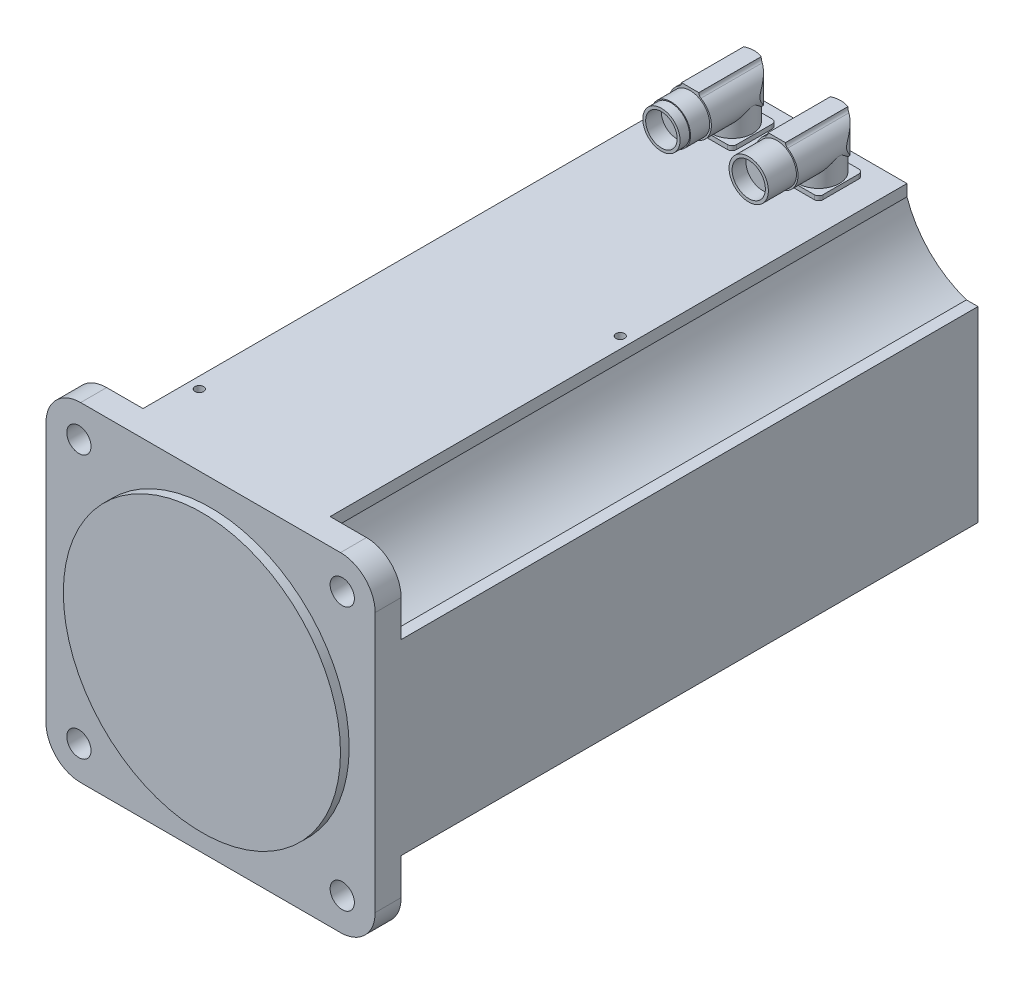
ISO-10303-21;
HEADER;
FILE_DESCRIPTION(('STEP AP214'),'2;1');
FILE_NAME('part.step','',(''),(''),'','','');
FILE_SCHEMA(('AUTOMOTIVE_DESIGN { 1 0 10303 214 1 1 1 1 }'));
ENDSEC;
DATA;
#1=APPLICATION_CONTEXT('core data for automotive mechanical design processes');
#2=APPLICATION_PROTOCOL_DEFINITION('international standard','automotive_design',2000,#1);
#3=PRODUCT_CONTEXT('',#1,'mechanical');
#4=PRODUCT('Part','Part','',(#3));
#5=PRODUCT_RELATED_PRODUCT_CATEGORY('part','',(#4));
#6=PRODUCT_DEFINITION_FORMATION('','',#4);
#7=PRODUCT_DEFINITION_CONTEXT('part definition',#1,'design');
#8=PRODUCT_DEFINITION('design','',#6,#7);
#9=PRODUCT_DEFINITION_SHAPE('','',#8);
#10=(LENGTH_UNIT() NAMED_UNIT(*) SI_UNIT(.MILLI.,.METRE.));
#11=(NAMED_UNIT(*) PLANE_ANGLE_UNIT() SI_UNIT($,.RADIAN.));
#12=(NAMED_UNIT(*) SI_UNIT($,.STERADIAN.) SOLID_ANGLE_UNIT());
#13=UNCERTAINTY_MEASURE_WITH_UNIT(LENGTH_MEASURE(1.E-05),#10,'distance_accuracy_value','');
#14=(GEOMETRIC_REPRESENTATION_CONTEXT(3) GLOBAL_UNCERTAINTY_ASSIGNED_CONTEXT((#13)) GLOBAL_UNIT_ASSIGNED_CONTEXT((#10,
#11,#12)) REPRESENTATION_CONTEXT('',''));
#15=CARTESIAN_POINT('',(0.,0.,0.));
#16=DIRECTION('',(0.,0.,1.));
#17=DIRECTION('',(1.,0.,0.));
#18=AXIS2_PLACEMENT_3D('',#15,#16,#17);
#19=CARTESIAN_POINT('',(106.065938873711,-106.06593887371,-15.));
#20=DIRECTION('',(0.,0.,1.));
#21=DIRECTION('',(-1.,0.,0.));
#22=AXIS2_PLACEMENT_3D('',#19,#20,#21);
#23=PLANE('',#22);
#24=DIRECTION('',(0.,1.,0.));
#25=VECTOR('',#24,1.);
#26=CARTESIAN_POINT('',(95.,-95.,-15.));
#27=LINE('',#26,#25);
#28=CARTESIAN_POINT('',(95.,-75.,-15.));
#29=VERTEX_POINT('',#28);
#30=CARTESIAN_POINT('',(95.,-53.9999999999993,-15.));
#31=VERTEX_POINT('',#30);
#32=EDGE_CURVE('E805',#29,#31,#27,.T.);
#33=ORIENTED_EDGE('',*,*,#32,.F.);
#34=CARTESIAN_POINT('',(75.,-75.,-15.));
#35=DIRECTION('',(0.,0.,1.));
#36=DIRECTION('',(1.,0.,0.));
#37=AXIS2_PLACEMENT_3D('',#34,#35,#36);
#38=CIRCLE('',#37,20.);
#39=CARTESIAN_POINT('',(75.,-95.,-15.));
#40=VERTEX_POINT('',#39);
#41=EDGE_CURVE('E682',#29,#40,#38,.F.);
#42=ORIENTED_EDGE('',*,*,#41,.T.);
#43=DIRECTION('',(1.,0.,0.));
#44=VECTOR('',#43,1.);
#45=CARTESIAN_POINT('',(54.0000000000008,-95.,-15.));
#46=LINE('',#45,#44);
#47=CARTESIAN_POINT('',(54.0000000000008,-95.,-15.));
#48=VERTEX_POINT('',#47);
#49=EDGE_CURVE('E807',#48,#40,#46,.T.);
#50=ORIENTED_EDGE('',*,*,#49,.F.);
#51=DIRECTION('',(0.,-1.,0.));
#52=VECTOR('',#51,1.);
#53=CARTESIAN_POINT('',(54.0000000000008,-95.,-15.));
#54=LINE('',#53,#52);
#55=CARTESIAN_POINT('',(54.0000000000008,-88.342,-15.));
#56=VERTEX_POINT('',#55);
#57=EDGE_CURVE('E791',#56,#48,#54,.T.);
#58=ORIENTED_EDGE('',*,*,#57,.F.);
#59=CARTESIAN_POINT('',(106.065938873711,-106.06593887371,-15.));
#60=DIRECTION('',(0.,0.,1.));
#61=DIRECTION('',(-1.,0.,0.));
#62=AXIS2_PLACEMENT_3D('',#59,#60,#61);
#63=CIRCLE('',#62,55.);
#64=CARTESIAN_POINT('',(88.342,-53.9999999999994,-15.));
#65=VERTEX_POINT('',#64);
#66=EDGE_CURVE('E799',#65,#56,#63,.T.);
#67=ORIENTED_EDGE('',*,*,#66,.F.);
#68=DIRECTION('',(-1.,0.,0.));
#69=VECTOR('',#68,1.);
#70=CARTESIAN_POINT('',(95.,-53.9999999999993,-15.));
#71=LINE('',#70,#69);
#72=EDGE_CURVE('E802',#31,#65,#71,.T.);
#73=ORIENTED_EDGE('',*,*,#72,.F.);
#74=EDGE_LOOP('',(#33,#42,#50,#58,#67,#73));
#75=FACE_BOUND('',#74,.T.);
#76=CARTESIAN_POINT('',(76.0139789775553,-76.0139789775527,-15.));
#77=DIRECTION('',(0.,0.,-1.));
#78=DIRECTION('',(-1.,0.,0.));
#79=AXIS2_PLACEMENT_3D('',#76,#77,#78);
#80=CIRCLE('',#79,7.);
#81=CARTESIAN_POINT('',(69.0139789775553,-76.0139789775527,-15.));
#82=VERTEX_POINT('',#81);
#83=EDGE_CURVE('E369',#82,#82,#80,.T.);
#84=ORIENTED_EDGE('',*,*,#83,.F.);
#85=EDGE_LOOP('',(#84));
#86=FACE_BOUND('',#85,.T.);
#87=ADVANCED_FACE('F16',(#75,#86),#23,.F.);
#88=CARTESIAN_POINT('',(-106.06593887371,-106.065938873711,-15.));
#89=DIRECTION('',(0.,0.,1.));
#90=DIRECTION('',(0.,1.,0.));
#91=AXIS2_PLACEMENT_3D('',#88,#89,#90);
#92=PLANE('',#91);
#93=DIRECTION('',(1.,0.,0.));
#94=VECTOR('',#93,1.);
#95=CARTESIAN_POINT('',(-95.,-95.,-15.));
#96=LINE('',#95,#94);
#97=CARTESIAN_POINT('',(-75.,-95.,-15.));
#98=VERTEX_POINT('',#97);
#99=CARTESIAN_POINT('',(-54.,-95.,-15.));
#100=VERTEX_POINT('',#99);
#101=EDGE_CURVE('E774',#98,#100,#96,.T.);
#102=ORIENTED_EDGE('',*,*,#101,.F.);
#103=CARTESIAN_POINT('',(-75.,-75.,-15.));
#104=DIRECTION('',(0.,0.,1.));
#105=DIRECTION('',(1.,0.,0.));
#106=AXIS2_PLACEMENT_3D('',#103,#104,#105);
#107=CIRCLE('',#106,20.);
#108=CARTESIAN_POINT('',(-95.,-75.,-15.));
#109=VERTEX_POINT('',#108);
#110=EDGE_CURVE('E24',#98,#109,#107,.F.);
#111=ORIENTED_EDGE('',*,*,#110,.T.);
#112=DIRECTION('',(0.,-1.,0.));
#113=VECTOR('',#112,1.);
#114=CARTESIAN_POINT('',(-95.,-54.,-15.));
#115=LINE('',#114,#113);
#116=CARTESIAN_POINT('',(-95.,-54.,-15.));
#117=VERTEX_POINT('',#116);
#118=EDGE_CURVE('E776',#117,#109,#115,.T.);
#119=ORIENTED_EDGE('',*,*,#118,.F.);
#120=DIRECTION('',(-1.,0.,0.));
#121=VECTOR('',#120,1.);
#122=CARTESIAN_POINT('',(-95.,-54.,-15.));
#123=LINE('',#122,#121);
#124=CARTESIAN_POINT('',(-88.342,-54.,-15.));
#125=VERTEX_POINT('',#124);
#126=EDGE_CURVE('E760',#125,#117,#123,.T.);
#127=ORIENTED_EDGE('',*,*,#126,.F.);
#128=CARTESIAN_POINT('',(-106.06593887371,-106.065938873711,-15.));
#129=DIRECTION('',(0.,0.,1.));
#130=DIRECTION('',(0.,1.,0.));
#131=AXIS2_PLACEMENT_3D('',#128,#129,#130);
#132=CIRCLE('',#131,55.);
#133=CARTESIAN_POINT('',(-54.,-88.342,-15.));
#134=VERTEX_POINT('',#133);
#135=EDGE_CURVE('E768',#134,#125,#132,.T.);
#136=ORIENTED_EDGE('',*,*,#135,.F.);
#137=DIRECTION('',(0.,1.,0.));
#138=VECTOR('',#137,1.);
#139=CARTESIAN_POINT('',(-54.,-95.,-15.));
#140=LINE('',#139,#138);
#141=EDGE_CURVE('E771',#100,#134,#140,.T.);
#142=ORIENTED_EDGE('',*,*,#141,.F.);
#143=EDGE_LOOP('',(#102,#111,#119,#127,#136,#142));
#144=FACE_BOUND('',#143,.T.);
#145=CARTESIAN_POINT('',(-76.0139789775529,-76.0139789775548,-15.));
#146=DIRECTION('',(0.,0.,-1.));
#147=DIRECTION('',(-1.,0.,0.));
#148=AXIS2_PLACEMENT_3D('',#145,#146,#147);
#149=CIRCLE('',#148,7.);
#150=CARTESIAN_POINT('',(-83.0139789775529,-76.0139789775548,-15.));
#151=VERTEX_POINT('',#150);
#152=EDGE_CURVE('E375',#151,#151,#149,.T.);
#153=ORIENTED_EDGE('',*,*,#152,.F.);
#154=EDGE_LOOP('',(#153));
#155=FACE_BOUND('',#154,.T.);
#156=ADVANCED_FACE('F565',(#144,#155),#92,.F.);
#157=CARTESIAN_POINT('',(-106.065938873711,106.065938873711,-15.));
#158=DIRECTION('',(0.,0.,1.));
#159=DIRECTION('',(1.,0.,0.));
#160=AXIS2_PLACEMENT_3D('',#157,#158,#159);
#161=PLANE('',#160);
#162=DIRECTION('',(0.,-1.,0.));
#163=VECTOR('',#162,1.);
#164=CARTESIAN_POINT('',(-95.,95.,-15.));
#165=LINE('',#164,#163);
#166=CARTESIAN_POINT('',(-95.,75.,-15.));
#167=VERTEX_POINT('',#166);
#168=CARTESIAN_POINT('',(-95.,54.,-15.));
#169=VERTEX_POINT('',#168);
#170=EDGE_CURVE('E744',#167,#169,#165,.T.);
#171=ORIENTED_EDGE('',*,*,#170,.F.);
#172=CARTESIAN_POINT('',(-75.,75.,-15.));
#173=DIRECTION('',(0.,0.,1.));
#174=DIRECTION('',(1.,0.,0.));
#175=AXIS2_PLACEMENT_3D('',#172,#173,#174);
#176=CIRCLE('',#175,20.);
#177=CARTESIAN_POINT('',(-75.,95.,-15.));
#178=VERTEX_POINT('',#177);
#179=EDGE_CURVE('E665',#167,#178,#176,.F.);
#180=ORIENTED_EDGE('',*,*,#179,.T.);
#181=DIRECTION('',(-1.,0.,0.));
#182=VECTOR('',#181,1.);
#183=CARTESIAN_POINT('',(-54.,95.,-15.));
#184=LINE('',#183,#182);
#185=CARTESIAN_POINT('',(-54.,95.,-15.));
#186=VERTEX_POINT('',#185);
#187=EDGE_CURVE('E746',#186,#178,#184,.T.);
#188=ORIENTED_EDGE('',*,*,#187,.F.);
#189=DIRECTION('',(0.,1.,0.));
#190=VECTOR('',#189,1.);
#191=CARTESIAN_POINT('',(-54.,95.,-15.));
#192=LINE('',#191,#190);
#193=CARTESIAN_POINT('',(-54.,88.342,-15.));
#194=VERTEX_POINT('',#193);
#195=EDGE_CURVE('E730',#194,#186,#192,.T.);
#196=ORIENTED_EDGE('',*,*,#195,.F.);
#197=CARTESIAN_POINT('',(-106.065938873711,106.065938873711,-15.));
#198=DIRECTION('',(0.,0.,1.));
#199=DIRECTION('',(1.,0.,0.));
#200=AXIS2_PLACEMENT_3D('',#197,#198,#199);
#201=CIRCLE('',#200,55.);
#202=CARTESIAN_POINT('',(-88.342,54.,-15.));
#203=VERTEX_POINT('',#202);
#204=EDGE_CURVE('E738',#203,#194,#201,.T.);
#205=ORIENTED_EDGE('',*,*,#204,.F.);
#206=DIRECTION('',(1.,0.,0.));
#207=VECTOR('',#206,1.);
#208=CARTESIAN_POINT('',(-95.,54.,-15.));
#209=LINE('',#208,#207);
#210=EDGE_CURVE('E741',#169,#203,#209,.T.);
#211=ORIENTED_EDGE('',*,*,#210,.F.);
#212=EDGE_LOOP('',(#171,#180,#188,#196,#205,#211));
#213=FACE_BOUND('',#212,.T.);
#214=CARTESIAN_POINT('',(-76.0139789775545,76.0139789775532,-15.));
#215=DIRECTION('',(0.,0.,-1.));
#216=DIRECTION('',(-1.,0.,0.));
#217=AXIS2_PLACEMENT_3D('',#214,#215,#216);
#218=CIRCLE('',#217,7.);
#219=CARTESIAN_POINT('',(-83.0139789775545,76.0139789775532,-15.));
#220=VERTEX_POINT('',#219);
#221=EDGE_CURVE('E381',#220,#220,#218,.T.);
#222=ORIENTED_EDGE('',*,*,#221,.F.);
#223=EDGE_LOOP('',(#222));
#224=FACE_BOUND('',#223,.T.);
#225=ADVANCED_FACE('F571',(#213,#224),#161,.F.);
#226=CARTESIAN_POINT('',(106.065938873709,106.065938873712,-15.));
#227=DIRECTION('',(0.,0.,1.));
#228=DIRECTION('',(0.,-1.,0.));
#229=AXIS2_PLACEMENT_3D('',#226,#227,#228);
#230=PLANE('',#229);
#231=DIRECTION('',(-1.,0.,0.));
#232=VECTOR('',#231,1.);
#233=CARTESIAN_POINT('',(94.999999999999,95.,-15.));
#234=LINE('',#233,#232);
#235=CARTESIAN_POINT('',(75.,95.,-15.));
#236=VERTEX_POINT('',#235);
#237=CARTESIAN_POINT('',(53.9999999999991,95.,-15.));
#238=VERTEX_POINT('',#237);
#239=EDGE_CURVE('E836',#236,#238,#234,.T.);
#240=ORIENTED_EDGE('',*,*,#239,.F.);
#241=CARTESIAN_POINT('',(75.,75.,-15.));
#242=DIRECTION('',(0.,0.,1.));
#243=DIRECTION('',(1.,0.,0.));
#244=AXIS2_PLACEMENT_3D('',#241,#242,#243);
#245=CIRCLE('',#244,20.);
#246=CARTESIAN_POINT('',(95.,75.,-15.));
#247=VERTEX_POINT('',#246);
#248=EDGE_CURVE('E677',#236,#247,#245,.F.);
#249=ORIENTED_EDGE('',*,*,#248,.T.);
#250=DIRECTION('',(0.,1.,0.));
#251=VECTOR('',#250,1.);
#252=CARTESIAN_POINT('',(95.,54.000000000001,-15.));
#253=LINE('',#252,#251);
#254=CARTESIAN_POINT('',(95.,54.000000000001,-15.));
#255=VERTEX_POINT('',#254);
#256=EDGE_CURVE('E838',#255,#247,#253,.T.);
#257=ORIENTED_EDGE('',*,*,#256,.F.);
#258=DIRECTION('',(1.,0.,0.));
#259=VECTOR('',#258,1.);
#260=CARTESIAN_POINT('',(95.,54.000000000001,-15.));
#261=LINE('',#260,#259);
#262=CARTESIAN_POINT('',(88.342,54.0000000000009,-15.));
#263=VERTEX_POINT('',#262);
#264=EDGE_CURVE('E822',#263,#255,#261,.T.);
#265=ORIENTED_EDGE('',*,*,#264,.F.);
#266=CARTESIAN_POINT('',(106.065938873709,106.065938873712,-15.));
#267=DIRECTION('',(0.,0.,1.));
#268=DIRECTION('',(0.,-1.,0.));
#269=AXIS2_PLACEMENT_3D('',#266,#267,#268);
#270=CIRCLE('',#269,55.);
#271=CARTESIAN_POINT('',(53.9999999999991,88.342,-15.));
#272=VERTEX_POINT('',#271);
#273=EDGE_CURVE('E830',#272,#263,#270,.T.);
#274=ORIENTED_EDGE('',*,*,#273,.F.);
#275=DIRECTION('',(0.,-1.,0.));
#276=VECTOR('',#275,1.);
#277=CARTESIAN_POINT('',(53.9999999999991,95.,-15.));
#278=LINE('',#277,#276);
#279=EDGE_CURVE('E833',#238,#272,#278,.T.);
#280=ORIENTED_EDGE('',*,*,#279,.F.);
#281=EDGE_LOOP('',(#240,#249,#257,#265,#274,#280));
#282=FACE_BOUND('',#281,.T.);
#283=CARTESIAN_POINT('',(76.0139789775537,76.0139789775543,-15.));
#284=DIRECTION('',(0.,0.,-1.));
#285=DIRECTION('',(-1.,0.,0.));
#286=AXIS2_PLACEMENT_3D('',#283,#284,#285);
#287=CIRCLE('',#286,7.);
#288=CARTESIAN_POINT('',(69.0139789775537,76.0139789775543,-15.));
#289=VERTEX_POINT('',#288);
#290=EDGE_CURVE('E387',#289,#289,#287,.T.);
#291=ORIENTED_EDGE('',*,*,#290,.F.);
#292=EDGE_LOOP('',(#291));
#293=FACE_BOUND('',#292,.T.);
#294=ADVANCED_FACE('F608',(#282,#293),#230,.F.);
#295=CARTESIAN_POINT('',(-95.,-95.,0.));
#296=DIRECTION('',(0.,0.,1.));
#297=DIRECTION('',(1.,0.,0.));
#298=AXIS2_PLACEMENT_3D('',#295,#296,#297);
#299=PLANE('',#298);
#300=CARTESIAN_POINT('',(76.0139789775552,-76.0139789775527,0.));
#301=DIRECTION('',(0.,0.,1.));
#302=DIRECTION('',(1.,0.,0.));
#303=AXIS2_PLACEMENT_3D('',#300,#301,#302);
#304=CIRCLE('',#303,7.);
#305=CARTESIAN_POINT('',(83.0139789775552,-76.0139789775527,0.));
#306=VERTEX_POINT('',#305);
#307=EDGE_CURVE('E372',#306,#306,#304,.T.);
#308=ORIENTED_EDGE('',*,*,#307,.F.);
#309=EDGE_LOOP('',(#308));
#310=FACE_BOUND('',#309,.T.);
#311=CARTESIAN_POINT('',(-76.0139789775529,-76.0139789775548,0.));
#312=DIRECTION('',(0.,0.,1.));
#313=DIRECTION('',(1.,0.,0.));
#314=AXIS2_PLACEMENT_3D('',#311,#312,#313);
#315=CIRCLE('',#314,7.);
#316=CARTESIAN_POINT('',(-69.0139789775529,-76.0139789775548,0.));
#317=VERTEX_POINT('',#316);
#318=EDGE_CURVE('E378',#317,#317,#315,.T.);
#319=ORIENTED_EDGE('',*,*,#318,.F.);
#320=EDGE_LOOP('',(#319));
#321=FACE_BOUND('',#320,.T.);
#322=CARTESIAN_POINT('',(-76.0139789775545,76.0139789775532,0.));
#323=DIRECTION('',(0.,0.,1.));
#324=DIRECTION('',(1.,0.,0.));
#325=AXIS2_PLACEMENT_3D('',#322,#323,#324);
#326=CIRCLE('',#325,7.);
#327=CARTESIAN_POINT('',(-69.0139789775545,76.0139789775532,0.));
#328=VERTEX_POINT('',#327);
#329=EDGE_CURVE('E384',#328,#328,#326,.T.);
#330=ORIENTED_EDGE('',*,*,#329,.F.);
#331=EDGE_LOOP('',(#330));
#332=FACE_BOUND('',#331,.T.);
#333=CARTESIAN_POINT('',(76.0139789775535,76.0139789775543,0.));
#334=DIRECTION('',(0.,0.,1.));
#335=DIRECTION('',(1.,0.,0.));
#336=AXIS2_PLACEMENT_3D('',#333,#334,#335);
#337=CIRCLE('',#336,7.);
#338=CARTESIAN_POINT('',(83.0139789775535,76.0139789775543,0.));
#339=VERTEX_POINT('',#338);
#340=EDGE_CURVE('E390',#339,#339,#337,.T.);
#341=ORIENTED_EDGE('',*,*,#340,.F.);
#342=EDGE_LOOP('',(#341));
#343=FACE_BOUND('',#342,.T.);
#344=DIRECTION('',(1.,0.,0.));
#345=VECTOR('',#344,1.);
#346=CARTESIAN_POINT('',(-95.,-95.,0.));
#347=LINE('',#346,#345);
#348=CARTESIAN_POINT('',(-75.,-95.,0.));
#349=VERTEX_POINT('',#348);
#350=CARTESIAN_POINT('',(75.,-95.,0.));
#351=VERTEX_POINT('',#350);
#352=EDGE_CURVE('E710',#349,#351,#347,.T.);
#353=ORIENTED_EDGE('',*,*,#352,.T.);
#354=CARTESIAN_POINT('',(75.,-75.,0.));
#355=DIRECTION('',(0.,0.,1.));
#356=DIRECTION('',(1.,0.,0.));
#357=AXIS2_PLACEMENT_3D('',#354,#355,#356);
#358=CIRCLE('',#357,20.);
#359=CARTESIAN_POINT('',(95.,-75.,0.));
#360=VERTEX_POINT('',#359);
#361=EDGE_CURVE('E689',#351,#360,#358,.T.);
#362=ORIENTED_EDGE('',*,*,#361,.T.);
#363=DIRECTION('',(0.,1.,0.));
#364=VECTOR('',#363,1.);
#365=CARTESIAN_POINT('',(95.,95.,0.));
#366=LINE('',#365,#364);
#367=CARTESIAN_POINT('',(95.,75.,0.));
#368=VERTEX_POINT('',#367);
#369=EDGE_CURVE('E707',#360,#368,#366,.T.);
#370=ORIENTED_EDGE('',*,*,#369,.T.);
#371=CARTESIAN_POINT('',(75.,75.,0.));
#372=DIRECTION('',(0.,0.,1.));
#373=DIRECTION('',(1.,0.,0.));
#374=AXIS2_PLACEMENT_3D('',#371,#372,#373);
#375=CIRCLE('',#374,20.);
#376=CARTESIAN_POINT('',(75.,95.,0.));
#377=VERTEX_POINT('',#376);
#378=EDGE_CURVE('E691',#368,#377,#375,.T.);
#379=ORIENTED_EDGE('',*,*,#378,.T.);
#380=DIRECTION('',(-1.,0.,0.));
#381=VECTOR('',#380,1.);
#382=CARTESIAN_POINT('',(-95.,95.,0.));
#383=LINE('',#382,#381);
#384=CARTESIAN_POINT('',(-75.,95.,0.));
#385=VERTEX_POINT('',#384);
#386=EDGE_CURVE('E703',#377,#385,#383,.T.);
#387=ORIENTED_EDGE('',*,*,#386,.T.);
#388=CARTESIAN_POINT('',(-75.,75.,0.));
#389=DIRECTION('',(0.,0.,1.));
#390=DIRECTION('',(1.,0.,0.));
#391=AXIS2_PLACEMENT_3D('',#388,#389,#390);
#392=CIRCLE('',#391,20.);
#393=CARTESIAN_POINT('',(-95.,75.,0.));
#394=VERTEX_POINT('',#393);
#395=EDGE_CURVE('E693',#385,#394,#392,.T.);
#396=ORIENTED_EDGE('',*,*,#395,.T.);
#397=DIRECTION('',(0.,-1.,0.));
#398=VECTOR('',#397,1.);
#399=CARTESIAN_POINT('',(-95.,95.,0.));
#400=LINE('',#399,#398);
#401=CARTESIAN_POINT('',(-95.,-75.,0.));
#402=VERTEX_POINT('',#401);
#403=EDGE_CURVE('E713',#394,#402,#400,.T.);
#404=ORIENTED_EDGE('',*,*,#403,.T.);
#405=CARTESIAN_POINT('',(-75.,-75.,0.));
#406=DIRECTION('',(0.,0.,1.));
#407=DIRECTION('',(1.,0.,0.));
#408=AXIS2_PLACEMENT_3D('',#405,#406,#407);
#409=CIRCLE('',#408,20.);
#410=EDGE_CURVE('E695',#402,#349,#409,.T.);
#411=ORIENTED_EDGE('',*,*,#410,.T.);
#412=EDGE_LOOP('',(#353,#362,#370,#379,#387,#396,#404,#411));
#413=FACE_BOUND('',#412,.T.);
#414=CARTESIAN_POINT('',(0.,0.,0.));
#415=DIRECTION('',(0.,0.,1.));
#416=DIRECTION('',(1.,0.,0.));
#417=AXIS2_PLACEMENT_3D('',#414,#415,#416);
#418=CIRCLE('',#417,80.);
#419=CARTESIAN_POINT('',(80.,0.,0.));
#420=VERTEX_POINT('',#419);
#421=EDGE_CURVE('E393',#420,#420,#418,.T.);
#422=ORIENTED_EDGE('',*,*,#421,.F.);
#423=EDGE_LOOP('',(#422));
#424=FACE_BOUND('',#423,.T.);
#425=ADVANCED_FACE('F626',(#310,#321,#332,#343,#413,#424),#299,.T.);
#426=CARTESIAN_POINT('',(-17.5,126.45088579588,-301.85));
#427=DIRECTION('',(0.,0.,1.));
#428=DIRECTION('',(1.,0.,0.));
#429=AXIS2_PLACEMENT_3D('',#426,#427,#428);
#430=PLANE('',#429);
#431=DIRECTION('',(0.,-1.,0.));
#432=VECTOR('',#431,1.);
#433=CARTESIAN_POINT('',(-20.,126.5,-301.85));
#434=LINE('',#433,#432);
#435=CARTESIAN_POINT('',(-20.,126.5,-301.85));
#436=VERTEX_POINT('',#435);
#437=CARTESIAN_POINT('',(-20.,126.45088579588,-301.85));
#438=VERTEX_POINT('',#437);
#439=EDGE_CURVE('E491',#436,#438,#434,.T.);
#440=ORIENTED_EDGE('',*,*,#439,.F.);
#441=DIRECTION('',(1.,0.,0.));
#442=VECTOR('',#441,1.);
#443=CARTESIAN_POINT('',(-20.,126.5,-301.85));
#444=LINE('',#443,#442);
#445=CARTESIAN_POINT('',(-30.,126.5,-301.85));
#446=VERTEX_POINT('',#445);
#447=EDGE_CURVE('E506',#446,#436,#444,.T.);
#448=ORIENTED_EDGE('',*,*,#447,.F.);
#449=DIRECTION('',(0.,1.,0.));
#450=VECTOR('',#449,1.);
#451=CARTESIAN_POINT('',(-30.,126.5,-301.85));
#452=LINE('',#451,#450);
#453=CARTESIAN_POINT('',(-30.,126.45088579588,-301.85));
#454=VERTEX_POINT('',#453);
#455=EDGE_CURVE('E503',#454,#446,#452,.T.);
#456=ORIENTED_EDGE('',*,*,#455,.F.);
#457=CARTESIAN_POINT('',(-32.5,126.45088579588,-301.85));
#458=DIRECTION('',(0.,0.,1.));
#459=DIRECTION('',(1.,0.,0.));
#460=AXIS2_PLACEMENT_3D('',#457,#458,#459);
#461=CIRCLE('',#460,2.5);
#462=CARTESIAN_POINT('',(-31.228813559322,124.298193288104,-301.85));
#463=VERTEX_POINT('',#462);
#464=EDGE_CURVE('E500',#463,#454,#461,.T.);
#465=ORIENTED_EDGE('',*,*,#464,.F.);
#466=CARTESIAN_POINT('',(-25.,113.75,-301.85));
#467=DIRECTION('',(0.,0.,-1.));
#468=DIRECTION('',(-1.,0.,0.));
#469=AXIS2_PLACEMENT_3D('',#466,#467,#468);
#470=CIRCLE('',#469,12.25);
#471=CARTESIAN_POINT('',(-18.771186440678,124.298193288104,-301.85));
#472=VERTEX_POINT('',#471);
#473=EDGE_CURVE('E497',#472,#463,#470,.T.);
#474=ORIENTED_EDGE('',*,*,#473,.F.);
#475=CARTESIAN_POINT('',(-17.5,126.45088579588,-301.85));
#476=DIRECTION('',(0.,0.,1.));
#477=DIRECTION('',(1.,0.,0.));
#478=AXIS2_PLACEMENT_3D('',#475,#476,#477);
#479=CIRCLE('',#478,2.5);
#480=EDGE_CURVE('E494',#438,#472,#479,.T.);
#481=ORIENTED_EDGE('',*,*,#480,.F.);
#482=EDGE_LOOP('',(#440,#448,#456,#465,#474,#481));
#483=FACE_BOUND('',#482,.T.);
#484=CARTESIAN_POINT('',(-25.,113.75,-301.85));
#485=DIRECTION('',(0.,0.,-1.));
#486=DIRECTION('',(-1.,0.,0.));
#487=AXIS2_PLACEMENT_3D('',#484,#485,#486);
#488=CIRCLE('',#487,11.3);
#489=CARTESIAN_POINT('',(-36.3,113.75,-301.85));
#490=VERTEX_POINT('',#489);
#491=EDGE_CURVE('E397',#490,#490,#488,.T.);
#492=ORIENTED_EDGE('',*,*,#491,.T.);
#493=EDGE_LOOP('',(#492));
#494=FACE_BOUND('',#493,.T.);
#495=ADVANCED_FACE('F629',(#483,#494),#430,.T.);
#496=CARTESIAN_POINT('',(32.5,126.45088579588,-301.85));
#497=DIRECTION('',(0.,0.,1.));
#498=DIRECTION('',(1.,0.,0.));
#499=AXIS2_PLACEMENT_3D('',#496,#497,#498);
#500=PLANE('',#499);
#501=DIRECTION('',(0.,-1.,0.));
#502=VECTOR('',#501,1.);
#503=CARTESIAN_POINT('',(30.,126.5,-301.85));
#504=LINE('',#503,#502);
#505=CARTESIAN_POINT('',(30.,126.5,-301.85));
#506=VERTEX_POINT('',#505);
#507=CARTESIAN_POINT('',(30.,126.45088579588,-301.85));
#508=VERTEX_POINT('',#507);
#509=EDGE_CURVE('E1001',#506,#508,#504,.T.);
#510=ORIENTED_EDGE('',*,*,#509,.F.);
#511=DIRECTION('',(1.,0.,0.));
#512=VECTOR('',#511,1.);
#513=CARTESIAN_POINT('',(30.,126.5,-301.85));
#514=LINE('',#513,#512);
#515=CARTESIAN_POINT('',(20.,126.5,-301.85));
#516=VERTEX_POINT('',#515);
#517=EDGE_CURVE('E1005',#516,#506,#514,.T.);
#518=ORIENTED_EDGE('',*,*,#517,.F.);
#519=DIRECTION('',(0.,1.,0.));
#520=VECTOR('',#519,1.);
#521=CARTESIAN_POINT('',(20.,126.5,-301.85));
#522=LINE('',#521,#520);
#523=CARTESIAN_POINT('',(20.,126.45088579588,-301.85));
#524=VERTEX_POINT('',#523);
#525=EDGE_CURVE('E1009',#524,#516,#522,.T.);
#526=ORIENTED_EDGE('',*,*,#525,.F.);
#527=CARTESIAN_POINT('',(17.5,126.45088579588,-301.85));
#528=DIRECTION('',(0.,0.,1.));
#529=DIRECTION('',(-1.,0.,0.));
#530=AXIS2_PLACEMENT_3D('',#527,#528,#529);
#531=CIRCLE('',#530,2.5);
#532=CARTESIAN_POINT('',(18.771186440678,124.298193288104,-301.85));
#533=VERTEX_POINT('',#532);
#534=EDGE_CURVE('E1013',#533,#524,#531,.T.);
#535=ORIENTED_EDGE('',*,*,#534,.F.);
#536=CARTESIAN_POINT('',(25.,113.75,-301.85));
#537=DIRECTION('',(0.,0.,-1.));
#538=DIRECTION('',(-1.,0.,0.));
#539=AXIS2_PLACEMENT_3D('',#536,#537,#538);
#540=CIRCLE('',#539,12.25);
#541=CARTESIAN_POINT('',(31.228813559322,124.298193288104,-301.85));
#542=VERTEX_POINT('',#541);
#543=EDGE_CURVE('E1029',#542,#533,#540,.T.);
#544=ORIENTED_EDGE('',*,*,#543,.F.);
#545=CARTESIAN_POINT('',(32.5,126.45088579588,-301.85));
#546=DIRECTION('',(0.,0.,1.));
#547=DIRECTION('',(1.,0.,0.));
#548=AXIS2_PLACEMENT_3D('',#545,#546,#547);
#549=CIRCLE('',#548,2.5);
#550=EDGE_CURVE('E1037',#508,#542,#549,.T.);
#551=ORIENTED_EDGE('',*,*,#550,.F.);
#552=EDGE_LOOP('',(#510,#518,#526,#535,#544,#551));
#553=FACE_BOUND('',#552,.T.);
#554=CARTESIAN_POINT('',(25.,113.75,-301.85));
#555=DIRECTION('',(0.,0.,-1.));
#556=DIRECTION('',(-1.,0.,0.));
#557=AXIS2_PLACEMENT_3D('',#554,#555,#556);
#558=CIRCLE('',#557,11.35);
#559=CARTESIAN_POINT('',(13.65,113.75,-301.85));
#560=VERTEX_POINT('',#559);
#561=EDGE_CURVE('E417',#560,#560,#558,.T.);
#562=ORIENTED_EDGE('',*,*,#561,.T.);
#563=EDGE_LOOP('',(#562));
#564=FACE_BOUND('',#563,.T.);
#565=ADVANCED_FACE('F982',(#553,#564),#500,.T.);
#566=CARTESIAN_POINT('',(25.,113.75,-301.85));
#567=DIRECTION('',(0.,0.,-1.));
#568=DIRECTION('',(-1.,0.,0.));
#569=AXIS2_PLACEMENT_3D('',#566,#567,#568);
#570=CYLINDRICAL_SURFACE('',#569,12.25);
#571=CARTESIAN_POINT('',(25.,101.499999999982,-338.));
#572=CARTESIAN_POINT('',(25.2697048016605,101.499998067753,-338.000001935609));
#573=CARTESIAN_POINT('',(25.5393871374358,101.508922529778,-337.990891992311));
#574=CARTESIAN_POINT('',(26.0764705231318,101.544421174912,-337.95465047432));
#575=CARTESIAN_POINT('',(26.3438706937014,101.571001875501,-337.927512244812));
#576=CARTESIAN_POINT('',(26.8743904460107,101.641289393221,-337.855733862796));
#577=CARTESIAN_POINT('',(27.1375036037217,101.685019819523,-337.811069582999));
#578=CARTESIAN_POINT('',(27.6570633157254,101.788700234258,-337.705140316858));
#579=CARTESIAN_POINT('',(27.9135103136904,101.84864914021,-337.643876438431));
#580=CARTESIAN_POINT('',(28.4163424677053,101.983166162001,-337.50634962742));
#581=CARTESIAN_POINT('',(28.6627852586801,102.05762955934,-337.430194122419));
#582=CARTESIAN_POINT('',(29.1462179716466,102.2201942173,-337.263846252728));
#583=CARTESIAN_POINT('',(29.3832079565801,102.308295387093,-337.173653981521));
#584=CARTESIAN_POINT('',(29.84679667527,102.496837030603,-336.980510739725));
#585=CARTESIAN_POINT('',(30.0733963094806,102.597276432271,-336.877560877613));
#586=CARTESIAN_POINT('',(30.5156409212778,102.80923379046,-336.660133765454));
#587=CARTESIAN_POINT('',(30.7312833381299,102.92075431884,-336.545653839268));
#588=CARTESIAN_POINT('',(31.2372067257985,103.201339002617,-336.257351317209));
#589=CARTESIAN_POINT('',(31.521900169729,103.375269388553,-336.078421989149));
#590=CARTESIAN_POINT('',(32.0683129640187,103.739537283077,-335.703036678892));
#591=CARTESIAN_POINT('',(32.3300241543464,103.929880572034,-335.506574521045));
#592=CARTESIAN_POINT('',(32.831114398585,104.324603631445,-335.098260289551));
#593=CARTESIAN_POINT('',(33.0704396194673,104.529015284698,-334.886373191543));
#594=CARTESIAN_POINT('',(33.5264520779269,104.948965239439,-334.449808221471));
#595=CARTESIAN_POINT('',(33.7431397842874,105.164503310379,-334.225130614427));
#596=CARTESIAN_POINT('',(34.2310703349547,105.686463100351,-333.678988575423));
#597=CARTESIAN_POINT('',(34.4926067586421,105.996856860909,-333.352621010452));
#598=CARTESIAN_POINT('',(34.975920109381,106.629459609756,-332.682209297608));
#599=CARTESIAN_POINT('',(35.1976749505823,106.951675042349,-332.338155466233));
#600=CARTESIAN_POINT('',(35.6025708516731,107.602291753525,-331.634721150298));
#601=CARTESIAN_POINT('',(35.7857714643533,107.930682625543,-331.275365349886));
#602=CARTESIAN_POINT('',(36.0327618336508,108.423231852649,-330.724253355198));
#603=CARTESIAN_POINT('',(36.1104436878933,108.587374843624,-330.538575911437));
#604=CARTESIAN_POINT('',(36.2566742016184,108.914523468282,-330.162690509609));
#605=CARTESIAN_POINT('',(36.3252241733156,109.07752926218,-329.972483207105));
#606=CARTESIAN_POINT('',(36.4309551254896,109.344478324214,-329.653874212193));
#607=CARTESIAN_POINT('',(36.470748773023,109.449227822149,-329.527007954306));
#608=CARTESIAN_POINT('',(36.5464678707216,109.656861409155,-329.27061942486));
#609=CARTESIAN_POINT('',(36.5823934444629,109.759745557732,-329.14109723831));
#610=CARTESIAN_POINT('',(36.6503772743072,109.962827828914,-328.878733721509));
#611=CARTESIAN_POINT('',(36.6824315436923,110.063023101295,-328.745889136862));
#612=CARTESIAN_POINT('',(36.7425401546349,110.25918469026,-328.476246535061));
#613=CARTESIAN_POINT('',(36.7705951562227,110.355151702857,-328.339449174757));
#614=CARTESIAN_POINT('',(36.8344092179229,110.583171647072,-327.997378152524));
#615=CARTESIAN_POINT('',(36.8678531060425,110.711740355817,-327.789307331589));
#616=CARTESIAN_POINT('',(36.9248628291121,110.943888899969,-327.358178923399));
#617=CARTESIAN_POINT('',(36.9484601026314,111.047547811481,-327.135171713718));
#618=CARTESIAN_POINT('',(36.9765885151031,111.175815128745,-326.762340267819));
#619=CARTESIAN_POINT('',(36.9849680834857,111.21548030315,-326.618201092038));
#620=CARTESIAN_POINT('',(36.9964771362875,111.270510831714,-326.325348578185));
#621=CARTESIAN_POINT('',(36.9996237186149,111.285955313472,-326.176651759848));
#622=CARTESIAN_POINT('',(37.0003134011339,111.289309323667,-325.878289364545));
#623=CARTESIAN_POINT('',(36.9978328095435,111.277102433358,-325.728622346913));
#624=CARTESIAN_POINT('',(36.9875370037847,111.2276964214,-325.433501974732));
#625=CARTESIAN_POINT('',(36.9797070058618,111.190428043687,-325.288061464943));
#626=CARTESIAN_POINT('',(36.9611359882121,111.105140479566,-325.027720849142));
#627=CARTESIAN_POINT('',(36.9511026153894,111.059969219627,-324.911786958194));
#628=CARTESIAN_POINT('',(36.9282019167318,110.960175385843,-324.684296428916));
#629=CARTESIAN_POINT('',(36.915332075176,110.905544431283,-324.572743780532));
#630=CARTESIAN_POINT('',(36.8869718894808,110.789257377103,-324.35311792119));
#631=CARTESIAN_POINT('',(36.8714700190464,110.727570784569,-324.245062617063));
#632=CARTESIAN_POINT('',(36.8380737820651,110.599299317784,-324.032366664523));
#633=CARTESIAN_POINT('',(36.8201802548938,110.532716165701,-323.927724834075));
#634=CARTESIAN_POINT('',(36.7668017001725,110.341012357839,-323.638148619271));
#635=CARTESIAN_POINT('',(36.7287453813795,110.211892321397,-323.45634532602));
#636=CARTESIAN_POINT('',(36.6455671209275,109.947023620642,-323.099252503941));
#637=CARTESIAN_POINT('',(36.6004411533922,109.81127120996,-322.923966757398));
#638=CARTESIAN_POINT('',(36.5031876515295,109.535671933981,-322.578161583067));
#639=CARTESIAN_POINT('',(36.4510489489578,109.395818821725,-322.40765029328));
#640=CARTESIAN_POINT('',(36.3398540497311,109.11392308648,-322.070731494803));
#641=CARTESIAN_POINT('',(36.2807969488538,108.9718801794,-321.904324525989));
#642=CARTESIAN_POINT('',(36.0930051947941,108.543771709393,-321.409803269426));
#643=CARTESIAN_POINT('',(35.9538024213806,108.256166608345,-321.08692634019));
#644=CARTESIAN_POINT('',(35.6471052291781,107.683089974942,-320.453590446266));
#645=CARTESIAN_POINT('',(35.4796370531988,107.397616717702,-320.143120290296));
#646=CARTESIAN_POINT('',(35.115583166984,106.832609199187,-319.534667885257));
#647=CARTESIAN_POINT('',(34.9190263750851,106.553069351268,-319.236673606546));
#648=CARTESIAN_POINT('',(34.4955673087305,106.00291672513,-318.653983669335));
#649=CARTESIAN_POINT('',(34.2686543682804,105.732307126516,-318.369292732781));
#650=CARTESIAN_POINT('',(33.7840106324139,105.204139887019,-317.816116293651));
#651=CARTESIAN_POINT('',(33.5263589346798,104.946551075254,-317.54759176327));
#652=CARTESIAN_POINT('',(32.9790661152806,104.447622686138,-317.029120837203));
#653=CARTESIAN_POINT('',(32.6894409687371,104.206275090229,-316.77916526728));
#654=CARTESIAN_POINT('',(31.9609297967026,103.656070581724,-316.210626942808));
#655=CARTESIAN_POINT('',(31.5070555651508,103.356261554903,-315.90190329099));
#656=CARTESIAN_POINT('',(30.7805948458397,102.946080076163,-315.480341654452));
#657=CARTESIAN_POINT('',(30.5308514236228,102.815949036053,-315.346749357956));
#658=CARTESIAN_POINT('',(30.0165217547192,102.570640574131,-315.095121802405));
#659=CARTESIAN_POINT('',(29.7519377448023,102.455460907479,-314.977084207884));
#660=CARTESIAN_POINT('',(29.2523570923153,102.259130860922,-314.776009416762));
#661=CARTESIAN_POINT('',(29.0193754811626,102.175483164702,-314.690392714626));
#662=CARTESIAN_POINT('',(28.5446324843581,102.021388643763,-314.532737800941));
#663=CARTESIAN_POINT('',(28.3028728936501,101.950939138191,-314.460696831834));
#664=CARTESIAN_POINT('',(27.8118663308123,101.824390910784,-314.331331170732));
#665=CARTESIAN_POINT('',(27.5626224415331,101.768286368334,-314.274000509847));
#666=CARTESIAN_POINT('',(27.0580917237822,101.671393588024,-314.175012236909));
#667=CARTESIAN_POINT('',(26.8028048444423,101.630605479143,-314.133354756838));
#668=CARTESIAN_POINT('',(26.2867772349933,101.564981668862,-314.066340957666));
#669=CARTESIAN_POINT('',(26.0260160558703,101.540224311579,-314.041064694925));
#670=CARTESIAN_POINT('',(25.5023414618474,101.507493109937,-314.007648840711));
#671=CARTESIAN_POINT('',(25.2394280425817,101.499519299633,-313.999509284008));
#672=CARTESIAN_POINT('',(24.7136953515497,101.500525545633,-314.000536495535));
#673=CARTESIAN_POINT('',(24.4508760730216,101.509503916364,-314.00970154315));
#674=CARTESIAN_POINT('',(23.9275219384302,101.544220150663,-314.045144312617));
#675=CARTESIAN_POINT('',(23.666986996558,101.569957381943,-314.071421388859));
#676=CARTESIAN_POINT('',(23.1703634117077,101.635021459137,-314.137865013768));
#677=CARTESIAN_POINT('',(22.9339476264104,101.673137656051,-314.176794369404));
#678=CARTESIAN_POINT('',(22.4662939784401,101.762527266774,-314.268116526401));
#679=CARTESIAN_POINT('',(22.2350556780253,101.81379956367,-314.320508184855));
#680=CARTESIAN_POINT('',(21.7789298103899,101.928725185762,-314.437985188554));
#681=CARTESIAN_POINT('',(21.5540436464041,101.992381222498,-314.503073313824));
#682=CARTESIAN_POINT('',(21.1116494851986,102.131178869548,-314.645057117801));
#683=CARTESIAN_POINT('',(20.8941429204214,102.206322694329,-314.721955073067));
#684=CARTESIAN_POINT('',(20.3967898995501,102.393725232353,-314.913836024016));
#685=CARTESIAN_POINT('',(20.1200780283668,102.510045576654,-315.033009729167));
#686=CARTESIAN_POINT('',(19.5823720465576,102.759109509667,-315.28841869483));
#687=CARTESIAN_POINT('',(19.3213821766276,102.891857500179,-315.424658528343));
#688=CARTESIAN_POINT('',(18.8155330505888,103.171789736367,-315.712282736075));
#689=CARTESIAN_POINT('',(18.5706946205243,103.318992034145,-315.863686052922));
#690=CARTESIAN_POINT('',(18.0978075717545,103.625688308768,-316.179581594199));
#691=CARTESIAN_POINT('',(17.8697595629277,103.78518273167,-316.344074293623));
#692=CARTESIAN_POINT('',(17.351362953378,104.173974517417,-316.745749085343));
#693=CARTESIAN_POINT('',(17.068115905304,104.407741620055,-316.987792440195));
#694=CARTESIAN_POINT('',(16.5320276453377,104.890755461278,-317.48951631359));
#695=CARTESIAN_POINT('',(16.2791990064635,105.140008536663,-317.74920405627));
#696=CARTESIAN_POINT('',(15.8026024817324,105.651066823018,-318.284012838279));
#697=CARTESIAN_POINT('',(15.5789016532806,105.912899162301,-318.559167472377));
#698=CARTESIAN_POINT('',(15.1602970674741,106.445385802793,-319.122259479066));
#699=CARTESIAN_POINT('',(14.9653855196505,106.716037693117,-319.410193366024));
#700=CARTESIAN_POINT('',(14.5973805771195,107.27213097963,-320.007294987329));
#701=CARTESIAN_POINT('',(14.4252111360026,107.557766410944,-320.316849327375));
#702=CARTESIAN_POINT('',(14.1094060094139,108.131757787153,-320.94828508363));
#703=CARTESIAN_POINT('',(13.9657920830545,108.420115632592,-321.270175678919));
#704=CARTESIAN_POINT('',(13.7716230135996,108.849924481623,-321.762725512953));
#705=CARTESIAN_POINT('',(13.7105141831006,108.992537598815,-321.928284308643));
#706=CARTESIAN_POINT('',(13.5952355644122,109.275940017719,-322.263322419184));
#707=CARTESIAN_POINT('',(13.5410649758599,109.416729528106,-322.432801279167));
#708=CARTESIAN_POINT('',(13.4397367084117,109.694795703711,-322.776285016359));
#709=CARTESIAN_POINT('',(13.3925698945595,109.832076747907,-322.950283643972));
#710=CARTESIAN_POINT('',(13.305275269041,110.100917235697,-323.30431994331));
#711=CARTESIAN_POINT('',(13.2651442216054,110.232479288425,-323.484354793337));
#712=CARTESIAN_POINT('',(13.2098833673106,110.424298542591,-323.763380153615));
#713=CARTESIAN_POINT('',(13.1920669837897,110.488195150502,-323.859333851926));
#714=CARTESIAN_POINT('',(13.1584455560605,110.612449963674,-324.053889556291));
#715=CARTESIAN_POINT('',(13.1426408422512,110.672807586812,-324.152491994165));
#716=CARTESIAN_POINT('',(13.11317298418,110.788680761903,-324.352708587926));
#717=CARTESIAN_POINT('',(13.0995076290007,110.84420128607,-324.454319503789));
#718=CARTESIAN_POINT('',(13.0744741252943,110.948710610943,-324.661091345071));
#719=CARTESIAN_POINT('',(13.0631050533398,110.997702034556,-324.766250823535));
#720=CARTESIAN_POINT('',(13.0394026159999,111.102288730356,-325.017618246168));
#721=CARTESIAN_POINT('',(13.0280901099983,111.154329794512,-325.165469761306));
#722=CARTESIAN_POINT('',(13.0108721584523,111.23502735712,-325.467536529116));
#723=CARTESIAN_POINT('',(13.0049484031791,111.263763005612,-325.621728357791));
#724=CARTESIAN_POINT('',(12.9991507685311,111.291872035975,-325.934713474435));
#725=CARTESIAN_POINT('',(12.9993402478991,111.290937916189,-326.093537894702));
#726=CARTESIAN_POINT('',(13.0059021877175,111.259152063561,-326.408069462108));
#727=CARTESIAN_POINT('',(13.012286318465,111.22824386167,-326.563770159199));
#728=CARTESIAN_POINT('',(13.0341987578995,111.125950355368,-326.930599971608));
#729=CARTESIAN_POINT('',(13.0524053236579,111.043156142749,-327.138238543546));
#730=CARTESIAN_POINT('',(13.086199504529,110.89932042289,-327.439323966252));
#731=CARTESIAN_POINT('',(13.0985918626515,110.84791752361,-327.538237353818));
#732=CARTESIAN_POINT('',(13.1253960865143,110.740124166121,-327.733039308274));
#733=CARTESIAN_POINT('',(13.1398074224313,110.683735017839,-327.828928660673));
#734=CARTESIAN_POINT('',(13.182250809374,110.522843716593,-328.09031599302));
#735=CARTESIAN_POINT('',(13.2122832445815,110.414470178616,-328.253079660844));
#736=CARTESIAN_POINT('',(13.2778823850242,110.190771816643,-328.572652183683));
#737=CARTESIAN_POINT('',(13.3134523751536,110.075442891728,-328.729457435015));
#738=CARTESIAN_POINT('',(13.3900188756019,109.840247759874,-329.038709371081));
#739=CARTESIAN_POINT('',(13.4310250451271,109.720373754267,-329.191147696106));
#740=CARTESIAN_POINT('',(13.5183471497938,109.477906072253,-329.492306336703));
#741=CARTESIAN_POINT('',(13.5646638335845,109.355312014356,-329.641026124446));
#742=CARTESIAN_POINT('',(13.7118417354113,108.984421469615,-330.08343473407));
#743=CARTESIAN_POINT('',(13.820707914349,108.733715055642,-330.372481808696));
#744=CARTESIAN_POINT('',(14.0598175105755,108.231635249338,-330.940350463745));
#745=CARTESIAN_POINT('',(14.1900398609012,107.980262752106,-331.21918179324));
#746=CARTESIAN_POINT('',(14.5089234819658,107.41513803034,-331.838494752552));
#747=CARTESIAN_POINT('',(14.7039922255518,107.102036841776,-332.176306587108));
#748=CARTESIAN_POINT('',(15.130286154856,106.484168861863,-332.836904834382));
#749=CARTESIAN_POINT('',(15.3615317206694,106.179406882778,-333.159682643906));
#750=CARTESIAN_POINT('',(15.8607430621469,105.583787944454,-333.786789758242));
#751=CARTESIAN_POINT('',(16.1285880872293,105.292889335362,-334.091175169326));
#752=CARTESIAN_POINT('',(16.7028685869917,104.728806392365,-334.679069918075));
#753=CARTESIAN_POINT('',(17.0092775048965,104.455610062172,-334.962593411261));
#754=CARTESIAN_POINT('',(17.5439835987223,104.02674024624,-335.40644724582));
#755=CARTESIAN_POINT('',(17.7605884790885,103.864221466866,-335.574324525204));
#756=CARTESIAN_POINT('',(18.2101283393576,103.55023115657,-335.898200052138));
#757=CARTESIAN_POINT('',(18.4430619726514,103.398758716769,-336.054199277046));
#758=CARTESIAN_POINT('',(18.9250036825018,103.108760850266,-336.352521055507));
#759=CARTESIAN_POINT('',(19.1740029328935,102.970228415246,-336.494851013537));
#760=CARTESIAN_POINT('',(19.6877289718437,102.708016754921,-336.764005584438));
#761=CARTESIAN_POINT('',(19.9524530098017,102.584334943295,-336.890832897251));
#762=CARTESIAN_POINT('',(20.4519983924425,102.372865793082,-337.107526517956));
#763=CARTESIAN_POINT('',(20.6845890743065,102.282519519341,-337.200042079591));
#764=CARTESIAN_POINT('',(21.1592666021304,102.114941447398,-337.371561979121));
#765=CARTESIAN_POINT('',(21.4013515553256,102.037707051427,-337.450568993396));
#766=CARTESIAN_POINT('',(21.8935069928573,101.897677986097,-337.593759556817));
#767=CARTESIAN_POINT('',(22.1435638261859,101.834859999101,-337.657967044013));
#768=CARTESIAN_POINT('',(22.6504540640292,101.724635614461,-337.770599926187));
#769=CARTESIAN_POINT('',(22.9072851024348,101.677223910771,-337.819030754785));
#770=CARTESIAN_POINT('',(23.4675525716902,101.592424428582,-337.905638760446));
#771=CARTESIAN_POINT('',(23.771872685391,101.557853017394,-337.940936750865));
#772=CARTESIAN_POINT('',(24.3841377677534,101.511639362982,-337.988118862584));
#773=CARTESIAN_POINT('',(24.6920835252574,101.500002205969,-337.999997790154));
#774=CARTESIAN_POINT('',(25.,101.499999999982,-338.));
#775=B_SPLINE_CURVE_WITH_KNOTS('',3,(#571,#572,#573,#574,#575,#576,#577,#578,#579,#580,#581,
#582,#583,#584,#585,#586,#587,#588,#589,#590,#591,#592,#593,#594,#595,#596,#597,#598,#599,#600,
#601,#602,#603,#604,#605,#606,#607,#608,#609,#610,#611,#612,#613,#614,#615,#616,#617,#618,#619,
#620,#621,#622,#623,#624,#625,#626,#627,#628,#629,#630,#631,#632,#633,#634,#635,#636,#637,#638,
#639,#640,#641,#642,#643,#644,#645,#646,#647,#648,#649,#650,#651,#652,#653,#654,#655,#656,#657,
#658,#659,#660,#661,#662,#663,#664,#665,#666,#667,#668,#669,#670,#671,#672,#673,#674,#675,#676,
#677,#678,#679,#680,#681,#682,#683,#684,#685,#686,#687,#688,#689,#690,#691,#692,#693,#694,#695,
#696,#697,#698,#699,#700,#701,#702,#703,#704,#705,#706,#707,#708,#709,#710,#711,#712,#713,#714,
#715,#716,#717,#718,#719,#720,#721,#722,#723,#724,#725,#726,#727,#728,#729,#730,#731,#732,#733,
#734,#735,#736,#737,#738,#739,#740,#741,#742,#743,#744,#745,#746,#747,#748,#749,#750,#751,#752,
#753,#754,#755,#756,#757,#758,#759,#760,#761,#762,#763,#764,#765,#766,#767,#768,#769,#770,#771,
#772,#773,#774),.UNSPECIFIED.,.T.,.F.,(4,2,2,2,2,2,2,2,2,2,2,2,2,2,2,2,2,2,2,2,2,2,2,2,2,2,2,2,
2,2,2,2,2,2,2,2,2,2,2,2,2,2,2,2,2,2,2,2,2,2,2,2,2,2,2,2,2,2,2,2,2,2,2,2,2,2,2,2,2,2,2,2,2,2,2,2,
2,2,2,2,2,2,2,2,2,2,2,2,2,2,2,2,2,2,2,2,2,2,2,2,2,4),(0.,0.808777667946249,1.61785404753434,
2.42804817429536,3.23818823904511,4.04268633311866,4.84717906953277,5.65160195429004,
6.45621197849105,7.59023786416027,8.72466478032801,9.86175313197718,10.9988179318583,
12.5590287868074,14.1201031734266,15.6787482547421,16.4577490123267,17.2366377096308,
17.7443747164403,18.2520954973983,18.7603347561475,19.2684900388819,20.0082099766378,
20.7455497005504,21.1930952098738,21.6391755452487,22.0871374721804,22.5363424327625,
22.9102755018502,23.2845415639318,23.6604910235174,24.0363088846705,24.7144728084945,
25.3930243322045,26.0726695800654,26.7524037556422,28.1140017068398,29.4743423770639,
30.8333396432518,32.192815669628,33.5488659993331,34.9042418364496,36.7729116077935,
37.7071205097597,38.6411889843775,39.4262201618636,40.2110917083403,40.9956442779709,
41.7802034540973,42.5685684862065,43.3569351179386,44.1452233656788,44.9334818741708,
45.6605217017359,46.3874998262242,47.1146373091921,47.8419151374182,48.8093761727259,
49.7770970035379,50.7460421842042,51.7150225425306,53.0325955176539,54.3507112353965,
55.6718097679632,56.9925501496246,58.3565583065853,59.7216018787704,60.4021814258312,
61.0826823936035,61.7622878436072,62.4415799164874,62.7914543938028,63.1413862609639,
63.4909540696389,63.8403810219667,64.3103773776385,64.7787707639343,65.2520202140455,
65.7261629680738,66.3949854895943,66.7314166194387,67.0677596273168,67.6608282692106,
68.254250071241,68.8487407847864,69.4433154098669,70.6359195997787,71.827354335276,
73.3264028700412,74.8262989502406,76.3213608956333,77.8153988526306,78.7705161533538,
79.7255547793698,80.68007311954,81.6344249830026,82.4320172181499,83.2294512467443,
84.0255862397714,84.8214467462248,85.7446070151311,86.6679719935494),.UNSPECIFIED.);
#776=CARTESIAN_POINT('',(25.,101.499999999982,-338.));
#777=VERTEX_POINT('',#776);
#778=EDGE_CURVE('E947',#777,#777,#775,.T.);
#779=ORIENTED_EDGE('',*,*,#778,.F.);
#780=EDGE_LOOP('',(#779));
#781=FACE_BOUND('',#780,.T.);
#782=DIRECTION('',(0.,0.,-1.));
#783=VECTOR('',#782,1.);
#784=CARTESIAN_POINT('',(18.771186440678,124.298193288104,-301.85));
#785=LINE('',#784,#783);
#786=CARTESIAN_POINT('',(18.7711864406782,124.298193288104,-337.239411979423));
#787=VERTEX_POINT('',#786);
#788=EDGE_CURVE('E1007',#533,#787,#785,.T.);
#789=ORIENTED_EDGE('',*,*,#788,.T.);
#790=CARTESIAN_POINT('',(31.228813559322,124.298193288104,-337.239411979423));
#791=CARTESIAN_POINT('',(31.5621490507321,124.101302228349,-337.054665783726));
#792=CARTESIAN_POINT('',(31.8811344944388,123.891685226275,-336.858523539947));
#793=CARTESIAN_POINT('',(32.4900024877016,123.450704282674,-336.447823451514));
#794=CARTESIAN_POINT('',(32.7799330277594,123.21937746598,-336.233297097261));
#795=CARTESIAN_POINT('',(33.330242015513,122.739015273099,-335.7904953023));
#796=CARTESIAN_POINT('',(33.5907401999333,122.4900588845,-335.562281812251));
#797=CARTESIAN_POINT('',(34.0843431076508,121.975831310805,-335.094658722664));
#798=CARTESIAN_POINT('',(34.317436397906,121.71055338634,-334.855244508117));
#799=CARTESIAN_POINT('',(34.7552680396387,121.167416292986,-334.370374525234));
#800=CARTESIAN_POINT('',(34.9601981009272,120.889661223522,-334.124974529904));
#801=CARTESIAN_POINT('',(35.3444155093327,120.320651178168,-333.629791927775));
#802=CARTESIAN_POINT('',(35.5237015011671,120.02939548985,-333.380009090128));
#803=CARTESIAN_POINT('',(35.8572800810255,119.433197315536,-332.879851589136));
#804=CARTESIAN_POINT('',(36.0115627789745,119.128249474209,-332.629476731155));
#805=CARTESIAN_POINT('',(36.2953466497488,118.503472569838,-332.133430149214));
#806=CARTESIAN_POINT('',(36.4248597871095,118.183650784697,-331.887756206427));
#807=CARTESIAN_POINT('',(36.5945392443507,117.70648519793,-331.541085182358));
#808=CARTESIAN_POINT('',(36.6446810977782,117.556480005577,-331.43480262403));
#809=CARTESIAN_POINT('',(36.7397927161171,117.252171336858,-331.226172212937));
#810=CARTESIAN_POINT('',(36.7847633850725,117.097868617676,-331.123823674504));
#811=CARTESIAN_POINT('',(36.869365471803,116.784308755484,-330.924668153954));
#812=CARTESIAN_POINT('',(36.9089979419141,116.625052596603,-330.827860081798));
#813=CARTESIAN_POINT('',(36.9826338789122,116.300804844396,-330.642088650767));
#814=CARTESIAN_POINT('',(37.0166388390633,116.135814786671,-330.553123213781));
#815=CARTESIAN_POINT('',(37.0912842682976,115.730305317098,-330.351891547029));
#816=CARTESIAN_POINT('',(37.1289549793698,115.486480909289,-330.24496653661));
#817=CARTESIAN_POINT('',(37.1902005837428,114.98482783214,-330.065789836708));
#818=CARTESIAN_POINT('',(37.2138200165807,114.727046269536,-329.993428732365));
#819=CARTESIAN_POINT('',(37.2416350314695,114.250525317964,-329.907252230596));
#820=CARTESIAN_POINT('',(37.2486462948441,114.033550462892,-329.884991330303));
#821=CARTESIAN_POINT('',(37.2509946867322,113.599083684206,-329.877585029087));
#822=CARTESIAN_POINT('',(37.2463423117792,113.381592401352,-329.892406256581));
#823=CARTESIAN_POINT('',(37.2233671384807,112.899326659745,-329.964013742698));
#824=CARTESIAN_POINT('',(37.2019511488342,112.636144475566,-330.030262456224));
#825=CARTESIAN_POINT('',(37.1587837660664,112.252222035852,-330.157940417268));
#826=CARTESIAN_POINT('',(37.1424935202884,112.125721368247,-330.205388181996));
#827=CARTESIAN_POINT('',(37.1065105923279,111.8763078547,-330.307883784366));
#828=CARTESIAN_POINT('',(37.0868180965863,111.753394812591,-330.362931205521));
#829=CARTESIAN_POINT('',(37.0384415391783,111.477763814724,-330.494953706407));
#830=CARTESIAN_POINT('',(37.008773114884,111.326125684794,-330.573800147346));
#831=CARTESIAN_POINT('',(36.9446811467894,111.027805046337,-330.738666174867));
#832=CARTESIAN_POINT('',(36.9102555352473,110.881124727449,-330.824688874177));
#833=CARTESIAN_POINT('',(36.8001331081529,110.447163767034,-331.090778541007));
#834=CARTESIAN_POINT('',(36.7176675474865,110.166388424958,-331.278649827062));
#835=CARTESIAN_POINT('',(36.5353536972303,109.616941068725,-331.666075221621));
#836=CARTESIAN_POINT('',(36.4354217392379,109.348335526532,-331.86568234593));
#837=CARTESIAN_POINT('',(36.2188134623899,108.822375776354,-332.270034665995));
#838=CARTESIAN_POINT('',(36.1021501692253,108.565013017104,-332.474775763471));
#839=CARTESIAN_POINT('',(35.7954651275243,107.945868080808,-332.978707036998));
#840=CARTESIAN_POINT('',(35.5961047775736,107.589407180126,-333.278802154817));
#841=CARTESIAN_POINT('',(35.1609305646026,106.895390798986,-333.874926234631));
#842=CARTESIAN_POINT('',(34.9250948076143,106.557846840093,-334.170952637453));
#843=CARTESIAN_POINT('',(34.4167933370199,105.904155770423,-334.751853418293));
#844=CARTESIAN_POINT('',(34.1444687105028,105.587932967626,-335.036765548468));
#845=CARTESIAN_POINT('',(33.5613699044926,104.978275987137,-335.590990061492));
#846=CARTESIAN_POINT('',(33.2506215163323,104.684826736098,-335.860312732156));
#847=CARTESIAN_POINT('',(32.7036728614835,104.221281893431,-336.288418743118));
#848=CARTESIAN_POINT('',(32.4786883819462,104.043527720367,-336.453309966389));
#849=CARTESIAN_POINT('',(32.0117221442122,103.701017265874,-336.772099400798));
#850=CARTESIAN_POINT('',(31.769745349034,103.536257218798,-336.926000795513));
#851=CARTESIAN_POINT('',(31.2690574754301,103.221524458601,-337.220773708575));
#852=CARTESIAN_POINT('',(31.0103573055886,103.071542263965,-337.361653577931));
#853=CARTESIAN_POINT('',(30.4765742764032,102.788208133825,-337.628353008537));
#854=CARTESIAN_POINT('',(30.2014940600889,102.654853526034,-337.754174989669));
#855=CARTESIAN_POINT('',(29.6837546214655,102.427863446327,-337.968694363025));
#856=CARTESIAN_POINT('',(29.4434764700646,102.331324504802,-338.06007188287));
#857=CARTESIAN_POINT('',(28.953170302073,102.152456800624,-338.229562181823));
#858=CARTESIAN_POINT('',(28.7031443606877,102.070125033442,-338.307677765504));
#859=CARTESIAN_POINT('',(28.1945971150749,101.9209157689,-338.449364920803));
#860=CARTESIAN_POINT('',(27.9360793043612,101.854032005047,-338.512942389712));
#861=CARTESIAN_POINT('',(27.4119838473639,101.7368019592,-338.624444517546));
#862=CARTESIAN_POINT('',(27.1464061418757,101.686455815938,-338.672369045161));
#863=CARTESIAN_POINT('',(26.6085745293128,101.603006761,-338.751834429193));
#864=CARTESIAN_POINT('',(26.336291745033,101.570001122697,-338.783282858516));
#865=CARTESIAN_POINT('',(25.7886669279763,101.522324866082,-338.828717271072));
#866=CARTESIAN_POINT('',(25.5133248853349,101.507654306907,-338.842703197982));
#867=CARTESIAN_POINT('',(24.9619922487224,101.496956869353,-338.852900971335));
#868=CARTESIAN_POINT('',(24.6860017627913,101.500927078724,-338.84911559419));
#869=CARTESIAN_POINT('',(24.1357414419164,101.527421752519,-338.823860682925));
#870=CARTESIAN_POINT('',(23.8614715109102,101.549945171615,-338.802392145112));
#871=CARTESIAN_POINT('',(23.341308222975,101.610248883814,-338.744939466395));
#872=CARTESIAN_POINT('',(23.0950697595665,101.646485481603,-338.710424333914));
#873=CARTESIAN_POINT('',(22.6075039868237,101.73335432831,-338.627731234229));
#874=CARTESIAN_POINT('',(22.366176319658,101.783985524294,-338.579554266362));
#875=CARTESIAN_POINT('',(21.8898026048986,101.898873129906,-338.470320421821));
#876=CARTESIAN_POINT('',(21.6547560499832,101.963128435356,-338.40926458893));
#877=CARTESIAN_POINT('',(21.1919584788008,102.104404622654,-338.275153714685));
#878=CARTESIAN_POINT('',(20.9642103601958,102.181430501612,-338.202093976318));
#879=CARTESIAN_POINT('',(20.5015528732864,102.353006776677,-338.039545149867));
#880=CARTESIAN_POINT('',(20.2672316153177,102.448399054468,-337.949270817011));
#881=CARTESIAN_POINT('',(19.8087684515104,102.651506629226,-337.757357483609));
#882=CARTESIAN_POINT('',(19.584630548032,102.759226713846,-337.655714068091));
#883=CARTESIAN_POINT('',(18.9283347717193,103.099181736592,-337.335523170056));
#884=CARTESIAN_POINT('',(18.5121363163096,103.348271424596,-337.101658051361));
#885=CARTESIAN_POINT('',(17.8103730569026,103.824734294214,-336.65670265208));
#886=CARTESIAN_POINT('',(17.5160371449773,104.045128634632,-336.451648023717));
#887=CARTESIAN_POINT('',(16.954771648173,104.505089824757,-336.026003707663));
#888=CARTESIAN_POINT('',(16.6878458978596,104.744659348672,-335.805411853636));
#889=CARTESIAN_POINT('',(16.1803489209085,105.241025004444,-335.351603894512));
#890=CARTESIAN_POINT('',(15.9398531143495,105.497867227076,-335.118354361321));
#891=CARTESIAN_POINT('',(15.4853939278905,106.026258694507,-334.643080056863));
#892=CARTESIAN_POINT('',(15.2714251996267,106.297804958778,-334.40105706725));
#893=CARTESIAN_POINT('',(14.8637618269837,106.862066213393,-333.904747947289));
#894=CARTESIAN_POINT('',(14.6707753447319,107.155155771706,-333.650307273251));
#895=CARTESIAN_POINT('',(14.3111720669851,107.755504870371,-333.139265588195));
#896=CARTESIAN_POINT('',(14.1445665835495,108.062770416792,-332.882663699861));
#897=CARTESIAN_POINT('',(13.8376324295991,108.691698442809,-332.372766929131));
#898=CARTESIAN_POINT('',(13.6972500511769,109.013329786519,-332.119466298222));
#899=CARTESIAN_POINT('',(13.5061798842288,109.509030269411,-331.747531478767));
#900=CARTESIAN_POINT('',(13.4457562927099,109.676418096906,-331.624926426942));
#901=CARTESIAN_POINT('',(13.3314813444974,110.016321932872,-331.383856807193));
#902=CARTESIAN_POINT('',(13.2776285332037,110.188836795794,-331.265391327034));
#903=CARTESIAN_POINT('',(13.1879704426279,110.500609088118,-331.060438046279));
#904=CARTESIAN_POINT('',(13.150822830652,110.638673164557,-330.972725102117));
#905=CARTESIAN_POINT('',(13.0807477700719,110.918956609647,-330.80233315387));
#906=CARTESIAN_POINT('',(13.0478206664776,111.061176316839,-330.719654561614));
#907=CARTESIAN_POINT('',(12.9864529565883,111.350212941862,-330.561183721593));
#908=CARTESIAN_POINT('',(12.9580080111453,111.497025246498,-330.485384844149));
#909=CARTESIAN_POINT('',(12.905924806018,111.795806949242,-330.342993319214));
#910=CARTESIAN_POINT('',(12.8822848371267,111.947774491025,-330.276397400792));
#911=CARTESIAN_POINT('',(12.8315993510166,112.321337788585,-330.130461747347));
#912=CARTESIAN_POINT('',(12.8071640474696,112.545822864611,-330.057177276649));
#913=CARTESIAN_POINT('',(12.7797324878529,112.889331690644,-329.973465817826));
#914=CARTESIAN_POINT('',(12.7721286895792,113.004840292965,-329.949942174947));
#915=CARTESIAN_POINT('',(12.7601686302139,113.237572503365,-329.912724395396));
#916=CARTESIAN_POINT('',(12.7558106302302,113.354795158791,-329.899024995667));
#917=CARTESIAN_POINT('',(12.7504551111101,113.591144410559,-329.882169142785));
#918=CARTESIAN_POINT('',(12.7494880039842,113.7102786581,-329.879108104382));
#919=CARTESIAN_POINT('',(12.7510250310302,113.948272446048,-329.883954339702));
#920=CARTESIAN_POINT('',(12.7535291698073,114.067131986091,-329.891861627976));
#921=CARTESIAN_POINT('',(12.7661693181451,114.422140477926,-329.931510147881));
#922=CARTESIAN_POINT('',(12.7814388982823,114.656450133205,-329.979195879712));
#923=CARTESIAN_POINT('',(12.8178198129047,115.047644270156,-330.088908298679));
#924=CARTESIAN_POINT('',(12.8359602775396,115.207306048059,-330.142786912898));
#925=CARTESIAN_POINT('',(12.8776765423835,115.521093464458,-330.263315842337));
#926=CARTESIAN_POINT('',(12.901255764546,115.675215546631,-330.329974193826));
#927=CARTESIAN_POINT('',(12.9534286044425,115.978545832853,-330.473078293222));
#928=CARTESIAN_POINT('',(12.9820393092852,116.127735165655,-330.549557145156));
#929=CARTESIAN_POINT('',(13.0438649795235,116.421297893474,-330.709640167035));
#930=CARTESIAN_POINT('',(13.0770818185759,116.565669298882,-330.793247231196));
#931=CARTESIAN_POINT('',(13.152627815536,116.869285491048,-330.977292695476));
#932=CARTESIAN_POINT('',(13.1955816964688,117.027916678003,-331.07848188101));
#933=CARTESIAN_POINT('',(13.2868508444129,117.340417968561,-331.285591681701));
#934=CARTESIAN_POINT('',(13.3351656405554,117.494288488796,-331.391511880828));
#935=CARTESIAN_POINT('',(13.4880514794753,117.950058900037,-331.714376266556));
#936=CARTESIAN_POINT('',(13.6004959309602,118.245848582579,-331.936254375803));
#937=CARTESIAN_POINT('',(13.8461386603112,118.8247161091,-332.38590897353));
#938=CARTESIAN_POINT('',(13.9793698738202,119.107772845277,-332.61369433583));
#939=CARTESIAN_POINT('',(14.2665591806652,119.662116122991,-333.070252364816));
#940=CARTESIAN_POINT('',(14.4205089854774,119.93340731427,-333.299024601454));
#941=CARTESIAN_POINT('',(14.7829999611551,120.518812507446,-333.800618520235));
#942=CARTESIAN_POINT('',(14.9962781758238,120.83043237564,-334.072949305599));
#943=CARTESIAN_POINT('',(15.4544778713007,121.437000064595,-334.609888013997));
#944=CARTESIAN_POINT('',(15.6994130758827,121.731940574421,-334.87449252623));
#945=CARTESIAN_POINT('',(16.2206929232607,122.301886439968,-335.390431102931));
#946=CARTESIAN_POINT('',(16.4968948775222,122.576973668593,-335.641818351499));
#947=CARTESIAN_POINT('',(17.0823461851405,123.105673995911,-336.128074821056));
#948=CARTESIAN_POINT('',(17.3915771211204,123.359298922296,-336.362953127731));
#949=CARTESIAN_POINT('',(17.8842953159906,123.723580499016,-336.701882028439));
#950=CARTESIAN_POINT('',(18.05551125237,123.843610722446,-336.813845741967));
#951=CARTESIAN_POINT('',(18.4067560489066,124.076472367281,-337.031515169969));
#952=CARTESIAN_POINT('',(18.5867895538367,124.189299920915,-337.137217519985));
#953=CARTESIAN_POINT('',(18.7711864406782,124.298193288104,-337.239411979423));
#954=B_SPLINE_CURVE_WITH_KNOTS('',3,(#790,#791,#792,#793,#794,#795,#796,#797,#798,#799,#800,
#801,#802,#803,#804,#805,#806,#807,#808,#809,#810,#811,#812,#813,#814,#815,#816,#817,#818,#819,
#820,#821,#822,#823,#824,#825,#826,#827,#828,#829,#830,#831,#832,#833,#834,#835,#836,#837,#838,
#839,#840,#841,#842,#843,#844,#845,#846,#847,#848,#849,#850,#851,#852,#853,#854,#855,#856,#857,
#858,#859,#860,#861,#862,#863,#864,#865,#866,#867,#868,#869,#870,#871,#872,#873,#874,#875,#876,
#877,#878,#879,#880,#881,#882,#883,#884,#885,#886,#887,#888,#889,#890,#891,#892,#893,#894,#895,
#896,#897,#898,#899,#900,#901,#902,#903,#904,#905,#906,#907,#908,#909,#910,#911,#912,#913,#914,
#915,#916,#917,#918,#919,#920,#921,#922,#923,#924,#925,#926,#927,#928,#929,#930,#931,#932,#933,
#934,#935,#936,#937,#938,#939,#940,#941,#942,#943,#944,#945,#946,#947,#948,#949,#950,#951,#952,
#953),.UNSPECIFIED.,.F.,.F.,(4,2,2,2,2,2,2,2,2,2,2,2,2,2,2,2,2,2,2,2,2,2,2,2,2,2,2,2,2,2,2,2,2,
2,2,2,2,2,2,2,2,2,2,2,2,2,2,2,2,2,2,2,2,2,2,2,2,2,2,2,2,2,2,2,2,2,2,2,2,2,2,2,2,2,2,2,2,2,2,2,2,
4),(0.,1.28573224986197,2.56930456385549,3.84745120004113,5.12612918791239,6.39561921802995,
7.66517631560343,8.93523436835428,10.2046773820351,10.7762258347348,11.3476742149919,
11.9190097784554,12.4901934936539,13.2948644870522,14.0969710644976,14.7483726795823,
15.3991882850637,16.2107801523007,16.6188416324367,17.0268807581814,17.5469238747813,
18.0671937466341,19.1091781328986,20.1562979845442,21.2026070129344,22.7213463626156,
24.2410008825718,25.7549405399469,27.2678694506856,28.2594001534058,29.2506424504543,
30.2412445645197,31.231687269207,32.0546854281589,32.8775093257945,33.6999988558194,
34.5224952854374,35.3495576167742,36.1766226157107,37.0035584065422,37.8304476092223,
38.5834251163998,39.3363475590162,40.0892090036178,40.8423657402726,41.647425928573,
42.452799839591,44.0630159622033,45.3245255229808,46.5862113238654,47.8514087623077,
49.1163506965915,50.4156357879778,51.7154765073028,53.0126250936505,53.6607929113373,
54.3088169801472,54.8118765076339,55.3149771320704,55.8175876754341,56.3200191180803,
57.0294697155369,57.383454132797,57.7372487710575,58.0942084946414,58.451168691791,
59.1658851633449,59.6736943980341,60.1818240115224,60.6917138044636,61.2018116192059,
61.7805676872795,62.3592729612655,63.5176568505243,64.6778951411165,65.837670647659,
67.2330101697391,68.628956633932,70.0187715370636,71.4078154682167,72.119063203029,
72.8306897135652),.UNSPECIFIED.);
#955=CARTESIAN_POINT('',(31.228813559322,124.298193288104,-337.239411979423));
#956=VERTEX_POINT('',#955);
#957=EDGE_CURVE('E429',#956,#787,#954,.T.);
#958=ORIENTED_EDGE('',*,*,#957,.F.);
#959=DIRECTION('',(0.,0.,-1.));
#960=VECTOR('',#959,1.);
#961=CARTESIAN_POINT('',(31.228813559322,124.298193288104,-301.85));
#962=LINE('',#961,#960);
#963=EDGE_CURVE('E1004',#542,#956,#962,.T.);
#964=ORIENTED_EDGE('',*,*,#963,.F.);
#965=ORIENTED_EDGE('',*,*,#543,.T.);
#966=EDGE_LOOP('',(#789,#958,#964,#965));
#967=FACE_BOUND('',#966,.T.);
#968=ADVANCED_FACE('F976',(#781,#967),#570,.T.);
#969=CARTESIAN_POINT('',(30.,126.5,-301.85));
#970=DIRECTION('',(1.,0.,0.));
#971=DIRECTION('',(0.,0.,-1.));
#972=AXIS2_PLACEMENT_3D('',#969,#970,#971);
#973=PLANE('',#972);
#974=DIRECTION('',(0.,0.,-1.));
#975=VECTOR('',#974,1.);
#976=CARTESIAN_POINT('',(30.,126.45088579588,-301.85));
#977=LINE('',#976,#975);
#978=CARTESIAN_POINT('',(30.,126.45088579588,-337.83733500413));
#979=VERTEX_POINT('',#978);
#980=EDGE_CURVE('E970',#508,#979,#977,.T.);
#981=ORIENTED_EDGE('',*,*,#980,.T.);
#982=DIRECTION('',(0.,-1.,0.));
#983=VECTOR('',#982,1.);
#984=CARTESIAN_POINT('',(30.,126.501,-337.83733500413));
#985=LINE('',#984,#983);
#986=CARTESIAN_POINT('',(30.,126.5,-337.83733500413));
#987=VERTEX_POINT('',#986);
#988=EDGE_CURVE('E31',#987,#979,#985,.T.);
#989=ORIENTED_EDGE('',*,*,#988,.F.);
#990=DIRECTION('',(0.,0.,-1.));
#991=VECTOR('',#990,1.);
#992=CARTESIAN_POINT('',(30.,126.5,-301.85));
#993=LINE('',#992,#991);
#994=EDGE_CURVE('E969',#506,#987,#993,.T.);
#995=ORIENTED_EDGE('',*,*,#994,.F.);
#996=ORIENTED_EDGE('',*,*,#509,.T.);
#997=EDGE_LOOP('',(#981,#989,#995,#996));
#998=FACE_BOUND('',#997,.T.);
#999=ADVANCED_FACE('F981',(#998),#973,.T.);
#1000=CARTESIAN_POINT('',(30.,126.5,-301.85));
#1001=DIRECTION('',(0.,1.,0.));
#1002=DIRECTION('',(0.,0.,1.));
#1003=AXIS2_PLACEMENT_3D('',#1000,#1001,#1002);
#1004=PLANE('',#1003);
#1005=ORIENTED_EDGE('',*,*,#994,.T.);
#1006=CARTESIAN_POINT('',(25.,126.5,-326.));
#1007=DIRECTION('',(0.,1.,0.));
#1008=DIRECTION('',(0.,0.,1.));
#1009=AXIS2_PLACEMENT_3D('',#1006,#1007,#1008);
#1010=CIRCLE('',#1009,12.85);
#1011=CARTESIAN_POINT('',(20.,126.5,-337.83733500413));
#1012=VERTEX_POINT('',#1011);
#1013=EDGE_CURVE('E459',#1012,#987,#1010,.F.);
#1014=ORIENTED_EDGE('',*,*,#1013,.F.);
#1015=DIRECTION('',(0.,0.,-1.));
#1016=VECTOR('',#1015,1.);
#1017=CARTESIAN_POINT('',(20.,126.5,-301.85));
#1018=LINE('',#1017,#1016);
#1019=EDGE_CURVE('E1018',#516,#1012,#1018,.T.);
#1020=ORIENTED_EDGE('',*,*,#1019,.F.);
#1021=ORIENTED_EDGE('',*,*,#517,.T.);
#1022=EDGE_LOOP('',(#1005,#1014,#1020,#1021));
#1023=FACE_BOUND('',#1022,.T.);
#1024=ADVANCED_FACE('F989',(#1023),#1004,.T.);
#1025=CARTESIAN_POINT('',(20.,126.5,-301.85));
#1026=DIRECTION('',(-1.,0.,0.));
#1027=DIRECTION('',(0.,0.,1.));
#1028=AXIS2_PLACEMENT_3D('',#1025,#1026,#1027);
#1029=PLANE('',#1028);
#1030=ORIENTED_EDGE('',*,*,#1019,.T.);
#1031=DIRECTION('',(0.,-1.,0.));
#1032=VECTOR('',#1031,1.);
#1033=CARTESIAN_POINT('',(20.,126.501,-337.83733500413));
#1034=LINE('',#1033,#1032);
#1035=CARTESIAN_POINT('',(20.,126.45088579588,-337.83733500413));
#1036=VERTEX_POINT('',#1035);
#1037=EDGE_CURVE('E457',#1036,#1012,#1034,.F.);
#1038=ORIENTED_EDGE('',*,*,#1037,.F.);
#1039=DIRECTION('',(0.,0.,-1.));
#1040=VECTOR('',#1039,1.);
#1041=CARTESIAN_POINT('',(20.,126.45088579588,-301.85));
#1042=LINE('',#1041,#1040);
#1043=EDGE_CURVE('E1021',#524,#1036,#1042,.T.);
#1044=ORIENTED_EDGE('',*,*,#1043,.F.);
#1045=ORIENTED_EDGE('',*,*,#525,.T.);
#1046=EDGE_LOOP('',(#1030,#1038,#1044,#1045));
#1047=FACE_BOUND('',#1046,.T.);
#1048=ADVANCED_FACE('F994',(#1047),#1029,.T.);
#1049=CARTESIAN_POINT('',(17.5,126.45088579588,-301.85));
#1050=DIRECTION('',(0.,0.,-1.));
#1051=DIRECTION('',(-1.,0.,0.));
#1052=AXIS2_PLACEMENT_3D('',#1049,#1050,#1051);
#1053=CYLINDRICAL_SURFACE('',#1052,2.5);
#1054=ORIENTED_EDGE('',*,*,#1043,.T.);
#1055=CARTESIAN_POINT('',(18.7711864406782,124.298193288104,-337.239411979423));
#1056=CARTESIAN_POINT('',(18.8273452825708,124.331347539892,-337.270539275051));
#1057=CARTESIAN_POINT('',(18.8826377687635,124.366970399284,-337.300627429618));
#1058=CARTESIAN_POINT('',(18.991012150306,124.443085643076,-337.358623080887));
#1059=CARTESIAN_POINT('',(19.0440929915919,124.483580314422,-337.38652954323));
#1060=CARTESIAN_POINT('',(19.1476192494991,124.569428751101,-337.440085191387));
#1061=CARTESIAN_POINT('',(19.1980589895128,124.614792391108,-337.465729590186));
#1062=CARTESIAN_POINT('',(19.2956383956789,124.710098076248,-337.514588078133));
#1063=CARTESIAN_POINT('',(19.3427786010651,124.760039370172,-337.537802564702));
#1064=CARTESIAN_POINT('',(19.4787615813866,124.916737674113,-337.603817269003));
#1065=CARTESIAN_POINT('',(19.5619361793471,125.030180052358,-337.642871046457));
#1066=CARTESIAN_POINT('',(19.708923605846,125.27163832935,-337.710406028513));
#1067=CARTESIAN_POINT('',(19.7727541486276,125.39964074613,-337.738896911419));
#1068=CARTESIAN_POINT('',(19.8747592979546,125.658033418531,-337.783773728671));
#1069=CARTESIAN_POINT('',(19.9142797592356,125.787783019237,-337.800800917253));
#1070=CARTESIAN_POINT('',(19.9717883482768,126.052697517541,-337.825421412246));
#1071=CARTESIAN_POINT('',(19.989821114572,126.187850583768,-337.833034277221));
#1072=CARTESIAN_POINT('',(19.9978336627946,126.344659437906,-337.836419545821));
#1073=CARTESIAN_POINT('',(19.9986463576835,126.365908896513,-337.836763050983));
#1074=CARTESIAN_POINT('',(19.999728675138,126.408398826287,-337.837220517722));
#1075=CARTESIAN_POINT('',(19.9999989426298,126.429639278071,-337.837334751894));
#1076=CARTESIAN_POINT('',(20.,126.45088579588,-337.83733500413));
#1077=B_SPLINE_CURVE_WITH_KNOTS('',3,(#1055,#1056,#1057,#1058,#1059,#1060,#1061,#1062,#1063,
#1064,#1065,#1066,#1067,#1068,#1069,#1070,#1071,#1072,#1073,#1074,#1075,#1076),.UNSPECIFIED.,
.F.,.F.,(4,2,2,2,2,2,2,2,2,2,4),(0.,0.21675063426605,0.433603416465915,0.650904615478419,
0.868170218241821,1.3036503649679,1.73873050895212,2.14682216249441,2.55406456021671,
2.61786585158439,2.68159124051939),.UNSPECIFIED.);
#1078=EDGE_CURVE('E452',#787,#1036,#1077,.T.);
#1079=ORIENTED_EDGE('',*,*,#1078,.F.);
#1080=ORIENTED_EDGE('',*,*,#788,.F.);
#1081=ORIENTED_EDGE('',*,*,#534,.T.);
#1082=EDGE_LOOP('',(#1054,#1079,#1080,#1081));
#1083=FACE_BOUND('',#1082,.T.);
#1084=ADVANCED_FACE('F984',(#1083),#1053,.F.);
#1085=CARTESIAN_POINT('',(32.5,126.45088579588,-301.85));
#1086=DIRECTION('',(0.,0.,-1.));
#1087=DIRECTION('',(-1.,0.,0.));
#1088=AXIS2_PLACEMENT_3D('',#1085,#1086,#1087);
#1089=CYLINDRICAL_SURFACE('',#1088,2.5);
#1090=ORIENTED_EDGE('',*,*,#963,.T.);
#1091=CARTESIAN_POINT('',(30.,126.45088579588,-337.83733500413));
#1092=CARTESIAN_POINT('',(29.9999909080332,126.385200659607,-337.837334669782));
#1093=CARTESIAN_POINT('',(30.0025885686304,126.319519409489,-337.836241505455));
#1094=CARTESIAN_POINT('',(30.0129281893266,126.188644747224,-337.831868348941));
#1095=CARTESIAN_POINT('',(30.0206694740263,126.123451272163,-337.828588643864));
#1096=CARTESIAN_POINT('',(30.0412051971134,125.994153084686,-337.81985058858));
#1097=CARTESIAN_POINT('',(30.053988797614,125.930046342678,-337.814396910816));
#1098=CARTESIAN_POINT('',(30.0844604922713,125.80325415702,-337.8013149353));
#1099=CARTESIAN_POINT('',(30.1021485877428,125.74056871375,-337.793686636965));
#1100=CARTESIAN_POINT('',(30.1623217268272,125.5553001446,-337.767534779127));
#1101=CARTESIAN_POINT('',(30.2119336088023,125.435393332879,-337.745736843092));
#1102=CARTESIAN_POINT('',(30.3280710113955,125.206192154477,-337.693510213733));
#1103=CARTESIAN_POINT('',(30.3946005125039,125.096900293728,-337.663079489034));
#1104=CARTESIAN_POINT('',(30.5433999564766,124.889366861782,-337.593105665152));
#1105=CARTESIAN_POINT('',(30.6259579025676,124.791389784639,-337.553392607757));
#1106=CARTESIAN_POINT('',(30.8027314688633,124.610990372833,-337.465622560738));
#1107=CARTESIAN_POINT('',(30.8969423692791,124.528561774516,-337.417568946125));
#1108=CARTESIAN_POINT('',(31.0331013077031,124.425924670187,-337.345749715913));
#1109=CARTESIAN_POINT('',(31.0715731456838,124.398618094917,-337.325213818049));
#1110=CARTESIAN_POINT('',(31.1494855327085,124.346534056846,-337.283097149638));
#1111=CARTESIAN_POINT('',(31.1889236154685,124.321750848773,-337.261518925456));
#1112=CARTESIAN_POINT('',(31.2288135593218,124.298193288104,-337.239411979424));
#1113=B_SPLINE_CURVE_WITH_KNOTS('',3,(#1091,#1092,#1093,#1094,#1095,#1096,#1097,#1098,#1099,
#1100,#1101,#1102,#1103,#1104,#1105,#1106,#1107,#1108,#1109,#1110,#1111,#1112),.UNSPECIFIED.,
.F.,.F.,(4,2,2,2,2,2,2,2,2,2,4),(0.,0.196988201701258,0.393950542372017,0.590491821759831,
0.787033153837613,1.17978072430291,1.572620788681,1.97331183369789,2.37384111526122,
2.52813972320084,2.68207877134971),.UNSPECIFIED.);
#1114=EDGE_CURVE('E436',#979,#956,#1113,.T.);
#1115=ORIENTED_EDGE('',*,*,#1114,.F.);
#1116=ORIENTED_EDGE('',*,*,#980,.F.);
#1117=ORIENTED_EDGE('',*,*,#550,.T.);
#1118=EDGE_LOOP('',(#1090,#1115,#1116,#1117));
#1119=FACE_BOUND('',#1118,.T.);
#1120=ADVANCED_FACE('F546',(#1119),#1089,.F.);
#1121=CARTESIAN_POINT('',(-25.,113.75,-301.85));
#1122=DIRECTION('',(0.,0.,-1.));
#1123=DIRECTION('',(-1.,0.,0.));
#1124=AXIS2_PLACEMENT_3D('',#1121,#1122,#1123);
#1125=CYLINDRICAL_SURFACE('',#1124,12.25);
#1126=CARTESIAN_POINT('',(-25.,101.499999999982,-338.));
#1127=CARTESIAN_POINT('',(-24.7302951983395,101.499998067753,-338.000001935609));
#1128=CARTESIAN_POINT('',(-24.4606128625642,101.508922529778,-337.990891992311));
#1129=CARTESIAN_POINT('',(-23.9235294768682,101.544421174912,-337.95465047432));
#1130=CARTESIAN_POINT('',(-23.6561293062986,101.571001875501,-337.927512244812));
#1131=CARTESIAN_POINT('',(-23.1256095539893,101.641289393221,-337.855733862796));
#1132=CARTESIAN_POINT('',(-22.8624963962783,101.685019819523,-337.811069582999));
#1133=CARTESIAN_POINT('',(-22.3429366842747,101.788700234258,-337.705140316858));
#1134=CARTESIAN_POINT('',(-22.0864896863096,101.84864914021,-337.643876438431));
#1135=CARTESIAN_POINT('',(-21.5836575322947,101.983166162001,-337.50634962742));
#1136=CARTESIAN_POINT('',(-21.3372147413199,102.05762955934,-337.430194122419));
#1137=CARTESIAN_POINT('',(-20.8537820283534,102.2201942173,-337.263846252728));
#1138=CARTESIAN_POINT('',(-20.6167920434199,102.308295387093,-337.173653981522));
#1139=CARTESIAN_POINT('',(-20.1532033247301,102.496837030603,-336.980510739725));
#1140=CARTESIAN_POINT('',(-19.9266036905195,102.597276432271,-336.877560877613));
#1141=CARTESIAN_POINT('',(-19.4843590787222,102.80923379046,-336.660133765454));
#1142=CARTESIAN_POINT('',(-19.2687166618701,102.92075431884,-336.545653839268));
#1143=CARTESIAN_POINT('',(-18.7627932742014,103.201339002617,-336.25735131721));
#1144=CARTESIAN_POINT('',(-18.4780998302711,103.375269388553,-336.078421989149));
#1145=CARTESIAN_POINT('',(-17.9316870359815,103.739537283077,-335.703036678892));
#1146=CARTESIAN_POINT('',(-17.6699758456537,103.929880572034,-335.506574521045));
#1147=CARTESIAN_POINT('',(-17.168885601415,104.324603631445,-335.098260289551));
#1148=CARTESIAN_POINT('',(-16.9295603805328,104.529015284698,-334.886373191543));
#1149=CARTESIAN_POINT('',(-16.4735479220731,104.948965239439,-334.449808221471));
#1150=CARTESIAN_POINT('',(-16.2568602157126,105.164503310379,-334.225130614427));
#1151=CARTESIAN_POINT('',(-15.7689296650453,105.686463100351,-333.678988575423));
#1152=CARTESIAN_POINT('',(-15.5073932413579,105.996856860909,-333.352621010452));
#1153=CARTESIAN_POINT('',(-15.024079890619,106.629459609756,-332.682209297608));
#1154=CARTESIAN_POINT('',(-14.8023250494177,106.951675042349,-332.338155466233));
#1155=CARTESIAN_POINT('',(-14.3974291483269,107.602291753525,-331.634721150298));
#1156=CARTESIAN_POINT('',(-14.2142285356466,107.930682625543,-331.275365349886));
#1157=CARTESIAN_POINT('',(-13.9672381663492,108.423231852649,-330.724253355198));
#1158=CARTESIAN_POINT('',(-13.8895563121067,108.587374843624,-330.538575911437));
#1159=CARTESIAN_POINT('',(-13.7433257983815,108.914523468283,-330.162690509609));
#1160=CARTESIAN_POINT('',(-13.6747758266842,109.07752926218,-329.972483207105));
#1161=CARTESIAN_POINT('',(-13.5690448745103,109.344478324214,-329.653874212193));
#1162=CARTESIAN_POINT('',(-13.5292512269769,109.449227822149,-329.527007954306));
#1163=CARTESIAN_POINT('',(-13.4535321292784,109.656861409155,-329.27061942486));
#1164=CARTESIAN_POINT('',(-13.4176065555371,109.759745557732,-329.14109723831));
#1165=CARTESIAN_POINT('',(-13.3496227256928,109.962827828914,-328.878733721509));
#1166=CARTESIAN_POINT('',(-13.3175684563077,110.063023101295,-328.745889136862));
#1167=CARTESIAN_POINT('',(-13.2574598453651,110.25918469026,-328.476246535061));
#1168=CARTESIAN_POINT('',(-13.2294048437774,110.355151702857,-328.339449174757));
#1169=CARTESIAN_POINT('',(-13.1655907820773,110.583171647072,-327.997378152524));
#1170=CARTESIAN_POINT('',(-13.1321468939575,110.711740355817,-327.789307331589));
#1171=CARTESIAN_POINT('',(-13.0751371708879,110.943888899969,-327.358178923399));
#1172=CARTESIAN_POINT('',(-13.0515398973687,111.047547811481,-327.135171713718));
#1173=CARTESIAN_POINT('',(-13.023411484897,111.175815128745,-326.762340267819));
#1174=CARTESIAN_POINT('',(-13.0150319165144,111.21548030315,-326.618201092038));
#1175=CARTESIAN_POINT('',(-13.0035228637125,111.270510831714,-326.325348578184));
#1176=CARTESIAN_POINT('',(-13.0003762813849,111.285955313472,-326.176651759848));
#1177=CARTESIAN_POINT('',(-12.9996865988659,111.289309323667,-325.878289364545));
#1178=CARTESIAN_POINT('',(-13.0021671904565,111.277102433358,-325.728622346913));
#1179=CARTESIAN_POINT('',(-13.0124629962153,111.2276964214,-325.433501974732));
#1180=CARTESIAN_POINT('',(-13.0202929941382,111.190428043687,-325.288061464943));
#1181=CARTESIAN_POINT('',(-13.0388640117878,111.105140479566,-325.027720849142));
#1182=CARTESIAN_POINT('',(-13.0488973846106,111.059969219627,-324.911786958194));
#1183=CARTESIAN_POINT('',(-13.0717980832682,110.960175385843,-324.684296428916));
#1184=CARTESIAN_POINT('',(-13.084667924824,110.905544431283,-324.572743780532));
#1185=CARTESIAN_POINT('',(-13.1130281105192,110.789257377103,-324.35311792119));
#1186=CARTESIAN_POINT('',(-13.1285299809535,110.727570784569,-324.245062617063));
#1187=CARTESIAN_POINT('',(-13.1619262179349,110.599299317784,-324.032366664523));
#1188=CARTESIAN_POINT('',(-13.1798197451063,110.532716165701,-323.927724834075));
#1189=CARTESIAN_POINT('',(-13.2331982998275,110.341012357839,-323.638148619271));
#1190=CARTESIAN_POINT('',(-13.2712546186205,110.211892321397,-323.456345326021));
#1191=CARTESIAN_POINT('',(-13.3544328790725,109.947023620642,-323.099252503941));
#1192=CARTESIAN_POINT('',(-13.3995588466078,109.81127120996,-322.923966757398));
#1193=CARTESIAN_POINT('',(-13.4968123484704,109.535671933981,-322.578161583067));
#1194=CARTESIAN_POINT('',(-13.5489510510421,109.395818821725,-322.407650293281));
#1195=CARTESIAN_POINT('',(-13.6601459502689,109.11392308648,-322.070731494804));
#1196=CARTESIAN_POINT('',(-13.7192030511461,108.9718801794,-321.904324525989));
#1197=CARTESIAN_POINT('',(-13.9069948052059,108.543771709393,-321.409803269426));
#1198=CARTESIAN_POINT('',(-14.0461975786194,108.256166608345,-321.08692634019));
#1199=CARTESIAN_POINT('',(-14.3528947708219,107.683089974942,-320.453590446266));
#1200=CARTESIAN_POINT('',(-14.5203629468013,107.397616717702,-320.143120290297));
#1201=CARTESIAN_POINT('',(-14.8844168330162,106.832609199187,-319.534667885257));
#1202=CARTESIAN_POINT('',(-15.0809736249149,106.553069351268,-319.236673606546));
#1203=CARTESIAN_POINT('',(-15.5044326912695,106.00291672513,-318.653983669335));
#1204=CARTESIAN_POINT('',(-15.7313456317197,105.732307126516,-318.369292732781));
#1205=CARTESIAN_POINT('',(-16.2159893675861,105.204139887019,-317.816116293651));
#1206=CARTESIAN_POINT('',(-16.4736410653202,104.946551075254,-317.54759176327));
#1207=CARTESIAN_POINT('',(-17.0209338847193,104.447622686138,-317.029120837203));
#1208=CARTESIAN_POINT('',(-17.3105590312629,104.206275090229,-316.77916526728));
#1209=CARTESIAN_POINT('',(-18.0390702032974,103.656070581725,-316.210626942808));
#1210=CARTESIAN_POINT('',(-18.492944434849,103.356261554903,-315.90190329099));
#1211=CARTESIAN_POINT('',(-19.2194051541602,102.946080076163,-315.480341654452));
#1212=CARTESIAN_POINT('',(-19.4691485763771,102.815949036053,-315.346749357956));
#1213=CARTESIAN_POINT('',(-19.9834782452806,102.570640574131,-315.095121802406));
#1214=CARTESIAN_POINT('',(-20.2480622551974,102.455460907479,-314.977084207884));
#1215=CARTESIAN_POINT('',(-20.7476429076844,102.259130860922,-314.776009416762));
#1216=CARTESIAN_POINT('',(-20.9806245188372,102.175483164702,-314.690392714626));
#1217=CARTESIAN_POINT('',(-21.4553675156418,102.021388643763,-314.532737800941));
#1218=CARTESIAN_POINT('',(-21.6971271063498,101.950939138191,-314.460696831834));
#1219=CARTESIAN_POINT('',(-22.1881336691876,101.824390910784,-314.331331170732));
#1220=CARTESIAN_POINT('',(-22.4373775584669,101.768286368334,-314.274000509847));
#1221=CARTESIAN_POINT('',(-22.9419082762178,101.671393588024,-314.175012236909));
#1222=CARTESIAN_POINT('',(-23.1971951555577,101.630605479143,-314.133354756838));
#1223=CARTESIAN_POINT('',(-23.7132227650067,101.564981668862,-314.066340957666));
#1224=CARTESIAN_POINT('',(-23.9739839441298,101.540224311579,-314.041064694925));
#1225=CARTESIAN_POINT('',(-24.4976585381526,101.507493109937,-314.007648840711));
#1226=CARTESIAN_POINT('',(-24.7605719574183,101.499519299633,-313.999509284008));
#1227=CARTESIAN_POINT('',(-25.2863046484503,101.500525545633,-314.000536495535));
#1228=CARTESIAN_POINT('',(-25.5491239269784,101.509503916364,-314.009701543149));
#1229=CARTESIAN_POINT('',(-26.0724780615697,101.544220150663,-314.045144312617));
#1230=CARTESIAN_POINT('',(-26.3330130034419,101.569957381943,-314.071421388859));
#1231=CARTESIAN_POINT('',(-26.8296365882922,101.635021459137,-314.137865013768));
#1232=CARTESIAN_POINT('',(-27.0660523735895,101.673137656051,-314.176794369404));
#1233=CARTESIAN_POINT('',(-27.5337060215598,101.762527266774,-314.268116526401));
#1234=CARTESIAN_POINT('',(-27.7649443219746,101.81379956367,-314.320508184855));
#1235=CARTESIAN_POINT('',(-28.22107018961,101.928725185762,-314.437985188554));
#1236=CARTESIAN_POINT('',(-28.4459563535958,101.992381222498,-314.503073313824));
#1237=CARTESIAN_POINT('',(-28.8883505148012,102.131178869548,-314.645057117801));
#1238=CARTESIAN_POINT('',(-29.1058570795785,102.206322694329,-314.721955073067));
#1239=CARTESIAN_POINT('',(-29.6032101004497,102.393725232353,-314.913836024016));
#1240=CARTESIAN_POINT('',(-29.879921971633,102.510045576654,-315.033009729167));
#1241=CARTESIAN_POINT('',(-30.4176279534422,102.759109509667,-315.288418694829));
#1242=CARTESIAN_POINT('',(-30.6786178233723,102.891857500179,-315.424658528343));
#1243=CARTESIAN_POINT('',(-31.1844669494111,103.171789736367,-315.712282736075));
#1244=CARTESIAN_POINT('',(-31.4293053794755,103.318992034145,-315.863686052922));
#1245=CARTESIAN_POINT('',(-31.9021924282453,103.625688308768,-316.179581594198));
#1246=CARTESIAN_POINT('',(-32.1302404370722,103.78518273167,-316.344074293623));
#1247=CARTESIAN_POINT('',(-32.6486370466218,104.173974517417,-316.745749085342));
#1248=CARTESIAN_POINT('',(-32.9318840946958,104.407741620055,-316.987792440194));
#1249=CARTESIAN_POINT('',(-33.4679723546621,104.890755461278,-317.48951631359));
#1250=CARTESIAN_POINT('',(-33.7208009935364,105.140008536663,-317.74920405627));
#1251=CARTESIAN_POINT('',(-34.1973975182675,105.651066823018,-318.284012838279));
#1252=CARTESIAN_POINT('',(-34.4210983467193,105.912899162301,-318.559167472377));
#1253=CARTESIAN_POINT('',(-34.8397029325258,106.445385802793,-319.122259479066));
#1254=CARTESIAN_POINT('',(-35.0346144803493,106.716037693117,-319.410193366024));
#1255=CARTESIAN_POINT('',(-35.4026194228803,107.27213097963,-320.007294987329));
#1256=CARTESIAN_POINT('',(-35.5747888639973,107.557766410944,-320.316849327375));
#1257=CARTESIAN_POINT('',(-35.8905939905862,108.131757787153,-320.94828508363));
#1258=CARTESIAN_POINT('',(-36.0342079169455,108.420115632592,-321.270175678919));
#1259=CARTESIAN_POINT('',(-36.2283769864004,108.849924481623,-321.762725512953));
#1260=CARTESIAN_POINT('',(-36.2894858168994,108.992537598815,-321.928284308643));
#1261=CARTESIAN_POINT('',(-36.4047644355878,109.275940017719,-322.263322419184));
#1262=CARTESIAN_POINT('',(-36.4589350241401,109.416729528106,-322.432801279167));
#1263=CARTESIAN_POINT('',(-36.5602632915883,109.694795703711,-322.776285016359));
#1264=CARTESIAN_POINT('',(-36.6074301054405,109.832076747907,-322.950283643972));
#1265=CARTESIAN_POINT('',(-36.6947247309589,110.100917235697,-323.30431994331));
#1266=CARTESIAN_POINT('',(-36.7348557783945,110.232479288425,-323.484354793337));
#1267=CARTESIAN_POINT('',(-36.7901166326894,110.424298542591,-323.763380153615));
#1268=CARTESIAN_POINT('',(-36.8079330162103,110.488195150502,-323.859333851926));
#1269=CARTESIAN_POINT('',(-36.8415544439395,110.612449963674,-324.053889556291));
#1270=CARTESIAN_POINT('',(-36.8573591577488,110.672807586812,-324.152491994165));
#1271=CARTESIAN_POINT('',(-36.88682701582,110.788680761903,-324.352708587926));
#1272=CARTESIAN_POINT('',(-36.9004923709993,110.84420128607,-324.454319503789));
#1273=CARTESIAN_POINT('',(-36.9255258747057,110.948710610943,-324.661091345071));
#1274=CARTESIAN_POINT('',(-36.9368949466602,110.997702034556,-324.766250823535));
#1275=CARTESIAN_POINT('',(-36.9605973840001,111.102288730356,-325.017618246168));
#1276=CARTESIAN_POINT('',(-36.9719098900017,111.154329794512,-325.165469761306));
#1277=CARTESIAN_POINT('',(-36.9891278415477,111.23502735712,-325.467536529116));
#1278=CARTESIAN_POINT('',(-36.9950515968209,111.263763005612,-325.621728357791));
#1279=CARTESIAN_POINT('',(-37.0008492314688,111.291872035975,-325.934713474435));
#1280=CARTESIAN_POINT('',(-37.0006597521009,111.290937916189,-326.093537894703));
#1281=CARTESIAN_POINT('',(-36.9940978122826,111.25915206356,-326.408069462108));
#1282=CARTESIAN_POINT('',(-36.987713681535,111.22824386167,-326.563770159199));
#1283=CARTESIAN_POINT('',(-36.9658012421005,111.125950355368,-326.930599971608));
#1284=CARTESIAN_POINT('',(-36.947594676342,111.043156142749,-327.138238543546));
#1285=CARTESIAN_POINT('',(-36.913800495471,110.89932042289,-327.439323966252));
#1286=CARTESIAN_POINT('',(-36.9014081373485,110.84791752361,-327.538237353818));
#1287=CARTESIAN_POINT('',(-36.8746039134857,110.740124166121,-327.733039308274));
#1288=CARTESIAN_POINT('',(-36.8601925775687,110.683735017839,-327.828928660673));
#1289=CARTESIAN_POINT('',(-36.8177491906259,110.522843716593,-328.09031599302));
#1290=CARTESIAN_POINT('',(-36.7877167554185,110.414470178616,-328.253079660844));
#1291=CARTESIAN_POINT('',(-36.7221176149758,110.190771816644,-328.572652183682));
#1292=CARTESIAN_POINT('',(-36.6865476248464,110.075442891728,-328.729457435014));
#1293=CARTESIAN_POINT('',(-36.6099811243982,109.840247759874,-329.038709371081));
#1294=CARTESIAN_POINT('',(-36.568974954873,109.720373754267,-329.191147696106));
#1295=CARTESIAN_POINT('',(-36.4816528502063,109.477906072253,-329.492306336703));
#1296=CARTESIAN_POINT('',(-36.4353361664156,109.355312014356,-329.641026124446));
#1297=CARTESIAN_POINT('',(-36.2881582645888,108.984421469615,-330.083434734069));
#1298=CARTESIAN_POINT('',(-36.1792920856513,108.733715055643,-330.372481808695));
#1299=CARTESIAN_POINT('',(-35.9401824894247,108.231635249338,-330.940350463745));
#1300=CARTESIAN_POINT('',(-35.8099601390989,107.980262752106,-331.219181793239));
#1301=CARTESIAN_POINT('',(-35.4910765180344,107.415138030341,-331.838494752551));
#1302=CARTESIAN_POINT('',(-35.2960077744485,107.102036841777,-332.176306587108));
#1303=CARTESIAN_POINT('',(-34.8697138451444,106.484168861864,-332.836904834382));
#1304=CARTESIAN_POINT('',(-34.638468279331,106.179406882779,-333.159682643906));
#1305=CARTESIAN_POINT('',(-34.1392569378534,105.583787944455,-333.786789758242));
#1306=CARTESIAN_POINT('',(-33.8714119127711,105.292889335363,-334.091175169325));
#1307=CARTESIAN_POINT('',(-33.2971314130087,104.728806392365,-334.679069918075));
#1308=CARTESIAN_POINT('',(-32.9907224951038,104.455610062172,-334.96259341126));
#1309=CARTESIAN_POINT('',(-32.456016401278,104.02674024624,-335.40644724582));
#1310=CARTESIAN_POINT('',(-32.2394115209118,103.864221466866,-335.574324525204));
#1311=CARTESIAN_POINT('',(-31.7898716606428,103.55023115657,-335.898200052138));
#1312=CARTESIAN_POINT('',(-31.5569380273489,103.39875871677,-336.054199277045));
#1313=CARTESIAN_POINT('',(-31.0749963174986,103.108760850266,-336.352521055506));
#1314=CARTESIAN_POINT('',(-30.8259970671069,102.970228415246,-336.494851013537));
#1315=CARTESIAN_POINT('',(-30.3122710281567,102.708016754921,-336.764005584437));
#1316=CARTESIAN_POINT('',(-30.0475469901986,102.584334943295,-336.890832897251));
#1317=CARTESIAN_POINT('',(-29.5480016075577,102.372865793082,-337.107526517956));
#1318=CARTESIAN_POINT('',(-29.3154109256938,102.282519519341,-337.200042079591));
#1319=CARTESIAN_POINT('',(-28.8407333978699,102.114941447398,-337.371561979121));
#1320=CARTESIAN_POINT('',(-28.5986484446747,102.037707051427,-337.450568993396));
#1321=CARTESIAN_POINT('',(-28.106493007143,101.897677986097,-337.593759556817));
#1322=CARTESIAN_POINT('',(-27.8564361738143,101.834859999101,-337.657967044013));
#1323=CARTESIAN_POINT('',(-27.3495459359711,101.724635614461,-337.770599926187));
#1324=CARTESIAN_POINT('',(-27.0927148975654,101.677223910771,-337.819030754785));
#1325=CARTESIAN_POINT('',(-26.53244742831,101.592424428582,-337.905638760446));
#1326=CARTESIAN_POINT('',(-26.2281273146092,101.557853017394,-337.940936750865));
#1327=CARTESIAN_POINT('',(-25.6158622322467,101.511639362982,-337.988118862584));
#1328=CARTESIAN_POINT('',(-25.3079164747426,101.500002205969,-337.999997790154));
#1329=CARTESIAN_POINT('',(-25.,101.499999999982,-338.));
#1330=B_SPLINE_CURVE_WITH_KNOTS('',3,(#1126,#1127,#1128,#1129,#1130,#1131,#1132,#1133,#1134,
#1135,#1136,#1137,#1138,#1139,#1140,#1141,#1142,#1143,#1144,#1145,#1146,#1147,#1148,#1149,#1150,
#1151,#1152,#1153,#1154,#1155,#1156,#1157,#1158,#1159,#1160,#1161,#1162,#1163,#1164,#1165,#1166,
#1167,#1168,#1169,#1170,#1171,#1172,#1173,#1174,#1175,#1176,#1177,#1178,#1179,#1180,#1181,#1182,
#1183,#1184,#1185,#1186,#1187,#1188,#1189,#1190,#1191,#1192,#1193,#1194,#1195,#1196,#1197,#1198,
#1199,#1200,#1201,#1202,#1203,#1204,#1205,#1206,#1207,#1208,#1209,#1210,#1211,#1212,#1213,#1214,
#1215,#1216,#1217,#1218,#1219,#1220,#1221,#1222,#1223,#1224,#1225,#1226,#1227,#1228,#1229,#1230,
#1231,#1232,#1233,#1234,#1235,#1236,#1237,#1238,#1239,#1240,#1241,#1242,#1243,#1244,#1245,#1246,
#1247,#1248,#1249,#1250,#1251,#1252,#1253,#1254,#1255,#1256,#1257,#1258,#1259,#1260,#1261,#1262,
#1263,#1264,#1265,#1266,#1267,#1268,#1269,#1270,#1271,#1272,#1273,#1274,#1275,#1276,#1277,#1278,
#1279,#1280,#1281,#1282,#1283,#1284,#1285,#1286,#1287,#1288,#1289,#1290,#1291,#1292,#1293,#1294,
#1295,#1296,#1297,#1298,#1299,#1300,#1301,#1302,#1303,#1304,#1305,#1306,#1307,#1308,#1309,#1310,
#1311,#1312,#1313,#1314,#1315,#1316,#1317,#1318,#1319,#1320,#1321,#1322,#1323,#1324,#1325,#1326,
#1327,#1328,#1329),.UNSPECIFIED.,.T.,.F.,(4,2,2,2,2,2,2,2,2,2,2,2,2,2,2,2,2,2,2,2,2,2,2,2,2,2,2,
2,2,2,2,2,2,2,2,2,2,2,2,2,2,2,2,2,2,2,2,2,2,2,2,2,2,2,2,2,2,2,2,2,2,2,2,2,2,2,2,2,2,2,2,2,2,2,2,
2,2,2,2,2,2,2,2,2,2,2,2,2,2,2,2,2,2,2,2,2,2,2,2,2,2,4),(0.,0.808777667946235,1.61785404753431,
2.42804817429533,3.23818823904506,4.04268633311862,4.84717906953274,5.65160195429,
6.45621197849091,7.59023786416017,8.72466478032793,9.86175313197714,10.9988179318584,
12.5590287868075,14.1201031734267,15.6787482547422,16.4577490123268,17.2366377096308,
17.7443747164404,18.2520954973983,18.7603347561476,19.2684900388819,20.0082099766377,
20.7455497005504,21.1930952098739,21.6391755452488,22.0871374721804,22.5363424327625,
22.9102755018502,23.2845415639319,23.6604910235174,24.0363088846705,24.7144728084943,
25.3930243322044,26.0726695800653,26.7524037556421,28.1140017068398,29.4743423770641,
30.833339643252,32.1928156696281,33.5488659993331,34.9042418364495,36.7729116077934,
37.7071205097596,38.6411889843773,39.4262201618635,40.2110917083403,40.995644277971,
41.7802034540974,42.5685684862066,43.3569351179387,44.1452233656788,44.9334818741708,
45.6605217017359,46.3874998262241,47.1146373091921,47.8419151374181,48.8093761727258,
49.7770970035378,50.746042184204,51.7150225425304,53.0325955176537,54.3507112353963,
55.6718097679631,56.9925501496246,58.3565583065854,59.7216018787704,60.4021814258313,
61.0826823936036,61.7622878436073,62.4415799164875,62.7914543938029,63.141386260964,
63.4909540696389,63.8403810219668,64.3103773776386,64.7787707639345,65.2520202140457,
65.7261629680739,66.3949854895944,66.7314166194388,67.067759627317,67.6608282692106,
68.2542500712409,68.8487407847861,69.4433154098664,70.6359195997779,71.8273543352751,
73.3264028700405,74.8262989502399,76.3213608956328,77.8153988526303,78.7705161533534,
79.7255547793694,80.6800731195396,81.6344249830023,82.4320172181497,83.2294512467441,
84.0255862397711,84.8214467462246,85.7446070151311,86.6679719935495),.UNSPECIFIED.);
#1331=CARTESIAN_POINT('',(-25.,101.499999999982,-338.));
#1332=VERTEX_POINT('',#1331);
#1333=EDGE_CURVE('E513',#1332,#1332,#1330,.T.);
#1334=ORIENTED_EDGE('',*,*,#1333,.F.);
#1335=EDGE_LOOP('',(#1334));
#1336=FACE_BOUND('',#1335,.T.);
#1337=DIRECTION('',(0.,0.,-1.));
#1338=VECTOR('',#1337,1.);
#1339=CARTESIAN_POINT('',(-31.228813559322,124.298193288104,-301.85));
#1340=LINE('',#1339,#1338);
#1341=CARTESIAN_POINT('',(-31.2288135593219,124.298193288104,-337.239411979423));
#1342=VERTEX_POINT('',#1341);
#1343=EDGE_CURVE('E520',#463,#1342,#1340,.T.);
#1344=ORIENTED_EDGE('',*,*,#1343,.T.);
#1345=CARTESIAN_POINT('',(-18.7711864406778,124.298193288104,-337.239411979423));
#1346=CARTESIAN_POINT('',(-18.4378509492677,124.101302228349,-337.054665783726));
#1347=CARTESIAN_POINT('',(-18.1188655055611,123.891685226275,-336.858523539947));
#1348=CARTESIAN_POINT('',(-17.5099975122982,123.450704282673,-336.447823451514));
#1349=CARTESIAN_POINT('',(-17.2200669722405,123.21937746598,-336.233297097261));
#1350=CARTESIAN_POINT('',(-16.6697579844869,122.739015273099,-335.7904953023));
#1351=CARTESIAN_POINT('',(-16.4092598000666,122.4900588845,-335.56228181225));
#1352=CARTESIAN_POINT('',(-15.9156568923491,121.975831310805,-335.094658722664));
#1353=CARTESIAN_POINT('',(-15.6825636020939,121.71055338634,-334.855244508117));
#1354=CARTESIAN_POINT('',(-15.2447319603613,121.167416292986,-334.370374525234));
#1355=CARTESIAN_POINT('',(-15.0398018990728,120.889661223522,-334.124974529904));
#1356=CARTESIAN_POINT('',(-14.6555844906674,120.320651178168,-333.629791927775));
#1357=CARTESIAN_POINT('',(-14.476298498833,120.029395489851,-333.380009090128));
#1358=CARTESIAN_POINT('',(-14.1427199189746,119.433197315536,-332.879851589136));
#1359=CARTESIAN_POINT('',(-13.9884372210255,119.128249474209,-332.629476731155));
#1360=CARTESIAN_POINT('',(-13.7046533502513,118.503472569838,-332.133430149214));
#1361=CARTESIAN_POINT('',(-13.5751402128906,118.183650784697,-331.887756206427));
#1362=CARTESIAN_POINT('',(-13.4054607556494,117.70648519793,-331.541085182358));
#1363=CARTESIAN_POINT('',(-13.3553189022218,117.556480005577,-331.43480262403));
#1364=CARTESIAN_POINT('',(-13.2602072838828,117.252171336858,-331.226172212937));
#1365=CARTESIAN_POINT('',(-13.2152366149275,117.097868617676,-331.123823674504));
#1366=CARTESIAN_POINT('',(-13.130634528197,116.784308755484,-330.924668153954));
#1367=CARTESIAN_POINT('',(-13.0910020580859,116.625052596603,-330.827860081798));
#1368=CARTESIAN_POINT('',(-13.0173661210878,116.300804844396,-330.642088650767));
#1369=CARTESIAN_POINT('',(-12.9833611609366,116.135814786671,-330.553123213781));
#1370=CARTESIAN_POINT('',(-12.9087157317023,115.730305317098,-330.351891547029));
#1371=CARTESIAN_POINT('',(-12.8710450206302,115.486480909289,-330.24496653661));
#1372=CARTESIAN_POINT('',(-12.8097994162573,114.98482783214,-330.065789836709));
#1373=CARTESIAN_POINT('',(-12.7861799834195,114.727046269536,-329.993428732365));
#1374=CARTESIAN_POINT('',(-12.7583649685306,114.250525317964,-329.907252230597));
#1375=CARTESIAN_POINT('',(-12.7513537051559,114.033550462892,-329.884991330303));
#1376=CARTESIAN_POINT('',(-12.7490053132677,113.599083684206,-329.877585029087));
#1377=CARTESIAN_POINT('',(-12.7536576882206,113.381592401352,-329.892406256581));
#1378=CARTESIAN_POINT('',(-12.7766328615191,112.899326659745,-329.964013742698));
#1379=CARTESIAN_POINT('',(-12.7980488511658,112.636144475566,-330.030262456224));
#1380=CARTESIAN_POINT('',(-12.8412162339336,112.252222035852,-330.157940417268));
#1381=CARTESIAN_POINT('',(-12.8575064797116,112.125721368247,-330.205388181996));
#1382=CARTESIAN_POINT('',(-12.8934894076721,111.8763078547,-330.307883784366));
#1383=CARTESIAN_POINT('',(-12.9131819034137,111.753394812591,-330.362931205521));
#1384=CARTESIAN_POINT('',(-12.9615584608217,111.477763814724,-330.494953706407));
#1385=CARTESIAN_POINT('',(-12.991226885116,111.326125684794,-330.573800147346));
#1386=CARTESIAN_POINT('',(-13.0553188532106,111.027805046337,-330.738666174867));
#1387=CARTESIAN_POINT('',(-13.0897444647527,110.881124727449,-330.824688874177));
#1388=CARTESIAN_POINT('',(-13.1998668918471,110.447163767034,-331.090778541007));
#1389=CARTESIAN_POINT('',(-13.2823324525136,110.166388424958,-331.278649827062));
#1390=CARTESIAN_POINT('',(-13.4646463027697,109.616941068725,-331.666075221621));
#1391=CARTESIAN_POINT('',(-13.5645782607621,109.348335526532,-331.86568234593));
#1392=CARTESIAN_POINT('',(-13.7811865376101,108.822375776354,-332.270034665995));
#1393=CARTESIAN_POINT('',(-13.8978498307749,108.565013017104,-332.474775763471));
#1394=CARTESIAN_POINT('',(-14.2045348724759,107.945868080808,-332.978707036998));
#1395=CARTESIAN_POINT('',(-14.4038952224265,107.589407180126,-333.278802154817));
#1396=CARTESIAN_POINT('',(-14.8390694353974,106.895390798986,-333.874926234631));
#1397=CARTESIAN_POINT('',(-15.0749051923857,106.557846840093,-334.170952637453));
#1398=CARTESIAN_POINT('',(-15.5832066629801,105.904155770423,-334.751853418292));
#1399=CARTESIAN_POINT('',(-15.8555312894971,105.587932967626,-335.036765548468));
#1400=CARTESIAN_POINT('',(-16.4386300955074,104.978275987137,-335.590990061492));
#1401=CARTESIAN_POINT('',(-16.7493784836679,104.684826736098,-335.860312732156));
#1402=CARTESIAN_POINT('',(-17.2963271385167,104.221281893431,-336.288418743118));
#1403=CARTESIAN_POINT('',(-17.5213116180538,104.043527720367,-336.453309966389));
#1404=CARTESIAN_POINT('',(-17.9882778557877,103.701017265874,-336.772099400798));
#1405=CARTESIAN_POINT('',(-18.230254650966,103.536257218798,-336.926000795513));
#1406=CARTESIAN_POINT('',(-18.7309425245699,103.221524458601,-337.220773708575));
#1407=CARTESIAN_POINT('',(-18.9896426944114,103.071542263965,-337.361653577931));
#1408=CARTESIAN_POINT('',(-19.5234257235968,102.788208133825,-337.628353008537));
#1409=CARTESIAN_POINT('',(-19.7985059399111,102.654853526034,-337.75417498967));
#1410=CARTESIAN_POINT('',(-20.3162453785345,102.427863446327,-337.968694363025));
#1411=CARTESIAN_POINT('',(-20.5565235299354,102.331324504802,-338.06007188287));
#1412=CARTESIAN_POINT('',(-21.046829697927,102.152456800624,-338.229562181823));
#1413=CARTESIAN_POINT('',(-21.2968556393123,102.070125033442,-338.307677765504));
#1414=CARTESIAN_POINT('',(-21.8054028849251,101.9209157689,-338.449364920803));
#1415=CARTESIAN_POINT('',(-22.0639206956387,101.854032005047,-338.512942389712));
#1416=CARTESIAN_POINT('',(-22.588016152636,101.7368019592,-338.624444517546));
#1417=CARTESIAN_POINT('',(-22.8535938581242,101.686455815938,-338.672369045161));
#1418=CARTESIAN_POINT('',(-23.3914254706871,101.603006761,-338.751834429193));
#1419=CARTESIAN_POINT('',(-23.6637082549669,101.570001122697,-338.783282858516));
#1420=CARTESIAN_POINT('',(-24.2113330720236,101.522324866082,-338.828717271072));
#1421=CARTESIAN_POINT('',(-24.486675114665,101.507654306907,-338.842703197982));
#1422=CARTESIAN_POINT('',(-25.0380077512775,101.496956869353,-338.852900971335));
#1423=CARTESIAN_POINT('',(-25.3139982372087,101.500927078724,-338.84911559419));
#1424=CARTESIAN_POINT('',(-25.8642585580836,101.527421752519,-338.823860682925));
#1425=CARTESIAN_POINT('',(-26.1385284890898,101.549945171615,-338.802392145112));
#1426=CARTESIAN_POINT('',(-26.658691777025,101.610248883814,-338.744939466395));
#1427=CARTESIAN_POINT('',(-26.9049302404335,101.646485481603,-338.710424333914));
#1428=CARTESIAN_POINT('',(-27.3924960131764,101.73335432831,-338.627731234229));
#1429=CARTESIAN_POINT('',(-27.633823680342,101.783985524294,-338.579554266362));
#1430=CARTESIAN_POINT('',(-28.1101973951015,101.898873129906,-338.470320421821));
#1431=CARTESIAN_POINT('',(-28.3452439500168,101.963128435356,-338.40926458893));
#1432=CARTESIAN_POINT('',(-28.8080415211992,102.104404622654,-338.275153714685));
#1433=CARTESIAN_POINT('',(-29.0357896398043,102.181430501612,-338.202093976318));
#1434=CARTESIAN_POINT('',(-29.4984471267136,102.353006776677,-338.039545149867));
#1435=CARTESIAN_POINT('',(-29.7327683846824,102.448399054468,-337.949270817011));
#1436=CARTESIAN_POINT('',(-30.1912315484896,102.651506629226,-337.757357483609));
#1437=CARTESIAN_POINT('',(-30.415369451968,102.759226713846,-337.655714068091));
#1438=CARTESIAN_POINT('',(-31.0716652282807,103.099181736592,-337.335523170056));
#1439=CARTESIAN_POINT('',(-31.4878636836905,103.348271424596,-337.101658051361));
#1440=CARTESIAN_POINT('',(-32.1896269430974,103.824734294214,-336.65670265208));
#1441=CARTESIAN_POINT('',(-32.4839628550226,104.045128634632,-336.451648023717));
#1442=CARTESIAN_POINT('',(-33.0452283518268,104.505089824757,-336.026003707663));
#1443=CARTESIAN_POINT('',(-33.3121541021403,104.744659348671,-335.805411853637));
#1444=CARTESIAN_POINT('',(-33.8196510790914,105.241025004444,-335.351603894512));
#1445=CARTESIAN_POINT('',(-34.0601468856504,105.497867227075,-335.118354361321));
#1446=CARTESIAN_POINT('',(-34.5146060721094,106.026258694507,-334.643080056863));
#1447=CARTESIAN_POINT('',(-34.7285748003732,106.297804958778,-334.40105706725));
#1448=CARTESIAN_POINT('',(-35.1362381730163,106.862066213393,-333.90474794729));
#1449=CARTESIAN_POINT('',(-35.329224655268,107.155155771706,-333.650307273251));
#1450=CARTESIAN_POINT('',(-35.6888279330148,107.75550487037,-333.139265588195));
#1451=CARTESIAN_POINT('',(-35.8554334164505,108.062770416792,-332.882663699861));
#1452=CARTESIAN_POINT('',(-36.1623675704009,108.691698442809,-332.372766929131));
#1453=CARTESIAN_POINT('',(-36.3027499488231,109.013329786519,-332.119466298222));
#1454=CARTESIAN_POINT('',(-36.4938201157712,109.509030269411,-331.747531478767));
#1455=CARTESIAN_POINT('',(-36.5542437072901,109.676418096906,-331.624926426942));
#1456=CARTESIAN_POINT('',(-36.6685186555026,110.016321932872,-331.383856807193));
#1457=CARTESIAN_POINT('',(-36.7223714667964,110.188836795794,-331.265391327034));
#1458=CARTESIAN_POINT('',(-36.8120295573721,110.500609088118,-331.060438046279));
#1459=CARTESIAN_POINT('',(-36.849177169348,110.638673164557,-330.972725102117));
#1460=CARTESIAN_POINT('',(-36.9192522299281,110.918956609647,-330.80233315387));
#1461=CARTESIAN_POINT('',(-36.9521793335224,111.061176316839,-330.719654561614));
#1462=CARTESIAN_POINT('',(-37.0135470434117,111.350212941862,-330.561183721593));
#1463=CARTESIAN_POINT('',(-37.0419919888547,111.497025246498,-330.485384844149));
#1464=CARTESIAN_POINT('',(-37.094075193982,111.795806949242,-330.342993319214));
#1465=CARTESIAN_POINT('',(-37.1177151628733,111.947774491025,-330.276397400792));
#1466=CARTESIAN_POINT('',(-37.1684006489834,112.321337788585,-330.130461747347));
#1467=CARTESIAN_POINT('',(-37.1928359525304,112.545822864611,-330.057177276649));
#1468=CARTESIAN_POINT('',(-37.2202675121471,112.889331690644,-329.973465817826));
#1469=CARTESIAN_POINT('',(-37.2278713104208,113.004840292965,-329.949942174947));
#1470=CARTESIAN_POINT('',(-37.2398313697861,113.237572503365,-329.912724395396));
#1471=CARTESIAN_POINT('',(-37.2441893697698,113.354795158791,-329.899024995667));
#1472=CARTESIAN_POINT('',(-37.2495448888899,113.591144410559,-329.882169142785));
#1473=CARTESIAN_POINT('',(-37.2505119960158,113.7102786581,-329.879108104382));
#1474=CARTESIAN_POINT('',(-37.2489749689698,113.948272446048,-329.883954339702));
#1475=CARTESIAN_POINT('',(-37.2464708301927,114.067131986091,-329.891861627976));
#1476=CARTESIAN_POINT('',(-37.233830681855,114.422140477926,-329.931510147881));
#1477=CARTESIAN_POINT('',(-37.2185611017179,114.656450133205,-329.979195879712));
#1478=CARTESIAN_POINT('',(-37.1821801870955,115.047644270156,-330.088908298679));
#1479=CARTESIAN_POINT('',(-37.1640397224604,115.207306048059,-330.142786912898));
#1480=CARTESIAN_POINT('',(-37.1223234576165,115.521093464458,-330.263315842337));
#1481=CARTESIAN_POINT('',(-37.098744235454,115.675215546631,-330.329974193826));
#1482=CARTESIAN_POINT('',(-37.0465713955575,115.978545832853,-330.473078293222));
#1483=CARTESIAN_POINT('',(-37.0179606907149,116.127735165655,-330.549557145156));
#1484=CARTESIAN_POINT('',(-36.9561350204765,116.421297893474,-330.709640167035));
#1485=CARTESIAN_POINT('',(-36.9229181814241,116.565669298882,-330.793247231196));
#1486=CARTESIAN_POINT('',(-36.847372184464,116.869285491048,-330.977292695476));
#1487=CARTESIAN_POINT('',(-36.8044183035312,117.027916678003,-331.07848188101));
#1488=CARTESIAN_POINT('',(-36.7131491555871,117.340417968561,-331.285591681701));
#1489=CARTESIAN_POINT('',(-36.6648343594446,117.494288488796,-331.391511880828));
#1490=CARTESIAN_POINT('',(-36.5119485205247,117.950058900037,-331.714376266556));
#1491=CARTESIAN_POINT('',(-36.3995040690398,118.245848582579,-331.936254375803));
#1492=CARTESIAN_POINT('',(-36.153861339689,118.8247161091,-332.385908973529));
#1493=CARTESIAN_POINT('',(-36.0206301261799,119.107772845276,-332.61369433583));
#1494=CARTESIAN_POINT('',(-35.7334408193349,119.66211612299,-333.070252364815));
#1495=CARTESIAN_POINT('',(-35.5794910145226,119.93340731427,-333.299024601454));
#1496=CARTESIAN_POINT('',(-35.2170000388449,120.518812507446,-333.800618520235));
#1497=CARTESIAN_POINT('',(-35.0037218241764,120.830432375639,-334.072949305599));
#1498=CARTESIAN_POINT('',(-34.5455221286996,121.437000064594,-334.609888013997));
#1499=CARTESIAN_POINT('',(-34.3005869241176,121.73194057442,-334.874492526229));
#1500=CARTESIAN_POINT('',(-33.7793070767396,122.301886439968,-335.390431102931));
#1501=CARTESIAN_POINT('',(-33.5031051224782,122.576973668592,-335.641818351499));
#1502=CARTESIAN_POINT('',(-32.9176538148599,123.10567399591,-336.128074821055));
#1503=CARTESIAN_POINT('',(-32.60842287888,123.359298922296,-336.362953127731));
#1504=CARTESIAN_POINT('',(-32.1157046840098,123.723580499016,-336.701882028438));
#1505=CARTESIAN_POINT('',(-31.9444887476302,123.843610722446,-336.813845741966));
#1506=CARTESIAN_POINT('',(-31.5932439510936,124.076472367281,-337.031515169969));
#1507=CARTESIAN_POINT('',(-31.4132104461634,124.189299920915,-337.137217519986));
#1508=CARTESIAN_POINT('',(-31.2288135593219,124.298193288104,-337.239411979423));
#1509=B_SPLINE_CURVE_WITH_KNOTS('',3,(#1345,#1346,#1347,#1348,#1349,#1350,#1351,#1352,#1353,
#1354,#1355,#1356,#1357,#1358,#1359,#1360,#1361,#1362,#1363,#1364,#1365,#1366,#1367,#1368,#1369,
#1370,#1371,#1372,#1373,#1374,#1375,#1376,#1377,#1378,#1379,#1380,#1381,#1382,#1383,#1384,#1385,
#1386,#1387,#1388,#1389,#1390,#1391,#1392,#1393,#1394,#1395,#1396,#1397,#1398,#1399,#1400,#1401,
#1402,#1403,#1404,#1405,#1406,#1407,#1408,#1409,#1410,#1411,#1412,#1413,#1414,#1415,#1416,#1417,
#1418,#1419,#1420,#1421,#1422,#1423,#1424,#1425,#1426,#1427,#1428,#1429,#1430,#1431,#1432,#1433,
#1434,#1435,#1436,#1437,#1438,#1439,#1440,#1441,#1442,#1443,#1444,#1445,#1446,#1447,#1448,#1449,
#1450,#1451,#1452,#1453,#1454,#1455,#1456,#1457,#1458,#1459,#1460,#1461,#1462,#1463,#1464,#1465,
#1466,#1467,#1468,#1469,#1470,#1471,#1472,#1473,#1474,#1475,#1476,#1477,#1478,#1479,#1480,#1481,
#1482,#1483,#1484,#1485,#1486,#1487,#1488,#1489,#1490,#1491,#1492,#1493,#1494,#1495,#1496,#1497,
#1498,#1499,#1500,#1501,#1502,#1503,#1504,#1505,#1506,#1507,#1508),.UNSPECIFIED.,.F.,.F.,(4,2,2,
2,2,2,2,2,2,2,2,2,2,2,2,2,2,2,2,2,2,2,2,2,2,2,2,2,2,2,2,2,2,2,2,2,2,2,2,2,2,2,2,2,2,2,2,2,2,2,2,
2,2,2,2,2,2,2,2,2,2,2,2,2,2,2,2,2,2,2,2,2,2,2,2,2,2,2,2,2,2,4),(0.,1.28573224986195,
2.56930456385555,3.84745120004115,5.12612918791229,6.39561921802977,7.6651763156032,
8.93523436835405,10.204677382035,10.7762258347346,11.3476742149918,11.9190097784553,
12.4901934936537,13.294864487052,14.0969710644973,14.748372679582,15.3991882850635,
16.2107801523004,16.6188416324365,17.0268807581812,17.5469238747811,18.0671937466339,
19.1091781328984,20.156297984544,21.2026070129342,22.7213463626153,24.2410008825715,
25.7549405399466,27.2678694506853,28.2594001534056,29.2506424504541,30.2412445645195,
31.2316872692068,32.0546854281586,32.8775093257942,33.699998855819,34.522495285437,
35.3495576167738,36.1766226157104,37.0035584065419,37.830447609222,38.5834251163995,
39.336347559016,40.0892090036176,40.8423657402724,41.6474259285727,42.4527998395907,
44.0630159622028,45.3245255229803,46.5862113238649,47.8514087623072,49.1163506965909,
50.4156357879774,51.7154765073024,53.0126250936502,53.660792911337,54.308816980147,
54.8118765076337,55.3149771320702,55.8175876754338,56.32001911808,57.0294697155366,
57.3834541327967,57.7372487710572,58.0942084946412,58.4511686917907,59.1658851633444,
59.6736943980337,60.181824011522,60.6917138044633,61.2018116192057,61.7805676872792,
62.3592729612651,63.5176568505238,64.6778951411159,65.8376706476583,67.2330101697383,
68.6289566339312,70.0187715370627,71.4078154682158,72.1190632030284,72.8306897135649),.UNSPECIFIED.);
#1510=CARTESIAN_POINT('',(-18.7711864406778,124.298193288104,-337.239411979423));
#1511=VERTEX_POINT('',#1510);
#1512=EDGE_CURVE('E462',#1511,#1342,#1509,.T.);
#1513=ORIENTED_EDGE('',*,*,#1512,.F.);
#1514=DIRECTION('',(0.,0.,-1.));
#1515=VECTOR('',#1514,1.);
#1516=CARTESIAN_POINT('',(-18.771186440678,124.298193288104,-301.85));
#1517=LINE('',#1516,#1515);
#1518=EDGE_CURVE('E523',#472,#1511,#1517,.T.);
#1519=ORIENTED_EDGE('',*,*,#1518,.F.);
#1520=ORIENTED_EDGE('',*,*,#473,.T.);
#1521=EDGE_LOOP('',(#1344,#1513,#1519,#1520));
#1522=FACE_BOUND('',#1521,.T.);
#1523=ADVANCED_FACE('F540',(#1336,#1522),#1125,.T.);
#1524=CARTESIAN_POINT('',(-20.,126.5,-301.85));
#1525=DIRECTION('',(1.,0.,0.));
#1526=DIRECTION('',(0.,0.,-1.));
#1527=AXIS2_PLACEMENT_3D('',#1524,#1525,#1526);
#1528=PLANE('',#1527);
#1529=DIRECTION('',(0.,0.,-1.));
#1530=VECTOR('',#1529,1.);
#1531=CARTESIAN_POINT('',(-20.,126.45088579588,-301.85));
#1532=LINE('',#1531,#1530);
#1533=CARTESIAN_POINT('',(-20.,126.45088579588,-337.83733500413));
#1534=VERTEX_POINT('',#1533);
#1535=EDGE_CURVE('E509',#438,#1534,#1532,.T.);
#1536=ORIENTED_EDGE('',*,*,#1535,.T.);
#1537=DIRECTION('',(0.,-1.,0.));
#1538=VECTOR('',#1537,1.);
#1539=CARTESIAN_POINT('',(-20.,126.501,-337.83733500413));
#1540=LINE('',#1539,#1538);
#1541=CARTESIAN_POINT('',(-20.,126.5,-337.83733500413));
#1542=VERTEX_POINT('',#1541);
#1543=EDGE_CURVE('E39',#1542,#1534,#1540,.T.);
#1544=ORIENTED_EDGE('',*,*,#1543,.F.);
#1545=DIRECTION('',(0.,0.,-1.));
#1546=VECTOR('',#1545,1.);
#1547=CARTESIAN_POINT('',(-20.,126.5,-301.85));
#1548=LINE('',#1547,#1546);
#1549=EDGE_CURVE('E510',#436,#1542,#1548,.T.);
#1550=ORIENTED_EDGE('',*,*,#1549,.F.);
#1551=ORIENTED_EDGE('',*,*,#439,.T.);
#1552=EDGE_LOOP('',(#1536,#1544,#1550,#1551));
#1553=FACE_BOUND('',#1552,.T.);
#1554=ADVANCED_FACE('F545',(#1553),#1528,.T.);
#1555=CARTESIAN_POINT('',(-20.,126.5,-301.85));
#1556=DIRECTION('',(0.,1.,0.));
#1557=DIRECTION('',(0.,0.,1.));
#1558=AXIS2_PLACEMENT_3D('',#1555,#1556,#1557);
#1559=PLANE('',#1558);
#1560=ORIENTED_EDGE('',*,*,#1549,.T.);
#1561=CARTESIAN_POINT('',(-25.,126.5,-326.));
#1562=DIRECTION('',(0.,1.,0.));
#1563=DIRECTION('',(0.,0.,1.));
#1564=AXIS2_PLACEMENT_3D('',#1561,#1562,#1563);
#1565=CIRCLE('',#1564,12.85);
#1566=CARTESIAN_POINT('',(-30.,126.5,-337.83733500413));
#1567=VERTEX_POINT('',#1566);
#1568=EDGE_CURVE('E488',#1567,#1542,#1565,.F.);
#1569=ORIENTED_EDGE('',*,*,#1568,.F.);
#1570=DIRECTION('',(0.,0.,-1.));
#1571=VECTOR('',#1570,1.);
#1572=CARTESIAN_POINT('',(-30.,126.5,-301.85));
#1573=LINE('',#1572,#1571);
#1574=EDGE_CURVE('E514',#446,#1567,#1573,.T.);
#1575=ORIENTED_EDGE('',*,*,#1574,.F.);
#1576=ORIENTED_EDGE('',*,*,#447,.T.);
#1577=EDGE_LOOP('',(#1560,#1569,#1575,#1576));
#1578=FACE_BOUND('',#1577,.T.);
#1579=ADVANCED_FACE('F555',(#1578),#1559,.T.);
#1580=CARTESIAN_POINT('',(-30.,126.5,-301.85));
#1581=DIRECTION('',(-1.,0.,0.));
#1582=DIRECTION('',(0.,0.,1.));
#1583=AXIS2_PLACEMENT_3D('',#1580,#1581,#1582);
#1584=PLANE('',#1583);
#1585=ORIENTED_EDGE('',*,*,#1574,.T.);
#1586=DIRECTION('',(0.,-1.,0.));
#1587=VECTOR('',#1586,1.);
#1588=CARTESIAN_POINT('',(-30.,126.501,-337.83733500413));
#1589=LINE('',#1588,#1587);
#1590=CARTESIAN_POINT('',(-30.,126.45088579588,-337.83733500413));
#1591=VERTEX_POINT('',#1590);
#1592=EDGE_CURVE('E486',#1591,#1567,#1589,.F.);
#1593=ORIENTED_EDGE('',*,*,#1592,.F.);
#1594=DIRECTION('',(0.,0.,-1.));
#1595=VECTOR('',#1594,1.);
#1596=CARTESIAN_POINT('',(-30.,126.45088579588,-301.85));
#1597=LINE('',#1596,#1595);
#1598=EDGE_CURVE('E517',#454,#1591,#1597,.T.);
#1599=ORIENTED_EDGE('',*,*,#1598,.F.);
#1600=ORIENTED_EDGE('',*,*,#455,.T.);
#1601=EDGE_LOOP('',(#1585,#1593,#1599,#1600));
#1602=FACE_BOUND('',#1601,.T.);
#1603=ADVANCED_FACE('F561',(#1602),#1584,.T.);
#1604=CARTESIAN_POINT('',(-32.5,126.45088579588,-301.85));
#1605=DIRECTION('',(0.,0.,-1.));
#1606=DIRECTION('',(-1.,0.,0.));
#1607=AXIS2_PLACEMENT_3D('',#1604,#1605,#1606);
#1608=CYLINDRICAL_SURFACE('',#1607,2.5);
#1609=ORIENTED_EDGE('',*,*,#1598,.T.);
#1610=CARTESIAN_POINT('',(-31.2288135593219,124.298193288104,-337.239411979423));
#1611=CARTESIAN_POINT('',(-31.1726547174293,124.331347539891,-337.270539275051));
#1612=CARTESIAN_POINT('',(-31.1173622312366,124.366970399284,-337.300627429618));
#1613=CARTESIAN_POINT('',(-31.0089878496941,124.443085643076,-337.358623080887));
#1614=CARTESIAN_POINT('',(-30.9559070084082,124.483580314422,-337.38652954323));
#1615=CARTESIAN_POINT('',(-30.8523807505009,124.569428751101,-337.440085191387));
#1616=CARTESIAN_POINT('',(-30.8019410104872,124.614792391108,-337.465729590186));
#1617=CARTESIAN_POINT('',(-30.7043616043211,124.710098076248,-337.514588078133));
#1618=CARTESIAN_POINT('',(-30.6572213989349,124.760039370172,-337.537802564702));
#1619=CARTESIAN_POINT('',(-30.5212384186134,124.916737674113,-337.603817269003));
#1620=CARTESIAN_POINT('',(-30.4380638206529,125.030180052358,-337.642871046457));
#1621=CARTESIAN_POINT('',(-30.291076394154,125.27163832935,-337.710406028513));
#1622=CARTESIAN_POINT('',(-30.2272458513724,125.39964074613,-337.738896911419));
#1623=CARTESIAN_POINT('',(-30.1252407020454,125.658033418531,-337.783773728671));
#1624=CARTESIAN_POINT('',(-30.0857202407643,125.787783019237,-337.800800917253));
#1625=CARTESIAN_POINT('',(-30.0282116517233,126.052697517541,-337.825421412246));
#1626=CARTESIAN_POINT('',(-30.0101788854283,126.187850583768,-337.833034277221));
#1627=CARTESIAN_POINT('',(-30.0021663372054,126.344659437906,-337.836419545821));
#1628=CARTESIAN_POINT('',(-30.0013536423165,126.365908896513,-337.836763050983));
#1629=CARTESIAN_POINT('',(-30.000271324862,126.408398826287,-337.837220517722));
#1630=CARTESIAN_POINT('',(-30.0000010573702,126.429639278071,-337.837334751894));
#1631=CARTESIAN_POINT('',(-30.,126.45088579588,-337.83733500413));
#1632=B_SPLINE_CURVE_WITH_KNOTS('',3,(#1610,#1611,#1612,#1613,#1614,#1615,#1616,#1617,#1618,
#1619,#1620,#1621,#1622,#1623,#1624,#1625,#1626,#1627,#1628,#1629,#1630,#1631),.UNSPECIFIED.,
.F.,.F.,(4,2,2,2,2,2,2,2,2,2,4),(0.,0.216750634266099,0.433603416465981,0.650904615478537,
0.868170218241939,1.30365036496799,1.73873050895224,2.14682216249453,2.55406456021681,
2.61786585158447,2.6815912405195),.UNSPECIFIED.);
#1633=EDGE_CURVE('E481',#1342,#1591,#1632,.T.);
#1634=ORIENTED_EDGE('',*,*,#1633,.F.);
#1635=ORIENTED_EDGE('',*,*,#1343,.F.);
#1636=ORIENTED_EDGE('',*,*,#464,.T.);
#1637=EDGE_LOOP('',(#1609,#1634,#1635,#1636));
#1638=FACE_BOUND('',#1637,.T.);
#1639=ADVANCED_FACE('F548',(#1638),#1608,.F.);
#1640=CARTESIAN_POINT('',(-17.5,126.45088579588,-301.85));
#1641=DIRECTION('',(0.,0.,-1.));
#1642=DIRECTION('',(-1.,0.,0.));
#1643=AXIS2_PLACEMENT_3D('',#1640,#1641,#1642);
#1644=CYLINDRICAL_SURFACE('',#1643,2.5);
#1645=ORIENTED_EDGE('',*,*,#1518,.T.);
#1646=CARTESIAN_POINT('',(-20.,126.45088579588,-337.83733500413));
#1647=CARTESIAN_POINT('',(-20.0000090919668,126.385200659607,-337.837334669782));
#1648=CARTESIAN_POINT('',(-19.9974114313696,126.319519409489,-337.836241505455));
#1649=CARTESIAN_POINT('',(-19.9870718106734,126.188644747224,-337.831868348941));
#1650=CARTESIAN_POINT('',(-19.9793305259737,126.123451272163,-337.828588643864));
#1651=CARTESIAN_POINT('',(-19.9587948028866,125.994153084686,-337.81985058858));
#1652=CARTESIAN_POINT('',(-19.946011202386,125.930046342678,-337.814396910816));
#1653=CARTESIAN_POINT('',(-19.9155395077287,125.80325415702,-337.8013149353));
#1654=CARTESIAN_POINT('',(-19.8978514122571,125.74056871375,-337.793686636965));
#1655=CARTESIAN_POINT('',(-19.8376782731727,125.5553001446,-337.767534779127));
#1656=CARTESIAN_POINT('',(-19.7880663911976,125.435393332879,-337.745736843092));
#1657=CARTESIAN_POINT('',(-19.6719289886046,125.206192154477,-337.693510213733));
#1658=CARTESIAN_POINT('',(-19.6053994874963,125.096900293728,-337.663079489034));
#1659=CARTESIAN_POINT('',(-19.4566000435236,124.889366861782,-337.593105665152));
#1660=CARTESIAN_POINT('',(-19.3740420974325,124.791389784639,-337.553392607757));
#1661=CARTESIAN_POINT('',(-19.1972685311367,124.610990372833,-337.465622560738));
#1662=CARTESIAN_POINT('',(-19.1030576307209,124.528561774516,-337.417568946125));
#1663=CARTESIAN_POINT('',(-18.9668986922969,124.425924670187,-337.345749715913));
#1664=CARTESIAN_POINT('',(-18.9284268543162,124.398618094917,-337.325213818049));
#1665=CARTESIAN_POINT('',(-18.8505144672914,124.346534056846,-337.283097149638));
#1666=CARTESIAN_POINT('',(-18.8110763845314,124.321750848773,-337.261518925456));
#1667=CARTESIAN_POINT('',(-18.7711864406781,124.298193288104,-337.239411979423));
#1668=B_SPLINE_CURVE_WITH_KNOTS('',3,(#1646,#1647,#1648,#1649,#1650,#1651,#1652,#1653,#1654,
#1655,#1656,#1657,#1658,#1659,#1660,#1661,#1662,#1663,#1664,#1665,#1666,#1667),.UNSPECIFIED.,
.F.,.F.,(4,2,2,2,2,2,2,2,2,2,4),(0.,0.196988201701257,0.393950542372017,0.590491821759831,
0.787033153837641,1.17978072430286,1.57262078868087,1.97331183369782,2.3738411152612,
2.52813972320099,2.68207877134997),.UNSPECIFIED.);
#1669=EDGE_CURVE('E469',#1534,#1511,#1668,.T.);
#1670=ORIENTED_EDGE('',*,*,#1669,.F.);
#1671=ORIENTED_EDGE('',*,*,#1535,.F.);
#1672=ORIENTED_EDGE('',*,*,#480,.T.);
#1673=EDGE_LOOP('',(#1645,#1670,#1671,#1672));
#1674=FACE_BOUND('',#1673,.T.);
#1675=ADVANCED_FACE('F550',(#1674),#1644,.F.);
#1676=CARTESIAN_POINT('',(-35.35,97.5,-336.35));
#1677=DIRECTION('',(0.,1.,0.));
#1678=DIRECTION('',(0.,0.,1.));
#1679=AXIS2_PLACEMENT_3D('',#1676,#1677,#1678);
#1680=PLANE('',#1679);
#1681=CARTESIAN_POINT('',(-35.35,97.5,-336.35));
#1682=DIRECTION('',(0.,1.,0.));
#1683=DIRECTION('',(0.,0.,1.));
#1684=AXIS2_PLACEMENT_3D('',#1681,#1682,#1683);
#1685=CIRCLE('',#1684,2.5);
#1686=CARTESIAN_POINT('',(-35.35,97.5,-338.85));
#1687=VERTEX_POINT('',#1686);
#1688=CARTESIAN_POINT('',(-37.85,97.5,-336.35));
#1689=VERTEX_POINT('',#1688);
#1690=EDGE_CURVE('E873',#1687,#1689,#1685,.T.);
#1691=ORIENTED_EDGE('',*,*,#1690,.T.);
#1692=DIRECTION('',(0.,0.,1.));
#1693=VECTOR('',#1692,1.);
#1694=CARTESIAN_POINT('',(-37.85,97.5,-315.65));
#1695=LINE('',#1694,#1693);
#1696=CARTESIAN_POINT('',(-37.85,97.5,-315.65));
#1697=VERTEX_POINT('',#1696);
#1698=EDGE_CURVE('E902',#1689,#1697,#1695,.T.);
#1699=ORIENTED_EDGE('',*,*,#1698,.T.);
#1700=CARTESIAN_POINT('',(-35.35,97.5,-315.65));
#1701=DIRECTION('',(0.,1.,0.));
#1702=DIRECTION('',(0.,0.,-1.));
#1703=AXIS2_PLACEMENT_3D('',#1700,#1701,#1702);
#1704=CIRCLE('',#1703,2.5);
#1705=CARTESIAN_POINT('',(-35.35,97.5,-313.15));
#1706=VERTEX_POINT('',#1705);
#1707=EDGE_CURVE('E900',#1697,#1706,#1704,.T.);
#1708=ORIENTED_EDGE('',*,*,#1707,.T.);
#1709=DIRECTION('',(1.,0.,0.));
#1710=VECTOR('',#1709,1.);
#1711=CARTESIAN_POINT('',(-14.65,97.5,-313.15));
#1712=LINE('',#1711,#1710);
#1713=CARTESIAN_POINT('',(-14.65,97.5,-313.15));
#1714=VERTEX_POINT('',#1713);
#1715=EDGE_CURVE('E898',#1706,#1714,#1712,.T.);
#1716=ORIENTED_EDGE('',*,*,#1715,.T.);
#1717=CARTESIAN_POINT('',(-14.65,97.5,-315.65));
#1718=DIRECTION('',(0.,1.,0.));
#1719=DIRECTION('',(0.,0.,1.));
#1720=AXIS2_PLACEMENT_3D('',#1717,#1718,#1719);
#1721=CIRCLE('',#1720,2.5);
#1722=CARTESIAN_POINT('',(-12.15,97.5,-315.65));
#1723=VERTEX_POINT('',#1722);
#1724=EDGE_CURVE('E896',#1714,#1723,#1721,.T.);
#1725=ORIENTED_EDGE('',*,*,#1724,.T.);
#1726=DIRECTION('',(0.,0.,-1.));
#1727=VECTOR('',#1726,1.);
#1728=CARTESIAN_POINT('',(-12.15,97.5,-315.65));
#1729=LINE('',#1728,#1727);
#1730=CARTESIAN_POINT('',(-12.15,97.5,-336.35));
#1731=VERTEX_POINT('',#1730);
#1732=EDGE_CURVE('E894',#1723,#1731,#1729,.T.);
#1733=ORIENTED_EDGE('',*,*,#1732,.T.);
#1734=CARTESIAN_POINT('',(-14.65,97.5,-336.35));
#1735=DIRECTION('',(0.,1.,0.));
#1736=DIRECTION('',(0.,0.,1.));
#1737=AXIS2_PLACEMENT_3D('',#1734,#1735,#1736);
#1738=CIRCLE('',#1737,2.5);
#1739=CARTESIAN_POINT('',(-14.65,97.5,-338.85));
#1740=VERTEX_POINT('',#1739);
#1741=EDGE_CURVE('E892',#1731,#1740,#1738,.T.);
#1742=ORIENTED_EDGE('',*,*,#1741,.T.);
#1743=DIRECTION('',(-1.,0.,0.));
#1744=VECTOR('',#1743,1.);
#1745=CARTESIAN_POINT('',(-14.65,97.5,-338.85));
#1746=LINE('',#1745,#1744);
#1747=EDGE_CURVE('E870',#1740,#1687,#1746,.T.);
#1748=ORIENTED_EDGE('',*,*,#1747,.T.);
#1749=EDGE_LOOP('',(#1691,#1699,#1708,#1716,#1725,#1733,#1742,#1748));
#1750=FACE_BOUND('',#1749,.T.);
#1751=CARTESIAN_POINT('',(-25.,97.5,-326.));
#1752=DIRECTION('',(0.,1.,0.));
#1753=DIRECTION('',(0.,0.,1.));
#1754=AXIS2_PLACEMENT_3D('',#1751,#1752,#1753);
#1755=CIRCLE('',#1754,12.);
#1756=CARTESIAN_POINT('',(-25.,97.5,-314.));
#1757=VERTEX_POINT('',#1756);
#1758=EDGE_CURVE('E534',#1757,#1757,#1755,.T.);
#1759=ORIENTED_EDGE('',*,*,#1758,.F.);
#1760=EDGE_LOOP('',(#1759));
#1761=FACE_BOUND('',#1760,.T.);
#1762=ADVANCED_FACE('F552',(#1750,#1761),#1680,.T.);
#1763=CARTESIAN_POINT('',(14.65,97.5,-336.35));
#1764=DIRECTION('',(0.,-1.,0.));
#1765=DIRECTION('',(0.,0.,-1.));
#1766=AXIS2_PLACEMENT_3D('',#1763,#1764,#1765);
#1767=PLANE('',#1766);
#1768=CARTESIAN_POINT('',(14.65,97.5,-336.35));
#1769=DIRECTION('',(0.,1.,0.));
#1770=DIRECTION('',(0.,0.,-1.));
#1771=AXIS2_PLACEMENT_3D('',#1768,#1769,#1770);
#1772=CIRCLE('',#1771,2.5);
#1773=CARTESIAN_POINT('',(14.6500000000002,97.5,-338.85));
#1774=VERTEX_POINT('',#1773);
#1775=CARTESIAN_POINT('',(12.15,97.5,-336.35));
#1776=VERTEX_POINT('',#1775);
#1777=EDGE_CURVE('E930',#1774,#1776,#1772,.T.);
#1778=ORIENTED_EDGE('',*,*,#1777,.T.);
#1779=DIRECTION('',(0.,0.,1.));
#1780=VECTOR('',#1779,1.);
#1781=CARTESIAN_POINT('',(12.15,97.5,-336.35));
#1782=LINE('',#1781,#1780);
#1783=CARTESIAN_POINT('',(12.15,97.5,-315.65));
#1784=VERTEX_POINT('',#1783);
#1785=EDGE_CURVE('E959',#1776,#1784,#1782,.T.);
#1786=ORIENTED_EDGE('',*,*,#1785,.T.);
#1787=CARTESIAN_POINT('',(14.65,97.5,-315.65));
#1788=DIRECTION('',(0.,1.,0.));
#1789=DIRECTION('',(0.,0.,1.));
#1790=AXIS2_PLACEMENT_3D('',#1787,#1788,#1789);
#1791=CIRCLE('',#1790,2.5);
#1792=CARTESIAN_POINT('',(14.65,97.5,-313.15));
#1793=VERTEX_POINT('',#1792);
#1794=EDGE_CURVE('E957',#1784,#1793,#1791,.T.);
#1795=ORIENTED_EDGE('',*,*,#1794,.T.);
#1796=DIRECTION('',(1.,0.,0.));
#1797=VECTOR('',#1796,1.);
#1798=CARTESIAN_POINT('',(14.65,97.5,-313.15));
#1799=LINE('',#1798,#1797);
#1800=CARTESIAN_POINT('',(35.35,97.5,-313.15));
#1801=VERTEX_POINT('',#1800);
#1802=EDGE_CURVE('E955',#1793,#1801,#1799,.T.);
#1803=ORIENTED_EDGE('',*,*,#1802,.T.);
#1804=CARTESIAN_POINT('',(35.35,97.5,-315.65));
#1805=DIRECTION('',(0.,1.,0.));
#1806=DIRECTION('',(0.,0.,1.));
#1807=AXIS2_PLACEMENT_3D('',#1804,#1805,#1806);
#1808=CIRCLE('',#1807,2.5);
#1809=CARTESIAN_POINT('',(37.85,97.5,-315.65));
#1810=VERTEX_POINT('',#1809);
#1811=EDGE_CURVE('E953',#1801,#1810,#1808,.T.);
#1812=ORIENTED_EDGE('',*,*,#1811,.T.);
#1813=DIRECTION('',(0.,0.,-1.));
#1814=VECTOR('',#1813,1.);
#1815=CARTESIAN_POINT('',(37.85,97.5,-336.35));
#1816=LINE('',#1815,#1814);
#1817=CARTESIAN_POINT('',(37.85,97.5,-336.35));
#1818=VERTEX_POINT('',#1817);
#1819=EDGE_CURVE('E951',#1810,#1818,#1816,.T.);
#1820=ORIENTED_EDGE('',*,*,#1819,.T.);
#1821=CARTESIAN_POINT('',(35.35,97.5,-336.35));
#1822=DIRECTION('',(0.,1.,0.));
#1823=DIRECTION('',(0.,0.,-1.));
#1824=AXIS2_PLACEMENT_3D('',#1821,#1822,#1823);
#1825=CIRCLE('',#1824,2.5);
#1826=CARTESIAN_POINT('',(35.35,97.5,-338.85));
#1827=VERTEX_POINT('',#1826);
#1828=EDGE_CURVE('E949',#1818,#1827,#1825,.T.);
#1829=ORIENTED_EDGE('',*,*,#1828,.T.);
#1830=DIRECTION('',(-1.,0.,0.));
#1831=VECTOR('',#1830,1.);
#1832=CARTESIAN_POINT('',(14.6500000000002,97.5,-338.85));
#1833=LINE('',#1832,#1831);
#1834=EDGE_CURVE('E927',#1827,#1774,#1833,.T.);
#1835=ORIENTED_EDGE('',*,*,#1834,.T.);
#1836=EDGE_LOOP('',(#1778,#1786,#1795,#1803,#1812,#1820,#1829,#1835));
#1837=FACE_BOUND('',#1836,.T.);
#1838=CARTESIAN_POINT('',(25.,97.500000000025,-326.));
#1839=DIRECTION('',(0.,-1.,0.));
#1840=DIRECTION('',(0.,0.,-1.));
#1841=AXIS2_PLACEMENT_3D('',#1838,#1839,#1840);
#1842=CIRCLE('',#1841,12.);
#1843=CARTESIAN_POINT('',(25.,97.500000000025,-338.));
#1844=VERTEX_POINT('',#1843);
#1845=EDGE_CURVE('E11',#1844,#1844,#1842,.F.);
#1846=ORIENTED_EDGE('',*,*,#1845,.F.);
#1847=EDGE_LOOP('',(#1846));
#1848=FACE_BOUND('',#1847,.T.);
#1849=ADVANCED_FACE('F635',(#1837,#1848),#1767,.F.);
#1850=CARTESIAN_POINT('',(-95.,95.,-348.));
#1851=DIRECTION('',(0.,1.,0.));
#1852=DIRECTION('',(0.,0.,1.));
#1853=AXIS2_PLACEMENT_3D('',#1850,#1851,#1852);
#1854=PLANE('',#1853);
#1855=CARTESIAN_POINT('',(-47.5,95.,-41.));
#1856=DIRECTION('',(0.,1.,0.));
#1857=DIRECTION('',(0.,0.,1.));
#1858=AXIS2_PLACEMENT_3D('',#1855,#1856,#1857);
#1859=CIRCLE('',#1858,2.5);
#1860=CARTESIAN_POINT('',(-47.5,95.,-38.5));
#1861=VERTEX_POINT('',#1860);
#1862=EDGE_CURVE('E358',#1861,#1861,#1859,.T.);
#1863=ORIENTED_EDGE('',*,*,#1862,.F.);
#1864=EDGE_LOOP('',(#1863));
#1865=FACE_BOUND('',#1864,.T.);
#1866=CARTESIAN_POINT('',(47.5,95.,-189.));
#1867=DIRECTION('',(0.,1.,0.));
#1868=DIRECTION('',(0.,0.,1.));
#1869=AXIS2_PLACEMENT_3D('',#1866,#1867,#1868);
#1870=CIRCLE('',#1869,2.5);
#1871=CARTESIAN_POINT('',(47.5,95.,-186.5));
#1872=VERTEX_POINT('',#1871);
#1873=EDGE_CURVE('E366',#1872,#1872,#1870,.T.);
#1874=ORIENTED_EDGE('',*,*,#1873,.F.);
#1875=EDGE_LOOP('',(#1874));
#1876=FACE_BOUND('',#1875,.T.);
#1877=DIRECTION('',(0.,0.,1.));
#1878=VECTOR('',#1877,1.);
#1879=CARTESIAN_POINT('',(-37.85,95.,-315.65));
#1880=LINE('',#1879,#1878);
#1881=CARTESIAN_POINT('',(-37.85,95.,-336.35));
#1882=VERTEX_POINT('',#1881);
#1883=CARTESIAN_POINT('',(-37.85,95.,-315.65));
#1884=VERTEX_POINT('',#1883);
#1885=EDGE_CURVE('E885',#1882,#1884,#1880,.T.);
#1886=ORIENTED_EDGE('',*,*,#1885,.F.);
#1887=CARTESIAN_POINT('',(-35.35,95.,-336.35));
#1888=DIRECTION('',(0.,1.,0.));
#1889=DIRECTION('',(0.,0.,1.));
#1890=AXIS2_PLACEMENT_3D('',#1887,#1888,#1889);
#1891=CIRCLE('',#1890,2.5);
#1892=CARTESIAN_POINT('',(-35.35,95.,-338.85));
#1893=VERTEX_POINT('',#1892);
#1894=EDGE_CURVE('E887',#1893,#1882,#1891,.T.);
#1895=ORIENTED_EDGE('',*,*,#1894,.F.);
#1896=DIRECTION('',(-1.,0.,0.));
#1897=VECTOR('',#1896,1.);
#1898=CARTESIAN_POINT('',(-14.65,95.,-338.85));
#1899=LINE('',#1898,#1897);
#1900=CARTESIAN_POINT('',(-14.65,95.,-338.85));
#1901=VERTEX_POINT('',#1900);
#1902=EDGE_CURVE('E871',#1901,#1893,#1899,.T.);
#1903=ORIENTED_EDGE('',*,*,#1902,.F.);
#1904=CARTESIAN_POINT('',(-14.65,95.,-336.35));
#1905=DIRECTION('',(0.,1.,0.));
#1906=DIRECTION('',(0.,0.,1.));
#1907=AXIS2_PLACEMENT_3D('',#1904,#1905,#1906);
#1908=CIRCLE('',#1907,2.5);
#1909=CARTESIAN_POINT('',(-12.15,95.,-336.35));
#1910=VERTEX_POINT('',#1909);
#1911=EDGE_CURVE('E874',#1910,#1901,#1908,.T.);
#1912=ORIENTED_EDGE('',*,*,#1911,.F.);
#1913=DIRECTION('',(0.,0.,-1.));
#1914=VECTOR('',#1913,1.);
#1915=CARTESIAN_POINT('',(-12.15,95.,-315.65));
#1916=LINE('',#1915,#1914);
#1917=CARTESIAN_POINT('',(-12.15,95.,-315.65));
#1918=VERTEX_POINT('',#1917);
#1919=EDGE_CURVE('E877',#1918,#1910,#1916,.T.);
#1920=ORIENTED_EDGE('',*,*,#1919,.F.);
#1921=CARTESIAN_POINT('',(-14.65,95.,-315.65));
#1922=DIRECTION('',(0.,1.,0.));
#1923=DIRECTION('',(0.,0.,1.));
#1924=AXIS2_PLACEMENT_3D('',#1921,#1922,#1923);
#1925=CIRCLE('',#1924,2.5);
#1926=CARTESIAN_POINT('',(-14.65,95.,-313.15));
#1927=VERTEX_POINT('',#1926);
#1928=EDGE_CURVE('E879',#1927,#1918,#1925,.T.);
#1929=ORIENTED_EDGE('',*,*,#1928,.F.);
#1930=DIRECTION('',(1.,0.,0.));
#1931=VECTOR('',#1930,1.);
#1932=CARTESIAN_POINT('',(-14.65,95.,-313.15));
#1933=LINE('',#1932,#1931);
#1934=CARTESIAN_POINT('',(-35.35,95.,-313.15));
#1935=VERTEX_POINT('',#1934);
#1936=EDGE_CURVE('E881',#1935,#1927,#1933,.T.);
#1937=ORIENTED_EDGE('',*,*,#1936,.F.);
#1938=CARTESIAN_POINT('',(-35.35,95.,-315.65));
#1939=DIRECTION('',(0.,1.,0.));
#1940=DIRECTION('',(0.,0.,-1.));
#1941=AXIS2_PLACEMENT_3D('',#1938,#1939,#1940);
#1942=CIRCLE('',#1941,2.5);
#1943=EDGE_CURVE('E883',#1884,#1935,#1942,.T.);
#1944=ORIENTED_EDGE('',*,*,#1943,.F.);
#1945=EDGE_LOOP('',(#1886,#1895,#1903,#1912,#1920,#1929,#1937,#1944));
#1946=FACE_BOUND('',#1945,.T.);
#1947=ORIENTED_EDGE('',*,*,#386,.F.);
#1948=DIRECTION('',(0.,0.,1.));
#1949=VECTOR('',#1948,1.);
#1950=CARTESIAN_POINT('',(75.,95.,-348.));
#1951=LINE('',#1950,#1949);
#1952=EDGE_CURVE('E679',#377,#236,#1951,.F.);
#1953=ORIENTED_EDGE('',*,*,#1952,.T.);
#1954=ORIENTED_EDGE('',*,*,#239,.T.);
#1955=DIRECTION('',(0.,0.,1.));
#1956=VECTOR('',#1955,1.);
#1957=CARTESIAN_POINT('',(53.9999999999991,95.,-348.001));
#1958=LINE('',#1957,#1956);
#1959=CARTESIAN_POINT('',(53.9999999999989,95.,-348.));
#1960=VERTEX_POINT('',#1959);
#1961=EDGE_CURVE('E818',#1960,#238,#1958,.T.);
#1962=ORIENTED_EDGE('',*,*,#1961,.F.);
#1963=DIRECTION('',(-1.,0.,0.));
#1964=VECTOR('',#1963,1.);
#1965=CARTESIAN_POINT('',(-95.,95.,-348.));
#1966=LINE('',#1965,#1964);
#1967=CARTESIAN_POINT('',(-54.,95.,-348.));
#1968=VERTEX_POINT('',#1967);
#1969=EDGE_CURVE('E702',#1960,#1968,#1966,.T.);
#1970=ORIENTED_EDGE('',*,*,#1969,.T.);
#1971=DIRECTION('',(0.,0.,1.));
#1972=VECTOR('',#1971,1.);
#1973=CARTESIAN_POINT('',(-54.,95.,-348.001));
#1974=LINE('',#1973,#1972);
#1975=EDGE_CURVE('E716',#1968,#186,#1974,.T.);
#1976=ORIENTED_EDGE('',*,*,#1975,.T.);
#1977=ORIENTED_EDGE('',*,*,#187,.T.);
#1978=DIRECTION('',(0.,0.,1.));
#1979=VECTOR('',#1978,1.);
#1980=CARTESIAN_POINT('',(-75.,95.,-348.));
#1981=LINE('',#1980,#1979);
#1982=EDGE_CURVE('E668',#178,#385,#1981,.T.);
#1983=ORIENTED_EDGE('',*,*,#1982,.T.);
#1984=EDGE_LOOP('',(#1947,#1953,#1954,#1962,#1970,#1976,#1977,#1983));
#1985=FACE_BOUND('',#1984,.T.);
#1986=DIRECTION('',(0.,0.,1.));
#1987=VECTOR('',#1986,1.);
#1988=CARTESIAN_POINT('',(12.15,95.,-336.35));
#1989=LINE('',#1988,#1987);
#1990=CARTESIAN_POINT('',(12.15,95.,-336.35));
#1991=VERTEX_POINT('',#1990);
#1992=CARTESIAN_POINT('',(12.15,95.,-315.65));
#1993=VERTEX_POINT('',#1992);
#1994=EDGE_CURVE('E942',#1991,#1993,#1989,.T.);
#1995=ORIENTED_EDGE('',*,*,#1994,.F.);
#1996=CARTESIAN_POINT('',(14.65,95.,-336.35));
#1997=DIRECTION('',(0.,1.,0.));
#1998=DIRECTION('',(0.,0.,-1.));
#1999=AXIS2_PLACEMENT_3D('',#1996,#1997,#1998);
#2000=CIRCLE('',#1999,2.5);
#2001=CARTESIAN_POINT('',(14.6500000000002,95.,-338.85));
#2002=VERTEX_POINT('',#2001);
#2003=EDGE_CURVE('E944',#2002,#1991,#2000,.T.);
#2004=ORIENTED_EDGE('',*,*,#2003,.F.);
#2005=DIRECTION('',(-1.,0.,0.));
#2006=VECTOR('',#2005,1.);
#2007=CARTESIAN_POINT('',(14.6500000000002,95.,-338.85));
#2008=LINE('',#2007,#2006);
#2009=CARTESIAN_POINT('',(35.35,95.,-338.85));
#2010=VERTEX_POINT('',#2009);
#2011=EDGE_CURVE('E928',#2010,#2002,#2008,.T.);
#2012=ORIENTED_EDGE('',*,*,#2011,.F.);
#2013=CARTESIAN_POINT('',(35.35,95.,-336.35));
#2014=DIRECTION('',(0.,1.,0.));
#2015=DIRECTION('',(0.,0.,-1.));
#2016=AXIS2_PLACEMENT_3D('',#2013,#2014,#2015);
#2017=CIRCLE('',#2016,2.5);
#2018=CARTESIAN_POINT('',(37.85,95.,-336.35));
#2019=VERTEX_POINT('',#2018);
#2020=EDGE_CURVE('E931',#2019,#2010,#2017,.T.);
#2021=ORIENTED_EDGE('',*,*,#2020,.F.);
#2022=DIRECTION('',(0.,0.,-1.));
#2023=VECTOR('',#2022,1.);
#2024=CARTESIAN_POINT('',(37.85,95.,-336.35));
#2025=LINE('',#2024,#2023);
#2026=CARTESIAN_POINT('',(37.85,95.,-315.65));
#2027=VERTEX_POINT('',#2026);
#2028=EDGE_CURVE('E934',#2027,#2019,#2025,.T.);
#2029=ORIENTED_EDGE('',*,*,#2028,.F.);
#2030=CARTESIAN_POINT('',(35.35,95.,-315.65));
#2031=DIRECTION('',(0.,1.,0.));
#2032=DIRECTION('',(0.,0.,1.));
#2033=AXIS2_PLACEMENT_3D('',#2030,#2031,#2032);
#2034=CIRCLE('',#2033,2.5);
#2035=CARTESIAN_POINT('',(35.35,95.,-313.15));
#2036=VERTEX_POINT('',#2035);
#2037=EDGE_CURVE('E936',#2036,#2027,#2034,.T.);
#2038=ORIENTED_EDGE('',*,*,#2037,.F.);
#2039=DIRECTION('',(1.,0.,0.));
#2040=VECTOR('',#2039,1.);
#2041=CARTESIAN_POINT('',(14.65,95.,-313.15));
#2042=LINE('',#2041,#2040);
#2043=CARTESIAN_POINT('',(14.65,95.,-313.15));
#2044=VERTEX_POINT('',#2043);
#2045=EDGE_CURVE('E938',#2044,#2036,#2042,.T.);
#2046=ORIENTED_EDGE('',*,*,#2045,.F.);
#2047=CARTESIAN_POINT('',(14.65,95.,-315.65));
#2048=DIRECTION('',(0.,1.,0.));
#2049=DIRECTION('',(0.,0.,1.));
#2050=AXIS2_PLACEMENT_3D('',#2047,#2048,#2049);
#2051=CIRCLE('',#2050,2.5);
#2052=EDGE_CURVE('E940',#1993,#2044,#2051,.T.);
#2053=ORIENTED_EDGE('',*,*,#2052,.F.);
#2054=EDGE_LOOP('',(#1995,#2004,#2012,#2021,#2029,#2038,#2046,#2053));
#2055=FACE_BOUND('',#2054,.T.);
#2056=ADVANCED_FACE('F631',(#1865,#1876,#1946,#1985,#2055),#1854,.T.);
#2057=CARTESIAN_POINT('',(-95.,95.,-348.));
#2058=DIRECTION('',(-1.,0.,0.));
#2059=DIRECTION('',(0.,0.,1.));
#2060=AXIS2_PLACEMENT_3D('',#2057,#2058,#2059);
#2061=PLANE('',#2060);
#2062=ORIENTED_EDGE('',*,*,#403,.F.);
#2063=DIRECTION('',(0.,0.,1.));
#2064=VECTOR('',#2063,1.);
#2065=CARTESIAN_POINT('',(-95.,75.,-348.));
#2066=LINE('',#2065,#2064);
#2067=EDGE_CURVE('E666',#394,#167,#2066,.F.);
#2068=ORIENTED_EDGE('',*,*,#2067,.T.);
#2069=ORIENTED_EDGE('',*,*,#170,.T.);
#2070=DIRECTION('',(0.,0.,1.));
#2071=VECTOR('',#2070,1.);
#2072=CARTESIAN_POINT('',(-95.,54.,-348.001));
#2073=LINE('',#2072,#2071);
#2074=CARTESIAN_POINT('',(-95.,54.,-348.));
#2075=VERTEX_POINT('',#2074);
#2076=EDGE_CURVE('E726',#2075,#169,#2073,.T.);
#2077=ORIENTED_EDGE('',*,*,#2076,.F.);
#2078=DIRECTION('',(0.,-1.,0.));
#2079=VECTOR('',#2078,1.);
#2080=CARTESIAN_POINT('',(-95.,95.,-348.));
#2081=LINE('',#2080,#2079);
#2082=CARTESIAN_POINT('',(-95.,-54.,-348.));
#2083=VERTEX_POINT('',#2082);
#2084=EDGE_CURVE('E706',#2075,#2083,#2081,.T.);
#2085=ORIENTED_EDGE('',*,*,#2084,.T.);
#2086=DIRECTION('',(0.,0.,1.));
#2087=VECTOR('',#2086,1.);
#2088=CARTESIAN_POINT('',(-95.,-54.,-348.001));
#2089=LINE('',#2088,#2087);
#2090=EDGE_CURVE('E755',#2083,#117,#2089,.T.);
#2091=ORIENTED_EDGE('',*,*,#2090,.T.);
#2092=ORIENTED_EDGE('',*,*,#118,.T.);
#2093=DIRECTION('',(0.,0.,1.));
#2094=VECTOR('',#2093,1.);
#2095=CARTESIAN_POINT('',(-95.,-75.,-348.));
#2096=LINE('',#2095,#2094);
#2097=EDGE_CURVE('E672',#109,#402,#2096,.T.);
#2098=ORIENTED_EDGE('',*,*,#2097,.T.);
#2099=EDGE_LOOP('',(#2062,#2068,#2069,#2077,#2085,#2091,#2092,#2098));
#2100=FACE_BOUND('',#2099,.T.);
#2101=ADVANCED_FACE('F634',(#2100),#2061,.T.);
#2102=CARTESIAN_POINT('',(95.,95.,-348.));
#2103=DIRECTION('',(1.,0.,0.));
#2104=DIRECTION('',(0.,0.,-1.));
#2105=AXIS2_PLACEMENT_3D('',#2102,#2103,#2104);
#2106=PLANE('',#2105);
#2107=ORIENTED_EDGE('',*,*,#369,.F.);
#2108=DIRECTION('',(0.,0.,1.));
#2109=VECTOR('',#2108,1.);
#2110=CARTESIAN_POINT('',(95.,-75.,-348.));
#2111=LINE('',#2110,#2109);
#2112=EDGE_CURVE('E684',#360,#29,#2111,.F.);
#2113=ORIENTED_EDGE('',*,*,#2112,.T.);
#2114=ORIENTED_EDGE('',*,*,#32,.T.);
#2115=DIRECTION('',(0.,0.,1.));
#2116=VECTOR('',#2115,1.);
#2117=CARTESIAN_POINT('',(95.,-53.9999999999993,-348.001));
#2118=LINE('',#2117,#2116);
#2119=CARTESIAN_POINT('',(95.,-53.9999999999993,-348.));
#2120=VERTEX_POINT('',#2119);
#2121=EDGE_CURVE('E787',#2120,#31,#2118,.T.);
#2122=ORIENTED_EDGE('',*,*,#2121,.F.);
#2123=DIRECTION('',(0.,1.,0.));
#2124=VECTOR('',#2123,1.);
#2125=CARTESIAN_POINT('',(95.,95.,-348.));
#2126=LINE('',#2125,#2124);
#2127=CARTESIAN_POINT('',(95.,54.000000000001,-348.));
#2128=VERTEX_POINT('',#2127);
#2129=EDGE_CURVE('E718',#2120,#2128,#2126,.T.);
#2130=ORIENTED_EDGE('',*,*,#2129,.T.);
#2131=DIRECTION('',(0.,0.,1.));
#2132=VECTOR('',#2131,1.);
#2133=CARTESIAN_POINT('',(95.,54.000000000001,-348.001));
#2134=LINE('',#2133,#2132);
#2135=EDGE_CURVE('E817',#2128,#255,#2134,.T.);
#2136=ORIENTED_EDGE('',*,*,#2135,.T.);
#2137=ORIENTED_EDGE('',*,*,#256,.T.);
#2138=DIRECTION('',(0.,0.,1.));
#2139=VECTOR('',#2138,1.);
#2140=CARTESIAN_POINT('',(95.,75.,-348.));
#2141=LINE('',#2140,#2139);
#2142=EDGE_CURVE('E686',#247,#368,#2141,.T.);
#2143=ORIENTED_EDGE('',*,*,#2142,.T.);
#2144=EDGE_LOOP('',(#2107,#2113,#2114,#2122,#2130,#2136,#2137,#2143));
#2145=FACE_BOUND('',#2144,.T.);
#2146=ADVANCED_FACE('F637',(#2145),#2106,.T.);
#2147=CARTESIAN_POINT('',(-95.,-95.,-348.));
#2148=DIRECTION('',(0.,-1.,0.));
#2149=DIRECTION('',(0.,0.,-1.));
#2150=AXIS2_PLACEMENT_3D('',#2147,#2148,#2149);
#2151=PLANE('',#2150);
#2152=ORIENTED_EDGE('',*,*,#49,.T.);
#2153=DIRECTION('',(0.,0.,1.));
#2154=VECTOR('',#2153,1.);
#2155=CARTESIAN_POINT('',(75.,-95.,-348.));
#2156=LINE('',#2155,#2154);
#2157=EDGE_CURVE('E697',#40,#351,#2156,.T.);
#2158=ORIENTED_EDGE('',*,*,#2157,.T.);
#2159=ORIENTED_EDGE('',*,*,#352,.F.);
#2160=DIRECTION('',(0.,0.,1.));
#2161=VECTOR('',#2160,1.);
#2162=CARTESIAN_POINT('',(-75.,-95.,-348.));
#2163=LINE('',#2162,#2161);
#2164=EDGE_CURVE('E700',#349,#98,#2163,.F.);
#2165=ORIENTED_EDGE('',*,*,#2164,.T.);
#2166=ORIENTED_EDGE('',*,*,#101,.T.);
#2167=DIRECTION('',(0.,0.,1.));
#2168=VECTOR('',#2167,1.);
#2169=CARTESIAN_POINT('',(-54.,-95.,-348.001));
#2170=LINE('',#2169,#2168);
#2171=CARTESIAN_POINT('',(-54.,-95.,-348.));
#2172=VERTEX_POINT('',#2171);
#2173=EDGE_CURVE('E756',#2172,#100,#2170,.T.);
#2174=ORIENTED_EDGE('',*,*,#2173,.F.);
#2175=DIRECTION('',(1.,0.,0.));
#2176=VECTOR('',#2175,1.);
#2177=CARTESIAN_POINT('',(-95.,-95.,-348.));
#2178=LINE('',#2177,#2176);
#2179=CARTESIAN_POINT('',(54.0000000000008,-95.,-348.));
#2180=VERTEX_POINT('',#2179);
#2181=EDGE_CURVE('E721',#2172,#2180,#2178,.T.);
#2182=ORIENTED_EDGE('',*,*,#2181,.T.);
#2183=DIRECTION('',(0.,0.,1.));
#2184=VECTOR('',#2183,1.);
#2185=CARTESIAN_POINT('',(54.0000000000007,-95.,-348.001));
#2186=LINE('',#2185,#2184);
#2187=EDGE_CURVE('E786',#2180,#48,#2186,.T.);
#2188=ORIENTED_EDGE('',*,*,#2187,.T.);
#2189=EDGE_LOOP('',(#2152,#2158,#2159,#2165,#2166,#2174,#2182,#2188));
#2190=FACE_BOUND('',#2189,.T.);
#2191=ADVANCED_FACE('F624',(#2190),#2151,.T.);
#2192=CARTESIAN_POINT('',(-95.,-95.,-348.));
#2193=DIRECTION('',(0.,0.,1.));
#2194=DIRECTION('',(1.,0.,0.));
#2195=AXIS2_PLACEMENT_3D('',#2192,#2193,#2194);
#2196=PLANE('',#2195);
#2197=CARTESIAN_POINT('',(106.06593887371,106.065938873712,-348.));
#2198=DIRECTION('',(0.,0.,1.));
#2199=DIRECTION('',(1.,0.,0.));
#2200=AXIS2_PLACEMENT_3D('',#2197,#2198,#2199);
#2201=CIRCLE('',#2200,55.);
#2202=CARTESIAN_POINT('',(88.342,54.0000000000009,-348.));
#2203=VERTEX_POINT('',#2202);
#2204=CARTESIAN_POINT('',(53.9999999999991,88.342,-348.));
#2205=VERTEX_POINT('',#2204);
#2206=EDGE_CURVE('E844',#2203,#2205,#2201,.F.);
#2207=ORIENTED_EDGE('',*,*,#2206,.F.);
#2208=DIRECTION('',(-1.,0.,0.));
#2209=VECTOR('',#2208,1.);
#2210=CARTESIAN_POINT('',(95.,54.000000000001,-348.));
#2211=LINE('',#2210,#2209);
#2212=EDGE_CURVE('E841',#2128,#2203,#2211,.T.);
#2213=ORIENTED_EDGE('',*,*,#2212,.F.);
#2214=ORIENTED_EDGE('',*,*,#2129,.F.);
#2215=DIRECTION('',(1.,0.,0.));
#2216=VECTOR('',#2215,1.);
#2217=CARTESIAN_POINT('',(95.,-53.9999999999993,-348.));
#2218=LINE('',#2217,#2216);
#2219=CARTESIAN_POINT('',(88.342,-53.9999999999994,-348.));
#2220=VERTEX_POINT('',#2219);
#2221=EDGE_CURVE('E815',#2220,#2120,#2218,.T.);
#2222=ORIENTED_EDGE('',*,*,#2221,.F.);
#2223=CARTESIAN_POINT('',(106.065938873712,-106.06593887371,-348.));
#2224=DIRECTION('',(0.,0.,1.));
#2225=DIRECTION('',(1.,0.,0.));
#2226=AXIS2_PLACEMENT_3D('',#2223,#2224,#2225);
#2227=CIRCLE('',#2226,55.);
#2228=CARTESIAN_POINT('',(54.0000000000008,-88.342,-348.));
#2229=VERTEX_POINT('',#2228);
#2230=EDGE_CURVE('E813',#2229,#2220,#2227,.F.);
#2231=ORIENTED_EDGE('',*,*,#2230,.F.);
#2232=DIRECTION('',(0.,1.,0.));
#2233=VECTOR('',#2232,1.);
#2234=CARTESIAN_POINT('',(54.0000000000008,-95.,-348.));
#2235=LINE('',#2234,#2233);
#2236=EDGE_CURVE('E810',#2180,#2229,#2235,.T.);
#2237=ORIENTED_EDGE('',*,*,#2236,.F.);
#2238=ORIENTED_EDGE('',*,*,#2181,.F.);
#2239=DIRECTION('',(0.,-1.,0.));
#2240=VECTOR('',#2239,1.);
#2241=CARTESIAN_POINT('',(-54.,-95.,-348.));
#2242=LINE('',#2241,#2240);
#2243=CARTESIAN_POINT('',(-54.,-88.342,-348.));
#2244=VERTEX_POINT('',#2243);
#2245=EDGE_CURVE('E784',#2244,#2172,#2242,.T.);
#2246=ORIENTED_EDGE('',*,*,#2245,.F.);
#2247=CARTESIAN_POINT('',(-106.06593887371,-106.065938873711,-348.));
#2248=DIRECTION('',(0.,0.,1.));
#2249=DIRECTION('',(1.,0.,0.));
#2250=AXIS2_PLACEMENT_3D('',#2247,#2248,#2249);
#2251=CIRCLE('',#2250,55.);
#2252=CARTESIAN_POINT('',(-88.342,-54.,-348.));
#2253=VERTEX_POINT('',#2252);
#2254=EDGE_CURVE('E782',#2253,#2244,#2251,.F.);
#2255=ORIENTED_EDGE('',*,*,#2254,.F.);
#2256=DIRECTION('',(1.,0.,0.));
#2257=VECTOR('',#2256,1.);
#2258=CARTESIAN_POINT('',(-95.,-54.,-348.));
#2259=LINE('',#2258,#2257);
#2260=EDGE_CURVE('E779',#2083,#2253,#2259,.T.);
#2261=ORIENTED_EDGE('',*,*,#2260,.F.);
#2262=ORIENTED_EDGE('',*,*,#2084,.F.);
#2263=DIRECTION('',(-1.,0.,0.));
#2264=VECTOR('',#2263,1.);
#2265=CARTESIAN_POINT('',(-95.,54.,-348.));
#2266=LINE('',#2265,#2264);
#2267=CARTESIAN_POINT('',(-88.342,54.,-348.));
#2268=VERTEX_POINT('',#2267);
#2269=EDGE_CURVE('E753',#2268,#2075,#2266,.T.);
#2270=ORIENTED_EDGE('',*,*,#2269,.F.);
#2271=CARTESIAN_POINT('',(-106.065938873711,106.065938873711,-348.));
#2272=DIRECTION('',(0.,0.,1.));
#2273=DIRECTION('',(1.,0.,0.));
#2274=AXIS2_PLACEMENT_3D('',#2271,#2272,#2273);
#2275=CIRCLE('',#2274,55.);
#2276=CARTESIAN_POINT('',(-54.,88.342,-348.));
#2277=VERTEX_POINT('',#2276);
#2278=EDGE_CURVE('E751',#2277,#2268,#2275,.F.);
#2279=ORIENTED_EDGE('',*,*,#2278,.F.);
#2280=DIRECTION('',(0.,-1.,0.));
#2281=VECTOR('',#2280,1.);
#2282=CARTESIAN_POINT('',(-54.,95.,-348.));
#2283=LINE('',#2282,#2281);
#2284=EDGE_CURVE('E748',#1968,#2277,#2283,.T.);
#2285=ORIENTED_EDGE('',*,*,#2284,.F.);
#2286=ORIENTED_EDGE('',*,*,#1969,.F.);
#2287=DIRECTION('',(0.,1.,0.));
#2288=VECTOR('',#2287,1.);
#2289=CARTESIAN_POINT('',(53.9999999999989,95.,-348.));
#2290=LINE('',#2289,#2288);
#2291=EDGE_CURVE('E846',#2205,#1960,#2290,.T.);
#2292=ORIENTED_EDGE('',*,*,#2291,.F.);
#2293=EDGE_LOOP('',(#2207,#2213,#2214,#2222,#2231,#2237,#2238,#2246,#2255,#2261,#2262,#2270,
#2279,#2285,#2286,#2292));
#2294=FACE_BOUND('',#2293,.T.);
#2295=ADVANCED_FACE('F614',(#2294),#2196,.F.);
#2296=CARTESIAN_POINT('',(-54.,95.,-348.001));
#2297=DIRECTION('',(1.,0.,0.));
#2298=DIRECTION('',(0.,0.,-1.));
#2299=AXIS2_PLACEMENT_3D('',#2296,#2297,#2298);
#2300=PLANE('',#2299);
#2301=ORIENTED_EDGE('',*,*,#2284,.T.);
#2302=DIRECTION('',(0.,0.,1.));
#2303=VECTOR('',#2302,1.);
#2304=CARTESIAN_POINT('',(-54.,88.342,-348.001));
#2305=LINE('',#2304,#2303);
#2306=EDGE_CURVE('E732',#2277,#194,#2305,.T.);
#2307=ORIENTED_EDGE('',*,*,#2306,.T.);
#2308=ORIENTED_EDGE('',*,*,#195,.T.);
#2309=ORIENTED_EDGE('',*,*,#1975,.F.);
#2310=EDGE_LOOP('',(#2301,#2307,#2308,#2309));
#2311=FACE_BOUND('',#2310,.T.);
#2312=ADVANCED_FACE('F610',(#2311),#2300,.F.);
#2313=CARTESIAN_POINT('',(-106.065938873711,106.065938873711,-348.001));
#2314=DIRECTION('',(0.,0.,1.));
#2315=DIRECTION('',(1.,0.,0.));
#2316=AXIS2_PLACEMENT_3D('',#2313,#2314,#2315);
#2317=CYLINDRICAL_SURFACE('',#2316,55.);
#2318=ORIENTED_EDGE('',*,*,#2278,.T.);
#2319=DIRECTION('',(0.,0.,1.));
#2320=VECTOR('',#2319,1.);
#2321=CARTESIAN_POINT('',(-88.342,54.,-348.001));
#2322=LINE('',#2321,#2320);
#2323=EDGE_CURVE('E729',#2268,#203,#2322,.T.);
#2324=ORIENTED_EDGE('',*,*,#2323,.T.);
#2325=ORIENTED_EDGE('',*,*,#204,.T.);
#2326=ORIENTED_EDGE('',*,*,#2306,.F.);
#2327=EDGE_LOOP('',(#2318,#2324,#2325,#2326));
#2328=FACE_BOUND('',#2327,.T.);
#2329=ADVANCED_FACE('F613',(#2328),#2317,.F.);
#2330=CARTESIAN_POINT('',(-95.,54.,-348.001));
#2331=DIRECTION('',(0.,-1.,0.));
#2332=DIRECTION('',(0.,0.,-1.));
#2333=AXIS2_PLACEMENT_3D('',#2330,#2331,#2332);
#2334=PLANE('',#2333);
#2335=ORIENTED_EDGE('',*,*,#2269,.T.);
#2336=ORIENTED_EDGE('',*,*,#2076,.T.);
#2337=ORIENTED_EDGE('',*,*,#210,.T.);
#2338=ORIENTED_EDGE('',*,*,#2323,.F.);
#2339=EDGE_LOOP('',(#2335,#2336,#2337,#2338));
#2340=FACE_BOUND('',#2339,.T.);
#2341=ADVANCED_FACE('F598',(#2340),#2334,.F.);
#2342=CARTESIAN_POINT('',(-95.,-54.,-348.001));
#2343=DIRECTION('',(0.,1.,0.));
#2344=DIRECTION('',(-1.,0.,0.));
#2345=AXIS2_PLACEMENT_3D('',#2342,#2343,#2344);
#2346=PLANE('',#2345);
#2347=ORIENTED_EDGE('',*,*,#2260,.T.);
#2348=DIRECTION('',(0.,0.,1.));
#2349=VECTOR('',#2348,1.);
#2350=CARTESIAN_POINT('',(-88.342,-54.,-348.001));
#2351=LINE('',#2350,#2349);
#2352=EDGE_CURVE('E762',#2253,#125,#2351,.T.);
#2353=ORIENTED_EDGE('',*,*,#2352,.T.);
#2354=ORIENTED_EDGE('',*,*,#126,.T.);
#2355=ORIENTED_EDGE('',*,*,#2090,.F.);
#2356=EDGE_LOOP('',(#2347,#2353,#2354,#2355));
#2357=FACE_BOUND('',#2356,.T.);
#2358=ADVANCED_FACE('F594',(#2357),#2346,.F.);
#2359=CARTESIAN_POINT('',(-106.06593887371,-106.065938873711,-348.001));
#2360=DIRECTION('',(0.,0.,1.));
#2361=DIRECTION('',(1.,0.,0.));
#2362=AXIS2_PLACEMENT_3D('',#2359,#2360,#2361);
#2363=CYLINDRICAL_SURFACE('',#2362,55.);
#2364=ORIENTED_EDGE('',*,*,#2254,.T.);
#2365=DIRECTION('',(0.,0.,1.));
#2366=VECTOR('',#2365,1.);
#2367=CARTESIAN_POINT('',(-54.,-88.342,-348.001));
#2368=LINE('',#2367,#2366);
#2369=EDGE_CURVE('E759',#2244,#134,#2368,.T.);
#2370=ORIENTED_EDGE('',*,*,#2369,.T.);
#2371=ORIENTED_EDGE('',*,*,#135,.T.);
#2372=ORIENTED_EDGE('',*,*,#2352,.F.);
#2373=EDGE_LOOP('',(#2364,#2370,#2371,#2372));
#2374=FACE_BOUND('',#2373,.T.);
#2375=ADVANCED_FACE('F597',(#2374),#2363,.F.);
#2376=CARTESIAN_POINT('',(-54.,-95.,-348.001));
#2377=DIRECTION('',(1.,0.,0.));
#2378=DIRECTION('',(0.,1.,0.));
#2379=AXIS2_PLACEMENT_3D('',#2376,#2377,#2378);
#2380=PLANE('',#2379);
#2381=ORIENTED_EDGE('',*,*,#2245,.T.);
#2382=ORIENTED_EDGE('',*,*,#2173,.T.);
#2383=ORIENTED_EDGE('',*,*,#141,.T.);
#2384=ORIENTED_EDGE('',*,*,#2369,.F.);
#2385=EDGE_LOOP('',(#2381,#2382,#2383,#2384));
#2386=FACE_BOUND('',#2385,.T.);
#2387=ADVANCED_FACE('F584',(#2386),#2380,.F.);
#2388=CARTESIAN_POINT('',(54.0000000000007,-95.,-348.001));
#2389=DIRECTION('',(-1.,0.,0.));
#2390=DIRECTION('',(0.,-1.,0.));
#2391=AXIS2_PLACEMENT_3D('',#2388,#2389,#2390);
#2392=PLANE('',#2391);
#2393=ORIENTED_EDGE('',*,*,#2236,.T.);
#2394=DIRECTION('',(0.,0.,1.));
#2395=VECTOR('',#2394,1.);
#2396=CARTESIAN_POINT('',(54.0000000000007,-88.342,-348.001));
#2397=LINE('',#2396,#2395);
#2398=EDGE_CURVE('E793',#2229,#56,#2397,.T.);
#2399=ORIENTED_EDGE('',*,*,#2398,.T.);
#2400=ORIENTED_EDGE('',*,*,#57,.T.);
#2401=ORIENTED_EDGE('',*,*,#2187,.F.);
#2402=EDGE_LOOP('',(#2393,#2399,#2400,#2401));
#2403=FACE_BOUND('',#2402,.T.);
#2404=ADVANCED_FACE('F580',(#2403),#2392,.F.);
#2405=CARTESIAN_POINT('',(106.065938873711,-106.06593887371,-348.001));
#2406=DIRECTION('',(0.,0.,1.));
#2407=DIRECTION('',(1.,0.,0.));
#2408=AXIS2_PLACEMENT_3D('',#2405,#2406,#2407);
#2409=CYLINDRICAL_SURFACE('',#2408,55.);
#2410=ORIENTED_EDGE('',*,*,#2230,.T.);
#2411=DIRECTION('',(0.,0.,1.));
#2412=VECTOR('',#2411,1.);
#2413=CARTESIAN_POINT('',(88.342,-53.9999999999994,-348.001));
#2414=LINE('',#2413,#2412);
#2415=EDGE_CURVE('E790',#2220,#65,#2414,.T.);
#2416=ORIENTED_EDGE('',*,*,#2415,.T.);
#2417=ORIENTED_EDGE('',*,*,#66,.T.);
#2418=ORIENTED_EDGE('',*,*,#2398,.F.);
#2419=EDGE_LOOP('',(#2410,#2416,#2417,#2418));
#2420=FACE_BOUND('',#2419,.T.);
#2421=ADVANCED_FACE('F583',(#2420),#2409,.F.);
#2422=CARTESIAN_POINT('',(95.,-53.9999999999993,-348.001));
#2423=DIRECTION('',(0.,1.,0.));
#2424=DIRECTION('',(-1.,0.,0.));
#2425=AXIS2_PLACEMENT_3D('',#2422,#2423,#2424);
#2426=PLANE('',#2425);
#2427=ORIENTED_EDGE('',*,*,#2221,.T.);
#2428=ORIENTED_EDGE('',*,*,#2121,.T.);
#2429=ORIENTED_EDGE('',*,*,#72,.T.);
#2430=ORIENTED_EDGE('',*,*,#2415,.F.);
#2431=EDGE_LOOP('',(#2427,#2428,#2429,#2430));
#2432=FACE_BOUND('',#2431,.T.);
#2433=ADVANCED_FACE('F588',(#2432),#2426,.F.);
#2434=CARTESIAN_POINT('',(95.,54.000000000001,-348.001));
#2435=DIRECTION('',(0.,-1.,0.));
#2436=DIRECTION('',(1.,0.,0.));
#2437=AXIS2_PLACEMENT_3D('',#2434,#2435,#2436);
#2438=PLANE('',#2437);
#2439=ORIENTED_EDGE('',*,*,#2212,.T.);
#2440=DIRECTION('',(0.,0.,1.));
#2441=VECTOR('',#2440,1.);
#2442=CARTESIAN_POINT('',(88.342,54.0000000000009,-348.001));
#2443=LINE('',#2442,#2441);
#2444=EDGE_CURVE('E824',#2203,#263,#2443,.T.);
#2445=ORIENTED_EDGE('',*,*,#2444,.T.);
#2446=ORIENTED_EDGE('',*,*,#264,.T.);
#2447=ORIENTED_EDGE('',*,*,#2135,.F.);
#2448=EDGE_LOOP('',(#2439,#2445,#2446,#2447));
#2449=FACE_BOUND('',#2448,.T.);
#2450=ADVANCED_FACE('F591',(#2449),#2438,.F.);
#2451=CARTESIAN_POINT('',(106.06593887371,106.065938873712,-348.001));
#2452=DIRECTION('',(0.,0.,1.));
#2453=DIRECTION('',(1.,0.,0.));
#2454=AXIS2_PLACEMENT_3D('',#2451,#2452,#2453);
#2455=CYLINDRICAL_SURFACE('',#2454,55.);
#2456=ORIENTED_EDGE('',*,*,#2206,.T.);
#2457=DIRECTION('',(0.,0.,1.));
#2458=VECTOR('',#2457,1.);
#2459=CARTESIAN_POINT('',(53.9999999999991,88.342,-348.001));
#2460=LINE('',#2459,#2458);
#2461=EDGE_CURVE('E821',#2205,#272,#2460,.T.);
#2462=ORIENTED_EDGE('',*,*,#2461,.T.);
#2463=ORIENTED_EDGE('',*,*,#273,.T.);
#2464=ORIENTED_EDGE('',*,*,#2444,.F.);
#2465=EDGE_LOOP('',(#2456,#2462,#2463,#2464));
#2466=FACE_BOUND('',#2465,.T.);
#2467=ADVANCED_FACE('F1090',(#2466),#2455,.F.);
#2468=CARTESIAN_POINT('',(53.9999999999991,95.,-348.001));
#2469=DIRECTION('',(-1.,0.,0.));
#2470=DIRECTION('',(0.,-1.,0.));
#2471=AXIS2_PLACEMENT_3D('',#2468,#2469,#2470);
#2472=PLANE('',#2471);
#2473=ORIENTED_EDGE('',*,*,#2291,.T.);
#2474=ORIENTED_EDGE('',*,*,#1961,.T.);
#2475=ORIENTED_EDGE('',*,*,#279,.T.);
#2476=ORIENTED_EDGE('',*,*,#2461,.F.);
#2477=EDGE_LOOP('',(#2473,#2474,#2475,#2476));
#2478=FACE_BOUND('',#2477,.T.);
#2479=ADVANCED_FACE('F578',(#2478),#2472,.F.);
#2480=CARTESIAN_POINT('',(75.,-75.,-348.));
#2481=DIRECTION('',(0.,0.,1.));
#2482=DIRECTION('',(1.,0.,0.));
#2483=AXIS2_PLACEMENT_3D('',#2480,#2481,#2482);
#2484=CYLINDRICAL_SURFACE('',#2483,20.);
#2485=ORIENTED_EDGE('',*,*,#41,.F.);
#2486=ORIENTED_EDGE('',*,*,#2112,.F.);
#2487=ORIENTED_EDGE('',*,*,#361,.F.);
#2488=ORIENTED_EDGE('',*,*,#2157,.F.);
#2489=EDGE_LOOP('',(#2485,#2486,#2487,#2488));
#2490=FACE_BOUND('',#2489,.T.);
#2491=ADVANCED_FACE('F647',(#2490),#2484,.T.);
#2492=CARTESIAN_POINT('',(75.,75.,-348.));
#2493=DIRECTION('',(0.,0.,1.));
#2494=DIRECTION('',(1.,0.,0.));
#2495=AXIS2_PLACEMENT_3D('',#2492,#2493,#2494);
#2496=CYLINDRICAL_SURFACE('',#2495,20.);
#2497=ORIENTED_EDGE('',*,*,#248,.F.);
#2498=ORIENTED_EDGE('',*,*,#1952,.F.);
#2499=ORIENTED_EDGE('',*,*,#378,.F.);
#2500=ORIENTED_EDGE('',*,*,#2142,.F.);
#2501=EDGE_LOOP('',(#2497,#2498,#2499,#2500));
#2502=FACE_BOUND('',#2501,.T.);
#2503=ADVANCED_FACE('F650',(#2502),#2496,.T.);
#2504=CARTESIAN_POINT('',(-75.,75.,-348.));
#2505=DIRECTION('',(0.,0.,1.));
#2506=DIRECTION('',(1.,0.,0.));
#2507=AXIS2_PLACEMENT_3D('',#2504,#2505,#2506);
#2508=CYLINDRICAL_SURFACE('',#2507,20.);
#2509=ORIENTED_EDGE('',*,*,#179,.F.);
#2510=ORIENTED_EDGE('',*,*,#2067,.F.);
#2511=ORIENTED_EDGE('',*,*,#395,.F.);
#2512=ORIENTED_EDGE('',*,*,#1982,.F.);
#2513=EDGE_LOOP('',(#2509,#2510,#2511,#2512));
#2514=FACE_BOUND('',#2513,.T.);
#2515=ADVANCED_FACE('F653',(#2514),#2508,.T.);
#2516=CARTESIAN_POINT('',(-75.,-75.,-348.));
#2517=DIRECTION('',(0.,0.,1.));
#2518=DIRECTION('',(1.,0.,0.));
#2519=AXIS2_PLACEMENT_3D('',#2516,#2517,#2518);
#2520=CYLINDRICAL_SURFACE('',#2519,20.);
#2521=ORIENTED_EDGE('',*,*,#110,.F.);
#2522=ORIENTED_EDGE('',*,*,#2164,.F.);
#2523=ORIENTED_EDGE('',*,*,#410,.F.);
#2524=ORIENTED_EDGE('',*,*,#2097,.F.);
#2525=EDGE_LOOP('',(#2521,#2522,#2523,#2524));
#2526=FACE_BOUND('',#2525,.T.);
#2527=ADVANCED_FACE('F18',(#2526),#2520,.T.);
#2528=CARTESIAN_POINT('',(-35.35,97.5,-336.35));
#2529=DIRECTION('',(0.,-1.,0.));
#2530=DIRECTION('',(0.,0.,-1.));
#2531=AXIS2_PLACEMENT_3D('',#2528,#2529,#2530);
#2532=CYLINDRICAL_SURFACE('',#2531,2.5);
#2533=ORIENTED_EDGE('',*,*,#1894,.T.);
#2534=DIRECTION('',(0.,-1.,0.));
#2535=VECTOR('',#2534,1.);
#2536=CARTESIAN_POINT('',(-37.85,97.5,-336.35));
#2537=LINE('',#2536,#2535);
#2538=EDGE_CURVE('E848',#1689,#1882,#2537,.T.);
#2539=ORIENTED_EDGE('',*,*,#2538,.F.);
#2540=ORIENTED_EDGE('',*,*,#1690,.F.);
#2541=DIRECTION('',(0.,-1.,0.));
#2542=VECTOR('',#2541,1.);
#2543=CARTESIAN_POINT('',(-35.35,97.5,-338.85));
#2544=LINE('',#2543,#2542);
#2545=EDGE_CURVE('E867',#1687,#1893,#2544,.T.);
#2546=ORIENTED_EDGE('',*,*,#2545,.T.);
#2547=EDGE_LOOP('',(#2533,#2539,#2540,#2546));
#2548=FACE_BOUND('',#2547,.T.);
#2549=ADVANCED_FACE('F660',(#2548),#2532,.T.);
#2550=CARTESIAN_POINT('',(-37.85,97.5,-315.65));
#2551=DIRECTION('',(1.,0.,0.));
#2552=DIRECTION('',(0.,0.,-1.));
#2553=AXIS2_PLACEMENT_3D('',#2550,#2551,#2552);
#2554=PLANE('',#2553);
#2555=ORIENTED_EDGE('',*,*,#1885,.T.);
#2556=DIRECTION('',(0.,-1.,0.));
#2557=VECTOR('',#2556,1.);
#2558=CARTESIAN_POINT('',(-37.85,97.5,-315.65));
#2559=LINE('',#2558,#2557);
#2560=EDGE_CURVE('E850',#1697,#1884,#2559,.T.);
#2561=ORIENTED_EDGE('',*,*,#2560,.F.);
#2562=ORIENTED_EDGE('',*,*,#1698,.F.);
#2563=ORIENTED_EDGE('',*,*,#2538,.T.);
#2564=EDGE_LOOP('',(#2555,#2561,#2562,#2563));
#2565=FACE_BOUND('',#2564,.T.);
#2566=ADVANCED_FACE('F1078',(#2565),#2554,.F.);
#2567=CARTESIAN_POINT('',(-35.35,97.5,-315.65));
#2568=DIRECTION('',(0.,-1.,0.));
#2569=DIRECTION('',(0.,0.,-1.));
#2570=AXIS2_PLACEMENT_3D('',#2567,#2568,#2569);
#2571=CYLINDRICAL_SURFACE('',#2570,2.5);
#2572=ORIENTED_EDGE('',*,*,#1943,.T.);
#2573=DIRECTION('',(0.,-1.,0.));
#2574=VECTOR('',#2573,1.);
#2575=CARTESIAN_POINT('',(-35.35,97.5,-313.15));
#2576=LINE('',#2575,#2574);
#2577=EDGE_CURVE('E853',#1706,#1935,#2576,.T.);
#2578=ORIENTED_EDGE('',*,*,#2577,.F.);
#2579=ORIENTED_EDGE('',*,*,#1707,.F.);
#2580=ORIENTED_EDGE('',*,*,#2560,.T.);
#2581=EDGE_LOOP('',(#2572,#2578,#2579,#2580));
#2582=FACE_BOUND('',#2581,.T.);
#2583=ADVANCED_FACE('F1074',(#2582),#2571,.T.);
#2584=CARTESIAN_POINT('',(-14.65,97.5,-313.15));
#2585=DIRECTION('',(0.,0.,-1.));
#2586=DIRECTION('',(-1.,0.,0.));
#2587=AXIS2_PLACEMENT_3D('',#2584,#2585,#2586);
#2588=PLANE('',#2587);
#2589=ORIENTED_EDGE('',*,*,#1936,.T.);
#2590=DIRECTION('',(0.,-1.,0.));
#2591=VECTOR('',#2590,1.);
#2592=CARTESIAN_POINT('',(-14.65,97.5,-313.15));
#2593=LINE('',#2592,#2591);
#2594=EDGE_CURVE('E856',#1714,#1927,#2593,.T.);
#2595=ORIENTED_EDGE('',*,*,#2594,.F.);
#2596=ORIENTED_EDGE('',*,*,#1715,.F.);
#2597=ORIENTED_EDGE('',*,*,#2577,.T.);
#2598=EDGE_LOOP('',(#2589,#2595,#2596,#2597));
#2599=FACE_BOUND('',#2598,.T.);
#2600=ADVANCED_FACE('F1070',(#2599),#2588,.F.);
#2601=CARTESIAN_POINT('',(-14.65,97.5,-315.65));
#2602=DIRECTION('',(0.,-1.,0.));
#2603=DIRECTION('',(0.,0.,-1.));
#2604=AXIS2_PLACEMENT_3D('',#2601,#2602,#2603);
#2605=CYLINDRICAL_SURFACE('',#2604,2.5);
#2606=ORIENTED_EDGE('',*,*,#1928,.T.);
#2607=DIRECTION('',(0.,-1.,0.));
#2608=VECTOR('',#2607,1.);
#2609=CARTESIAN_POINT('',(-12.15,97.5,-315.65));
#2610=LINE('',#2609,#2608);
#2611=EDGE_CURVE('E859',#1723,#1918,#2610,.T.);
#2612=ORIENTED_EDGE('',*,*,#2611,.F.);
#2613=ORIENTED_EDGE('',*,*,#1724,.F.);
#2614=ORIENTED_EDGE('',*,*,#2594,.T.);
#2615=EDGE_LOOP('',(#2606,#2612,#2613,#2614));
#2616=FACE_BOUND('',#2615,.T.);
#2617=ADVANCED_FACE('F1066',(#2616),#2605,.T.);
#2618=CARTESIAN_POINT('',(-12.15,97.5,-315.65));
#2619=DIRECTION('',(-1.,0.,0.));
#2620=DIRECTION('',(0.,0.,1.));
#2621=AXIS2_PLACEMENT_3D('',#2618,#2619,#2620);
#2622=PLANE('',#2621);
#2623=ORIENTED_EDGE('',*,*,#1919,.T.);
#2624=DIRECTION('',(0.,-1.,0.));
#2625=VECTOR('',#2624,1.);
#2626=CARTESIAN_POINT('',(-12.15,97.5,-336.35));
#2627=LINE('',#2626,#2625);
#2628=EDGE_CURVE('E862',#1731,#1910,#2627,.T.);
#2629=ORIENTED_EDGE('',*,*,#2628,.F.);
#2630=ORIENTED_EDGE('',*,*,#1732,.F.);
#2631=ORIENTED_EDGE('',*,*,#2611,.T.);
#2632=EDGE_LOOP('',(#2623,#2629,#2630,#2631));
#2633=FACE_BOUND('',#2632,.T.);
#2634=ADVANCED_FACE('F1062',(#2633),#2622,.F.);
#2635=CARTESIAN_POINT('',(-14.65,97.5,-336.35));
#2636=DIRECTION('',(0.,-1.,0.));
#2637=DIRECTION('',(0.,0.,-1.));
#2638=AXIS2_PLACEMENT_3D('',#2635,#2636,#2637);
#2639=CYLINDRICAL_SURFACE('',#2638,2.5);
#2640=ORIENTED_EDGE('',*,*,#1911,.T.);
#2641=DIRECTION('',(0.,-1.,0.));
#2642=VECTOR('',#2641,1.);
#2643=CARTESIAN_POINT('',(-14.65,97.5,-338.85));
#2644=LINE('',#2643,#2642);
#2645=EDGE_CURVE('E865',#1740,#1901,#2644,.T.);
#2646=ORIENTED_EDGE('',*,*,#2645,.F.);
#2647=ORIENTED_EDGE('',*,*,#1741,.F.);
#2648=ORIENTED_EDGE('',*,*,#2628,.T.);
#2649=EDGE_LOOP('',(#2640,#2646,#2647,#2648));
#2650=FACE_BOUND('',#2649,.T.);
#2651=ADVANCED_FACE('F1058',(#2650),#2639,.T.);
#2652=CARTESIAN_POINT('',(-14.65,97.5,-338.85));
#2653=DIRECTION('',(0.,0.,1.));
#2654=DIRECTION('',(1.,0.,0.));
#2655=AXIS2_PLACEMENT_3D('',#2652,#2653,#2654);
#2656=PLANE('',#2655);
#2657=ORIENTED_EDGE('',*,*,#1902,.T.);
#2658=ORIENTED_EDGE('',*,*,#2545,.F.);
#2659=ORIENTED_EDGE('',*,*,#1747,.F.);
#2660=ORIENTED_EDGE('',*,*,#2645,.T.);
#2661=EDGE_LOOP('',(#2657,#2658,#2659,#2660));
#2662=FACE_BOUND('',#2661,.T.);
#2663=ADVANCED_FACE('F1055',(#2662),#2656,.F.);
#2664=CARTESIAN_POINT('',(14.65,97.5,-336.35));
#2665=DIRECTION('',(0.,-1.,0.));
#2666=DIRECTION('',(0.,0.,-1.));
#2667=AXIS2_PLACEMENT_3D('',#2664,#2665,#2666);
#2668=CYLINDRICAL_SURFACE('',#2667,2.5);
#2669=ORIENTED_EDGE('',*,*,#2003,.T.);
#2670=DIRECTION('',(0.,-1.,0.));
#2671=VECTOR('',#2670,1.);
#2672=CARTESIAN_POINT('',(12.15,97.5,-336.35));
#2673=LINE('',#2672,#2671);
#2674=EDGE_CURVE('E890',#1776,#1991,#2673,.T.);
#2675=ORIENTED_EDGE('',*,*,#2674,.F.);
#2676=ORIENTED_EDGE('',*,*,#1777,.F.);
#2677=DIRECTION('',(0.,-1.,0.));
#2678=VECTOR('',#2677,1.);
#2679=CARTESIAN_POINT('',(14.6500000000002,97.5,-338.85));
#2680=LINE('',#2679,#2678);
#2681=EDGE_CURVE('E924',#1774,#2002,#2680,.T.);
#2682=ORIENTED_EDGE('',*,*,#2681,.T.);
#2683=EDGE_LOOP('',(#2669,#2675,#2676,#2682));
#2684=FACE_BOUND('',#2683,.T.);
#2685=ADVANCED_FACE('F1053',(#2684),#2668,.T.);
#2686=CARTESIAN_POINT('',(12.15,97.5,-336.35));
#2687=DIRECTION('',(1.,0.,0.));
#2688=DIRECTION('',(0.,0.,-1.));
#2689=AXIS2_PLACEMENT_3D('',#2686,#2687,#2688);
#2690=PLANE('',#2689);
#2691=ORIENTED_EDGE('',*,*,#1994,.T.);
#2692=DIRECTION('',(0.,-1.,0.));
#2693=VECTOR('',#2692,1.);
#2694=CARTESIAN_POINT('',(12.15,97.5,-315.65));
#2695=LINE('',#2694,#2693);
#2696=EDGE_CURVE('E907',#1784,#1993,#2695,.T.);
#2697=ORIENTED_EDGE('',*,*,#2696,.F.);
#2698=ORIENTED_EDGE('',*,*,#1785,.F.);
#2699=ORIENTED_EDGE('',*,*,#2674,.T.);
#2700=EDGE_LOOP('',(#2691,#2697,#2698,#2699));
#2701=FACE_BOUND('',#2700,.T.);
#2702=ADVANCED_FACE('F1406',(#2701),#2690,.F.);
#2703=CARTESIAN_POINT('',(14.65,97.5,-315.65));
#2704=DIRECTION('',(0.,-1.,0.));
#2705=DIRECTION('',(0.,0.,-1.));
#2706=AXIS2_PLACEMENT_3D('',#2703,#2704,#2705);
#2707=CYLINDRICAL_SURFACE('',#2706,2.5);
#2708=ORIENTED_EDGE('',*,*,#2052,.T.);
#2709=DIRECTION('',(0.,-1.,0.));
#2710=VECTOR('',#2709,1.);
#2711=CARTESIAN_POINT('',(14.65,97.5,-313.15));
#2712=LINE('',#2711,#2710);
#2713=EDGE_CURVE('E910',#1793,#2044,#2712,.T.);
#2714=ORIENTED_EDGE('',*,*,#2713,.F.);
#2715=ORIENTED_EDGE('',*,*,#1794,.F.);
#2716=ORIENTED_EDGE('',*,*,#2696,.T.);
#2717=EDGE_LOOP('',(#2708,#2714,#2715,#2716));
#2718=FACE_BOUND('',#2717,.T.);
#2719=ADVANCED_FACE('F1413',(#2718),#2707,.T.);
#2720=CARTESIAN_POINT('',(14.65,97.5,-313.15));
#2721=DIRECTION('',(0.,0.,-1.));
#2722=DIRECTION('',(-1.,0.,0.));
#2723=AXIS2_PLACEMENT_3D('',#2720,#2721,#2722);
#2724=PLANE('',#2723);
#2725=ORIENTED_EDGE('',*,*,#2045,.T.);
#2726=DIRECTION('',(0.,-1.,0.));
#2727=VECTOR('',#2726,1.);
#2728=CARTESIAN_POINT('',(35.35,97.5,-313.15));
#2729=LINE('',#2728,#2727);
#2730=EDGE_CURVE('E913',#1801,#2036,#2729,.T.);
#2731=ORIENTED_EDGE('',*,*,#2730,.F.);
#2732=ORIENTED_EDGE('',*,*,#1802,.F.);
#2733=ORIENTED_EDGE('',*,*,#2713,.T.);
#2734=EDGE_LOOP('',(#2725,#2731,#2732,#2733));
#2735=FACE_BOUND('',#2734,.T.);
#2736=ADVANCED_FACE('F1420',(#2735),#2724,.F.);
#2737=CARTESIAN_POINT('',(35.35,97.5,-315.65));
#2738=DIRECTION('',(0.,-1.,0.));
#2739=DIRECTION('',(0.,0.,-1.));
#2740=AXIS2_PLACEMENT_3D('',#2737,#2738,#2739);
#2741=CYLINDRICAL_SURFACE('',#2740,2.5);
#2742=ORIENTED_EDGE('',*,*,#2037,.T.);
#2743=DIRECTION('',(0.,-1.,0.));
#2744=VECTOR('',#2743,1.);
#2745=CARTESIAN_POINT('',(37.85,97.5,-315.65));
#2746=LINE('',#2745,#2744);
#2747=EDGE_CURVE('E916',#1810,#2027,#2746,.T.);
#2748=ORIENTED_EDGE('',*,*,#2747,.F.);
#2749=ORIENTED_EDGE('',*,*,#1811,.F.);
#2750=ORIENTED_EDGE('',*,*,#2730,.T.);
#2751=EDGE_LOOP('',(#2742,#2748,#2749,#2750));
#2752=FACE_BOUND('',#2751,.T.);
#2753=ADVANCED_FACE('F1428',(#2752),#2741,.T.);
#2754=CARTESIAN_POINT('',(37.85,97.5,-336.35));
#2755=DIRECTION('',(-1.,0.,0.));
#2756=DIRECTION('',(0.,0.,1.));
#2757=AXIS2_PLACEMENT_3D('',#2754,#2755,#2756);
#2758=PLANE('',#2757);
#2759=ORIENTED_EDGE('',*,*,#2028,.T.);
#2760=DIRECTION('',(0.,-1.,0.));
#2761=VECTOR('',#2760,1.);
#2762=CARTESIAN_POINT('',(37.85,97.5,-336.35));
#2763=LINE('',#2762,#2761);
#2764=EDGE_CURVE('E919',#1818,#2019,#2763,.T.);
#2765=ORIENTED_EDGE('',*,*,#2764,.F.);
#2766=ORIENTED_EDGE('',*,*,#1819,.F.);
#2767=ORIENTED_EDGE('',*,*,#2747,.T.);
#2768=EDGE_LOOP('',(#2759,#2765,#2766,#2767));
#2769=FACE_BOUND('',#2768,.T.);
#2770=ADVANCED_FACE('F1436',(#2769),#2758,.F.);
#2771=CARTESIAN_POINT('',(35.35,97.5,-336.35));
#2772=DIRECTION('',(0.,-1.,0.));
#2773=DIRECTION('',(0.,0.,-1.));
#2774=AXIS2_PLACEMENT_3D('',#2771,#2772,#2773);
#2775=CYLINDRICAL_SURFACE('',#2774,2.5);
#2776=ORIENTED_EDGE('',*,*,#2020,.T.);
#2777=DIRECTION('',(0.,-1.,0.));
#2778=VECTOR('',#2777,1.);
#2779=CARTESIAN_POINT('',(35.35,97.5,-338.85));
#2780=LINE('',#2779,#2778);
#2781=EDGE_CURVE('E922',#1827,#2010,#2780,.T.);
#2782=ORIENTED_EDGE('',*,*,#2781,.F.);
#2783=ORIENTED_EDGE('',*,*,#1828,.F.);
#2784=ORIENTED_EDGE('',*,*,#2764,.T.);
#2785=EDGE_LOOP('',(#2776,#2782,#2783,#2784));
#2786=FACE_BOUND('',#2785,.T.);
#2787=ADVANCED_FACE('F1444',(#2786),#2775,.T.);
#2788=CARTESIAN_POINT('',(14.6500000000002,97.5,-338.85));
#2789=DIRECTION('',(0.,0.,1.));
#2790=DIRECTION('',(1.,0.,0.));
#2791=AXIS2_PLACEMENT_3D('',#2788,#2789,#2790);
#2792=PLANE('',#2791);
#2793=ORIENTED_EDGE('',*,*,#2011,.T.);
#2794=ORIENTED_EDGE('',*,*,#2681,.F.);
#2795=ORIENTED_EDGE('',*,*,#1834,.F.);
#2796=ORIENTED_EDGE('',*,*,#2781,.T.);
#2797=EDGE_LOOP('',(#2793,#2794,#2795,#2796));
#2798=FACE_BOUND('',#2797,.T.);
#2799=ADVANCED_FACE('F1452',(#2798),#2792,.F.);
#2800=CARTESIAN_POINT('',(25.,500000.,-326.));
#2801=DIRECTION('',(0.,-1.,0.));
#2802=DIRECTION('',(0.,0.,-1.));
#2803=AXIS2_PLACEMENT_3D('',#2800,#2801,#2802);
#2804=CYLINDRICAL_SURFACE('',#2803,12.);
#2805=ORIENTED_EDGE('',*,*,#778,.T.);
#2806=EDGE_LOOP('',(#2805));
#2807=FACE_BOUND('',#2806,.T.);
#2808=ORIENTED_EDGE('',*,*,#1845,.T.);
#2809=EDGE_LOOP('',(#2808));
#2810=FACE_BOUND('',#2809,.T.);
#2811=ADVANCED_FACE('F972',(#2807,#2810),#2804,.T.);
#2812=CARTESIAN_POINT('',(-25.,500000.,-326.));
#2813=DIRECTION('',(0.,-1.,0.));
#2814=DIRECTION('',(0.,0.,-1.));
#2815=AXIS2_PLACEMENT_3D('',#2812,#2813,#2814);
#2816=CYLINDRICAL_SURFACE('',#2815,12.);
#2817=ORIENTED_EDGE('',*,*,#1333,.T.);
#2818=EDGE_LOOP('',(#2817));
#2819=FACE_BOUND('',#2818,.T.);
#2820=ORIENTED_EDGE('',*,*,#1758,.T.);
#2821=EDGE_LOOP('',(#2820));
#2822=FACE_BOUND('',#2821,.T.);
#2823=ADVANCED_FACE('F536',(#2819,#2822),#2816,.T.);
#2824=CARTESIAN_POINT('',(-25.,126.501,-326.));
#2825=DIRECTION('',(0.,-1.,0.));
#2826=DIRECTION('',(0.,0.,-1.));
#2827=AXIS2_PLACEMENT_3D('',#2824,#2825,#2826);
#2828=CYLINDRICAL_SURFACE('',#2827,12.85);
#2829=ORIENTED_EDGE('',*,*,#1633,.T.);
#2830=ORIENTED_EDGE('',*,*,#1592,.T.);
#2831=ORIENTED_EDGE('',*,*,#1568,.T.);
#2832=ORIENTED_EDGE('',*,*,#1543,.T.);
#2833=ORIENTED_EDGE('',*,*,#1669,.T.);
#2834=ORIENTED_EDGE('',*,*,#1512,.T.);
#2835=EDGE_LOOP('',(#2829,#2830,#2831,#2832,#2833,#2834));
#2836=FACE_BOUND('',#2835,.T.);
#2837=ADVANCED_FACE('F475',(#2836),#2828,.T.);
#2838=CARTESIAN_POINT('',(25.,126.501,-326.));
#2839=DIRECTION('',(0.,-1.,0.));
#2840=DIRECTION('',(0.,0.,-1.));
#2841=AXIS2_PLACEMENT_3D('',#2838,#2839,#2840);
#2842=CYLINDRICAL_SURFACE('',#2841,12.85);
#2843=ORIENTED_EDGE('',*,*,#1078,.T.);
#2844=ORIENTED_EDGE('',*,*,#1037,.T.);
#2845=ORIENTED_EDGE('',*,*,#1013,.T.);
#2846=ORIENTED_EDGE('',*,*,#988,.T.);
#2847=ORIENTED_EDGE('',*,*,#1114,.T.);
#2848=ORIENTED_EDGE('',*,*,#957,.T.);
#2849=EDGE_LOOP('',(#2843,#2844,#2845,#2846,#2847,#2848));
#2850=FACE_BOUND('',#2849,.T.);
#2851=ADVANCED_FACE('F442',(#2850),#2842,.T.);
#2852=CARTESIAN_POINT('',(25.,113.75,-293.65));
#2853=DIRECTION('',(0.,0.,-1.));
#2854=DIRECTION('',(-1.,0.,0.));
#2855=AXIS2_PLACEMENT_3D('',#2852,#2853,#2854);
#2856=PLANE('',#2855);
#2857=CARTESIAN_POINT('',(25.,113.75,-293.65));
#2858=DIRECTION('',(0.,0.,-1.));
#2859=DIRECTION('',(-1.,0.,0.));
#2860=AXIS2_PLACEMENT_3D('',#2857,#2858,#2859);
#2861=CIRCLE('',#2860,9.6);
#2862=CARTESIAN_POINT('',(15.4,113.75,-293.65));
#2863=VERTEX_POINT('',#2862);
#2864=EDGE_CURVE('E426',#2863,#2863,#2861,.T.);
#2865=ORIENTED_EDGE('',*,*,#2864,.F.);
#2866=EDGE_LOOP('',(#2865));
#2867=FACE_BOUND('',#2866,.T.);
#2868=ADVANCED_FACE('F450',(#2867),#2856,.F.);
#2869=CARTESIAN_POINT('',(25.,113.75,-326.));
#2870=DIRECTION('',(0.,0.,-1.));
#2871=DIRECTION('',(-1.,0.,0.));
#2872=AXIS2_PLACEMENT_3D('',#2869,#2870,#2871);
#2873=CYLINDRICAL_SURFACE('',#2872,9.6);
#2874=CARTESIAN_POINT('',(25.,113.75,-285.65));
#2875=DIRECTION('',(0.,0.,-1.));
#2876=DIRECTION('',(-1.,0.,0.));
#2877=AXIS2_PLACEMENT_3D('',#2874,#2875,#2876);
#2878=CIRCLE('',#2877,9.6);
#2879=CARTESIAN_POINT('',(15.4,113.75,-285.65));
#2880=VERTEX_POINT('',#2879);
#2881=EDGE_CURVE('E423',#2880,#2880,#2878,.T.);
#2882=ORIENTED_EDGE('',*,*,#2881,.F.);
#2883=EDGE_LOOP('',(#2882));
#2884=FACE_BOUND('',#2883,.T.);
#2885=ORIENTED_EDGE('',*,*,#2864,.T.);
#2886=EDGE_LOOP('',(#2885));
#2887=FACE_BOUND('',#2886,.T.);
#2888=ADVANCED_FACE('F1220',(#2884,#2887),#2873,.F.);
#2889=CARTESIAN_POINT('',(15.4,113.75,-285.65));
#2890=DIRECTION('',(0.,0.,-1.));
#2891=DIRECTION('',(-1.,0.,0.));
#2892=AXIS2_PLACEMENT_3D('',#2889,#2890,#2891);
#2893=PLANE('',#2892);
#2894=CARTESIAN_POINT('',(25.,113.75,-285.65));
#2895=DIRECTION('',(0.,0.,-1.));
#2896=DIRECTION('',(-1.,0.,0.));
#2897=AXIS2_PLACEMENT_3D('',#2894,#2895,#2896);
#2898=CIRCLE('',#2897,11.35);
#2899=CARTESIAN_POINT('',(13.65,113.75,-285.65));
#2900=VERTEX_POINT('',#2899);
#2901=EDGE_CURVE('E420',#2900,#2900,#2898,.T.);
#2902=ORIENTED_EDGE('',*,*,#2901,.F.);
#2903=EDGE_LOOP('',(#2902));
#2904=FACE_BOUND('',#2903,.T.);
#2905=ORIENTED_EDGE('',*,*,#2881,.T.);
#2906=EDGE_LOOP('',(#2905));
#2907=FACE_BOUND('',#2906,.T.);
#2908=ADVANCED_FACE('F1217',(#2904,#2907),#2893,.F.);
#2909=CARTESIAN_POINT('',(25.,113.75,-326.));
#2910=DIRECTION('',(0.,0.,-1.));
#2911=DIRECTION('',(-1.,0.,0.));
#2912=AXIS2_PLACEMENT_3D('',#2909,#2910,#2911);
#2913=CYLINDRICAL_SURFACE('',#2912,11.35);
#2914=ORIENTED_EDGE('',*,*,#561,.F.);
#2915=EDGE_LOOP('',(#2914));
#2916=FACE_BOUND('',#2915,.T.);
#2917=ORIENTED_EDGE('',*,*,#2901,.T.);
#2918=EDGE_LOOP('',(#2917));
#2919=FACE_BOUND('',#2918,.T.);
#2920=ADVANCED_FACE('F1213',(#2916,#2919),#2913,.T.);
#2921=CARTESIAN_POINT('',(-34.1,113.75,-294.25));
#2922=DIRECTION('',(0.,0.,-1.));
#2923=DIRECTION('',(-1.,0.,0.));
#2924=AXIS2_PLACEMENT_3D('',#2921,#2922,#2923);
#2925=PLANE('',#2924);
#2926=CARTESIAN_POINT('',(-25.,113.75,-294.25));
#2927=DIRECTION('',(0.,0.,-1.));
#2928=DIRECTION('',(-1.,0.,0.));
#2929=AXIS2_PLACEMENT_3D('',#2926,#2927,#2928);
#2930=CIRCLE('',#2929,9.1);
#2931=CARTESIAN_POINT('',(-34.1,113.75,-294.25));
#2932=VERTEX_POINT('',#2931);
#2933=EDGE_CURVE('E414',#2932,#2932,#2930,.T.);
#2934=ORIENTED_EDGE('',*,*,#2933,.F.);
#2935=EDGE_LOOP('',(#2934));
#2936=FACE_BOUND('',#2935,.T.);
#2937=ADVANCED_FACE('F1209',(#2936),#2925,.F.);
#2938=CARTESIAN_POINT('',(-25.,113.75,-326.));
#2939=DIRECTION('',(0.,0.,-1.));
#2940=DIRECTION('',(-1.,0.,0.));
#2941=AXIS2_PLACEMENT_3D('',#2938,#2939,#2940);
#2942=CYLINDRICAL_SURFACE('',#2941,9.1);
#2943=CARTESIAN_POINT('',(-25.,113.75,-285.25));
#2944=DIRECTION('',(0.,0.,-1.));
#2945=DIRECTION('',(-1.,0.,0.));
#2946=AXIS2_PLACEMENT_3D('',#2943,#2944,#2945);
#2947=CIRCLE('',#2946,9.1);
#2948=CARTESIAN_POINT('',(-34.1,113.75,-285.25));
#2949=VERTEX_POINT('',#2948);
#2950=EDGE_CURVE('E411',#2949,#2949,#2947,.T.);
#2951=ORIENTED_EDGE('',*,*,#2950,.F.);
#2952=EDGE_LOOP('',(#2951));
#2953=FACE_BOUND('',#2952,.T.);
#2954=ORIENTED_EDGE('',*,*,#2933,.T.);
#2955=EDGE_LOOP('',(#2954));
#2956=FACE_BOUND('',#2955,.T.);
#2957=ADVANCED_FACE('F1205',(#2953,#2956),#2942,.F.);
#2958=CARTESIAN_POINT('',(-35.75,113.75,-285.25));
#2959=DIRECTION('',(0.,0.,-1.));
#2960=DIRECTION('',(-1.,0.,0.));
#2961=AXIS2_PLACEMENT_3D('',#2958,#2959,#2960);
#2962=PLANE('',#2961);
#2963=CARTESIAN_POINT('',(-25.,113.75,-285.25));
#2964=DIRECTION('',(0.,0.,-1.));
#2965=DIRECTION('',(-1.,0.,0.));
#2966=AXIS2_PLACEMENT_3D('',#2963,#2964,#2965);
#2967=CIRCLE('',#2966,10.75);
#2968=CARTESIAN_POINT('',(-35.75,113.75,-285.25));
#2969=VERTEX_POINT('',#2968);
#2970=EDGE_CURVE('E408',#2969,#2969,#2967,.T.);
#2971=ORIENTED_EDGE('',*,*,#2970,.F.);
#2972=EDGE_LOOP('',(#2971));
#2973=FACE_BOUND('',#2972,.T.);
#2974=ORIENTED_EDGE('',*,*,#2950,.T.);
#2975=EDGE_LOOP('',(#2974));
#2976=FACE_BOUND('',#2975,.T.);
#2977=ADVANCED_FACE('F1201',(#2973,#2976),#2962,.F.);
#2978=CARTESIAN_POINT('',(-25.,113.75,-326.));
#2979=DIRECTION('',(0.,0.,-1.));
#2980=DIRECTION('',(-1.,0.,0.));
#2981=AXIS2_PLACEMENT_3D('',#2978,#2979,#2980);
#2982=CYLINDRICAL_SURFACE('',#2981,10.75);
#2983=CARTESIAN_POINT('',(-25.,113.75,-290.75));
#2984=DIRECTION('',(0.,0.,-1.));
#2985=DIRECTION('',(-1.,0.,0.));
#2986=AXIS2_PLACEMENT_3D('',#2983,#2984,#2985);
#2987=CIRCLE('',#2986,10.75);
#2988=CARTESIAN_POINT('',(-35.75,113.75,-290.75));
#2989=VERTEX_POINT('',#2988);
#2990=EDGE_CURVE('E405',#2989,#2989,#2987,.T.);
#2991=ORIENTED_EDGE('',*,*,#2990,.F.);
#2992=EDGE_LOOP('',(#2991));
#2993=FACE_BOUND('',#2992,.T.);
#2994=ORIENTED_EDGE('',*,*,#2970,.T.);
#2995=EDGE_LOOP('',(#2994));
#2996=FACE_BOUND('',#2995,.T.);
#2997=ADVANCED_FACE('F1197',(#2993,#2996),#2982,.T.);
#2998=CARTESIAN_POINT('',(-36.3,113.75,-290.75));
#2999=DIRECTION('',(0.,0.,-1.));
#3000=DIRECTION('',(-1.,0.,0.));
#3001=AXIS2_PLACEMENT_3D('',#2998,#2999,#3000);
#3002=PLANE('',#3001);
#3003=CARTESIAN_POINT('',(-25.,113.75,-290.75));
#3004=DIRECTION('',(0.,0.,-1.));
#3005=DIRECTION('',(-1.,0.,0.));
#3006=AXIS2_PLACEMENT_3D('',#3003,#3004,#3005);
#3007=CIRCLE('',#3006,11.3);
#3008=CARTESIAN_POINT('',(-36.3,113.75,-290.75));
#3009=VERTEX_POINT('',#3008);
#3010=EDGE_CURVE('E402',#3009,#3009,#3007,.T.);
#3011=ORIENTED_EDGE('',*,*,#3010,.F.);
#3012=EDGE_LOOP('',(#3011));
#3013=FACE_BOUND('',#3012,.T.);
#3014=ORIENTED_EDGE('',*,*,#2990,.T.);
#3015=EDGE_LOOP('',(#3014));
#3016=FACE_BOUND('',#3015,.T.);
#3017=ADVANCED_FACE('F1193',(#3013,#3016),#3002,.F.);
#3018=CARTESIAN_POINT('',(-25.,113.75,-326.));
#3019=DIRECTION('',(0.,0.,-1.));
#3020=DIRECTION('',(-1.,0.,0.));
#3021=AXIS2_PLACEMENT_3D('',#3018,#3019,#3020);
#3022=CYLINDRICAL_SURFACE('',#3021,11.3);
#3023=ORIENTED_EDGE('',*,*,#491,.F.);
#3024=EDGE_LOOP('',(#3023));
#3025=FACE_BOUND('',#3024,.T.);
#3026=ORIENTED_EDGE('',*,*,#3010,.T.);
#3027=EDGE_LOOP('',(#3026));
#3028=FACE_BOUND('',#3027,.T.);
#3029=ADVANCED_FACE('F1189',(#3025,#3028),#3022,.T.);
#3030=CARTESIAN_POINT('',(1.66533453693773E-13,0.,5.));
#3031=DIRECTION('',(0.,0.,-1.));
#3032=DIRECTION('',(-1.,0.,0.));
#3033=AXIS2_PLACEMENT_3D('',#3030,#3031,#3032);
#3034=CYLINDRICAL_SURFACE('',#3033,80.);
#3035=CARTESIAN_POINT('',(1.66533453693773E-13,0.,5.));
#3036=DIRECTION('',(0.,0.,1.));
#3037=DIRECTION('',(1.,0.,0.));
#3038=AXIS2_PLACEMENT_3D('',#3035,#3036,#3037);
#3039=CIRCLE('',#3038,80.);
#3040=CARTESIAN_POINT('',(80.0000000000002,0.,5.));
#3041=VERTEX_POINT('',#3040);
#3042=EDGE_CURVE('E394',#3041,#3041,#3039,.T.);
#3043=ORIENTED_EDGE('',*,*,#3042,.F.);
#3044=EDGE_LOOP('',(#3043));
#3045=FACE_BOUND('',#3044,.T.);
#3046=ORIENTED_EDGE('',*,*,#421,.T.);
#3047=EDGE_LOOP('',(#3046));
#3048=FACE_BOUND('',#3047,.T.);
#3049=ADVANCED_FACE('F1183',(#3045,#3048),#3034,.T.);
#3050=CARTESIAN_POINT('',(1.66533453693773E-13,0.,5.));
#3051=DIRECTION('',(0.,0.,1.));
#3052=DIRECTION('',(1.,0.,0.));
#3053=AXIS2_PLACEMENT_3D('',#3050,#3051,#3052);
#3054=PLANE('',#3053);
#3055=ORIENTED_EDGE('',*,*,#3042,.T.);
#3056=EDGE_LOOP('',(#3055));
#3057=FACE_BOUND('',#3056,.T.);
#3058=ADVANCED_FACE('F1174',(#3057),#3054,.T.);
#3059=CARTESIAN_POINT('',(76.0139789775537,76.0139789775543,-15.));
#3060=DIRECTION('',(0.,0.,-1.));
#3061=DIRECTION('',(-1.,0.,0.));
#3062=AXIS2_PLACEMENT_3D('',#3059,#3060,#3061);
#3063=CYLINDRICAL_SURFACE('',#3062,7.);
#3064=ORIENTED_EDGE('',*,*,#290,.T.);
#3065=EDGE_LOOP('',(#3064));
#3066=FACE_BOUND('',#3065,.T.);
#3067=ORIENTED_EDGE('',*,*,#340,.T.);
#3068=EDGE_LOOP('',(#3067));
#3069=FACE_BOUND('',#3068,.T.);
#3070=ADVANCED_FACE('F1172',(#3066,#3069),#3063,.F.);
#3071=CARTESIAN_POINT('',(-76.0139789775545,76.0139789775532,-15.));
#3072=DIRECTION('',(0.,0.,-1.));
#3073=DIRECTION('',(-1.,0.,0.));
#3074=AXIS2_PLACEMENT_3D('',#3071,#3072,#3073);
#3075=CYLINDRICAL_SURFACE('',#3074,7.);
#3076=ORIENTED_EDGE('',*,*,#221,.T.);
#3077=EDGE_LOOP('',(#3076));
#3078=FACE_BOUND('',#3077,.T.);
#3079=ORIENTED_EDGE('',*,*,#329,.T.);
#3080=EDGE_LOOP('',(#3079));
#3081=FACE_BOUND('',#3080,.T.);
#3082=ADVANCED_FACE('F1163',(#3078,#3081),#3075,.F.);
#3083=CARTESIAN_POINT('',(-76.0139789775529,-76.0139789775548,-15.));
#3084=DIRECTION('',(0.,0.,-1.));
#3085=DIRECTION('',(-1.,0.,0.));
#3086=AXIS2_PLACEMENT_3D('',#3083,#3084,#3085);
#3087=CYLINDRICAL_SURFACE('',#3086,7.);
#3088=ORIENTED_EDGE('',*,*,#152,.T.);
#3089=EDGE_LOOP('',(#3088));
#3090=FACE_BOUND('',#3089,.T.);
#3091=ORIENTED_EDGE('',*,*,#318,.T.);
#3092=EDGE_LOOP('',(#3091));
#3093=FACE_BOUND('',#3092,.T.);
#3094=ADVANCED_FACE('F1159',(#3090,#3093),#3087,.F.);
#3095=CARTESIAN_POINT('',(76.0139789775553,-76.0139789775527,-15.));
#3096=DIRECTION('',(0.,0.,-1.));
#3097=DIRECTION('',(-1.,0.,0.));
#3098=AXIS2_PLACEMENT_3D('',#3095,#3096,#3097);
#3099=CYLINDRICAL_SURFACE('',#3098,7.);
#3100=ORIENTED_EDGE('',*,*,#83,.T.);
#3101=EDGE_LOOP('',(#3100));
#3102=FACE_BOUND('',#3101,.T.);
#3103=ORIENTED_EDGE('',*,*,#307,.T.);
#3104=EDGE_LOOP('',(#3103));
#3105=FACE_BOUND('',#3104,.T.);
#3106=ADVANCED_FACE('F1162',(#3102,#3105),#3099,.F.);
#3107=CARTESIAN_POINT('',(47.5,95.,-189.));
#3108=DIRECTION('',(0.,1.,0.));
#3109=DIRECTION('',(0.,0.,1.));
#3110=AXIS2_PLACEMENT_3D('',#3107,#3108,#3109);
#3111=CYLINDRICAL_SURFACE('',#3110,2.5);
#3112=CARTESIAN_POINT('',(47.5,78.,-189.));
#3113=DIRECTION('',(0.,1.,0.));
#3114=DIRECTION('',(0.,0.,1.));
#3115=AXIS2_PLACEMENT_3D('',#3112,#3113,#3114);
#3116=CIRCLE('',#3115,2.5);
#3117=CARTESIAN_POINT('',(47.5,78.,-186.5));
#3118=VERTEX_POINT('',#3117);
#3119=EDGE_CURVE('E361',#3118,#3118,#3116,.T.);
#3120=ORIENTED_EDGE('',*,*,#3119,.F.);
#3121=EDGE_LOOP('',(#3120));
#3122=FACE_BOUND('',#3121,.T.);
#3123=ORIENTED_EDGE('',*,*,#1873,.T.);
#3124=EDGE_LOOP('',(#3123));
#3125=FACE_BOUND('',#3124,.T.);
#3126=ADVANCED_FACE('F1539',(#3122,#3125),#3111,.F.);
#3127=CARTESIAN_POINT('',(47.5,78.,-189.));
#3128=DIRECTION('',(0.,1.,0.));
#3129=DIRECTION('',(0.,0.,1.));
#3130=AXIS2_PLACEMENT_3D('',#3127,#3128,#3129);
#3131=CONICAL_SURFACE('',#3130,2.5,1.02974425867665);
#3132=CARTESIAN_POINT('',(47.5,76.497848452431,-189.));
#3133=VERTEX_POINT('',#3132);
#3134=VERTEX_LOOP('',#3133);
#3135=FACE_BOUND('',#3134,.T.);
#3136=ORIENTED_EDGE('',*,*,#3119,.T.);
#3137=EDGE_LOOP('',(#3136));
#3138=FACE_BOUND('',#3137,.T.);
#3139=ADVANCED_FACE('F1547',(#3135,#3138),#3131,.F.);
#3140=CARTESIAN_POINT('',(-47.5,95.,-41.));
#3141=DIRECTION('',(0.,1.,0.));
#3142=DIRECTION('',(0.,0.,1.));
#3143=AXIS2_PLACEMENT_3D('',#3140,#3141,#3142);
#3144=CYLINDRICAL_SURFACE('',#3143,2.5);
#3145=CARTESIAN_POINT('',(-47.5,78.,-41.));
#3146=DIRECTION('',(0.,1.,0.));
#3147=DIRECTION('',(0.,0.,1.));
#3148=AXIS2_PLACEMENT_3D('',#3145,#3146,#3147);
#3149=CIRCLE('',#3148,2.5);
#3150=CARTESIAN_POINT('',(-47.5,78.,-38.5));
#3151=VERTEX_POINT('',#3150);
#3152=EDGE_CURVE('E356',#3151,#3151,#3149,.T.);
#3153=ORIENTED_EDGE('',*,*,#3152,.F.);
#3154=EDGE_LOOP('',(#3153));
#3155=FACE_BOUND('',#3154,.T.);
#3156=ORIENTED_EDGE('',*,*,#1862,.T.);
#3157=EDGE_LOOP('',(#3156));
#3158=FACE_BOUND('',#3157,.T.);
#3159=ADVANCED_FACE('F352',(#3155,#3158),#3144,.F.);
#3160=CARTESIAN_POINT('',(-47.5,78.,-41.));
#3161=DIRECTION('',(0.,1.,0.));
#3162=DIRECTION('',(0.,0.,1.));
#3163=AXIS2_PLACEMENT_3D('',#3160,#3161,#3162);
#3164=CONICAL_SURFACE('',#3163,2.5,1.02974425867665);
#3165=CARTESIAN_POINT('',(-47.5,76.497848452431,-41.));
#3166=VERTEX_POINT('',#3165);
#3167=VERTEX_LOOP('',#3166);
#3168=FACE_BOUND('',#3167,.T.);
#3169=ORIENTED_EDGE('',*,*,#3152,.T.);
#3170=EDGE_LOOP('',(#3169));
#3171=FACE_BOUND('',#3170,.T.);
#3172=ADVANCED_FACE('F349',(#3168,#3171),#3164,.F.);
#3173=CLOSED_SHELL('',(#87,#156,#225,#294,#425,#495,#565,#968,#999,#1024,#1048,#1084,#1120,
#1523,#1554,#1579,#1603,#1639,#1675,#1762,#1849,#2056,#2101,#2146,#2191,#2295,#2312,#2329,#2341,
#2358,#2375,#2387,#2404,#2421,#2433,#2450,#2467,#2479,#2491,#2503,#2515,#2527,#2549,#2566,#2583,
#2600,#2617,#2634,#2651,#2663,#2685,#2702,#2719,#2736,#2753,#2770,#2787,#2799,#2811,#2823,#2837,
#2851,#2868,#2888,#2908,#2920,#2937,#2957,#2977,#2997,#3017,#3029,#3049,#3058,#3070,#3082,#3094,
#3106,#3126,#3139,#3159,#3172));
#3174=MANIFOLD_SOLID_BREP('B1',#3173);
#3175=ADVANCED_BREP_SHAPE_REPRESENTATION('',(#18,#3174),#14);
#3176=SHAPE_DEFINITION_REPRESENTATION(#9,#3175);
ENDSEC;
END-ISO-10303-21;
